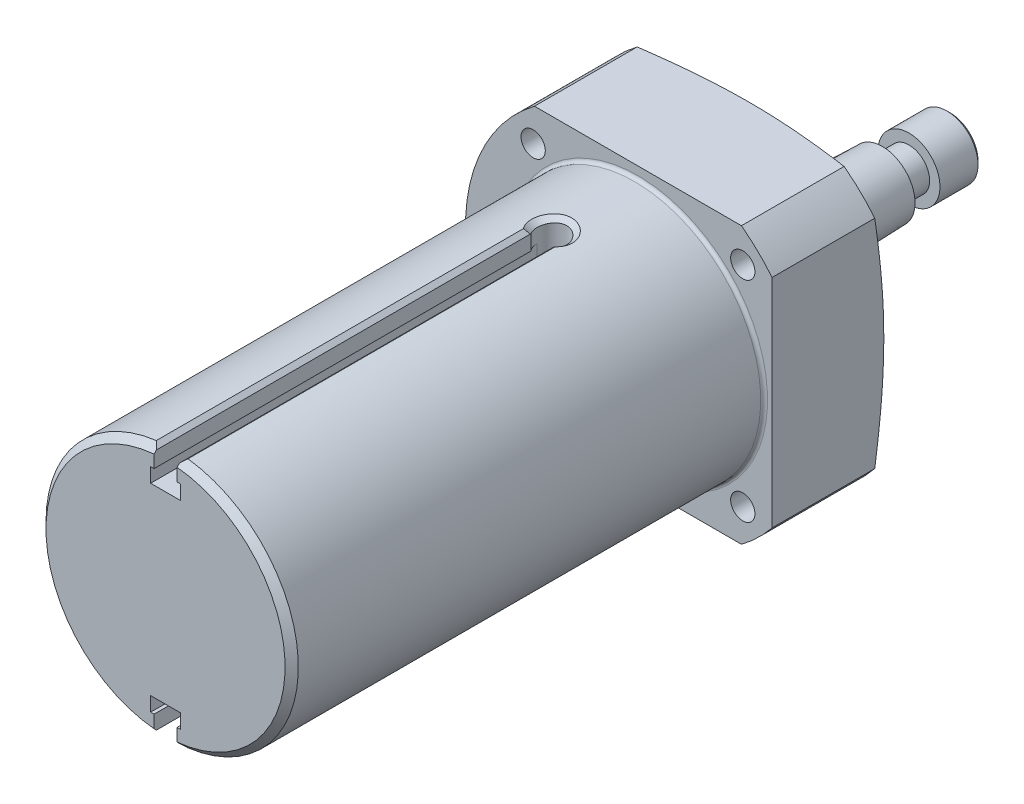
ISO-10303-21;
HEADER;
FILE_DESCRIPTION(('STEP AP214'),'2;1');
FILE_NAME('part.step','',(''),(''),'','','');
FILE_SCHEMA(('AUTOMOTIVE_DESIGN { 1 0 10303 214 1 1 1 1 }'));
ENDSEC;
DATA;
#1=APPLICATION_CONTEXT('core data for automotive mechanical design processes');
#2=APPLICATION_PROTOCOL_DEFINITION('international standard','automotive_design',2000,#1);
#3=PRODUCT_CONTEXT('',#1,'mechanical');
#4=PRODUCT('Part','Part','',(#3));
#5=PRODUCT_RELATED_PRODUCT_CATEGORY('part','',(#4));
#6=PRODUCT_DEFINITION_FORMATION('','',#4);
#7=PRODUCT_DEFINITION_CONTEXT('part definition',#1,'design');
#8=PRODUCT_DEFINITION('design','',#6,#7);
#9=PRODUCT_DEFINITION_SHAPE('','',#8);
#10=(LENGTH_UNIT() NAMED_UNIT(*) SI_UNIT(.MILLI.,.METRE.));
#11=(NAMED_UNIT(*) PLANE_ANGLE_UNIT() SI_UNIT($,.RADIAN.));
#12=(NAMED_UNIT(*) SI_UNIT($,.STERADIAN.) SOLID_ANGLE_UNIT());
#13=UNCERTAINTY_MEASURE_WITH_UNIT(LENGTH_MEASURE(1.E-05),#10,'distance_accuracy_value','');
#14=(GEOMETRIC_REPRESENTATION_CONTEXT(3) GLOBAL_UNCERTAINTY_ASSIGNED_CONTEXT((#13)) GLOBAL_UNIT_ASSIGNED_CONTEXT((#10,
#11,#12)) REPRESENTATION_CONTEXT('',''));
#15=CARTESIAN_POINT('',(0.,0.,0.));
#16=DIRECTION('',(0.,0.,1.));
#17=DIRECTION('',(1.,0.,0.));
#18=AXIS2_PLACEMENT_3D('',#15,#16,#17);
#19=CARTESIAN_POINT('',(7.52475,0.,-26.0128576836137));
#20=DIRECTION('',(0.,0.,1.));
#21=DIRECTION('',(1.,0.,0.));
#22=AXIS2_PLACEMENT_3D('',#19,#20,#21);
#23=PLANE('',#22);
#24=CARTESIAN_POINT('',(0.,0.,-26.0128576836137));
#25=DIRECTION('',(0.,0.,-1.));
#26=DIRECTION('',(-1.,0.,0.));
#27=AXIS2_PLACEMENT_3D('',#24,#25,#26);
#28=CIRCLE('',#27,7.52475);
#29=CARTESIAN_POINT('',(-7.52475,0.,-26.0128576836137));
#30=VERTEX_POINT('',#29);
#31=EDGE_CURVE('E732',#30,#30,#28,.T.);
#32=ORIENTED_EDGE('',*,*,#31,.T.);
#33=EDGE_LOOP('',(#32));
#34=FACE_BOUND('',#33,.T.);
#35=CARTESIAN_POINT('',(0.,0.,-26.0128576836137));
#36=DIRECTION('',(0.,0.,1.));
#37=DIRECTION('',(1.,0.,0.));
#38=AXIS2_PLACEMENT_3D('',#35,#36,#37);
#39=CIRCLE('',#38,4.7625);
#40=CARTESIAN_POINT('',(4.7625,0.,-26.0128576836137));
#41=VERTEX_POINT('',#40);
#42=EDGE_CURVE('E1393',#41,#41,#39,.F.);
#43=ORIENTED_EDGE('',*,*,#42,.F.);
#44=EDGE_LOOP('',(#43));
#45=FACE_BOUND('',#44,.T.);
#46=ADVANCED_FACE('F37',(#34,#45),#23,.F.);
#47=CARTESIAN_POINT('',(0.,0.,0.));
#48=DIRECTION('',(0.,0.,1.));
#49=DIRECTION('',(1.,0.,0.));
#50=AXIS2_PLACEMENT_3D('',#47,#48,#49);
#51=PLANE('',#50);
#52=CARTESIAN_POINT('',(0.,0.,0.));
#53=DIRECTION('',(0.,0.,-1.));
#54=DIRECTION('',(-1.,0.,0.));
#55=AXIS2_PLACEMENT_3D('',#52,#53,#54);
#56=CIRCLE('',#55,11.7475);
#57=CARTESIAN_POINT('',(-11.7475,0.,0.));
#58=VERTEX_POINT('',#57);
#59=EDGE_CURVE('E738',#58,#58,#56,.T.);
#60=ORIENTED_EDGE('',*,*,#59,.T.);
#61=EDGE_LOOP('',(#60));
#62=FACE_BOUND('',#61,.T.);
#63=CARTESIAN_POINT('',(0.,0.,0.));
#64=DIRECTION('',(0.,0.,1.));
#65=DIRECTION('',(1.,0.,0.));
#66=AXIS2_PLACEMENT_3D('',#63,#64,#65);
#67=CIRCLE('',#66,7.93115);
#68=CARTESIAN_POINT('',(7.93115,0.,0.));
#69=VERTEX_POINT('',#68);
#70=EDGE_CURVE('E675',#69,#69,#67,.F.);
#71=ORIENTED_EDGE('',*,*,#70,.F.);
#72=EDGE_LOOP('',(#71));
#73=FACE_BOUND('',#72,.T.);
#74=ADVANCED_FACE('F598',(#62,#73),#51,.F.);
#75=CARTESIAN_POINT('',(0.,0.,138.938));
#76=DIRECTION('',(0.,0.,-1.));
#77=DIRECTION('',(-1.,0.,0.));
#78=AXIS2_PLACEMENT_3D('',#75,#76,#77);
#79=CYLINDRICAL_SURFACE('',#78,39.6875);
#80=CARTESIAN_POINT('',(-37.5308716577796,-12.9047018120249,22.3012));
#81=CARTESIAN_POINT('',(-37.530869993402,-12.9047121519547,22.5344911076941));
#82=CARTESIAN_POINT('',(-37.5244561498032,-12.9234069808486,22.7679349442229));
#83=CARTESIAN_POINT('',(-37.4988112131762,-12.9976265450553,23.2283458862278));
#84=CARTESIAN_POINT('',(-37.4795661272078,-13.0531914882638,23.4553056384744));
#85=CARTESIAN_POINT('',(-37.4283612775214,-13.1992948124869,23.8960145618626));
#86=CARTESIAN_POINT('',(-37.3964093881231,-13.2898115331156,24.1097718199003));
#87=CARTESIAN_POINT('',(-37.3200046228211,-13.5028759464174,24.5181719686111));
#88=CARTESIAN_POINT('',(-37.2755541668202,-13.6254174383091,24.712818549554));
#89=CARTESIAN_POINT('',(-37.1743468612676,-13.8991690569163,25.0782938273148));
#90=CARTESIAN_POINT('',(-37.117546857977,-14.0504794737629,25.249035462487));
#91=CARTESIAN_POINT('',(-36.992372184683,-14.3768053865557,25.5611039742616));
#92=CARTESIAN_POINT('',(-36.9239969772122,-14.5518219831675,25.7024294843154));
#93=CARTESIAN_POINT('',(-36.7764993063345,-14.920664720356,25.9519573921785));
#94=CARTESIAN_POINT('',(-36.6973523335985,-15.1145334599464,26.0600823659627));
#95=CARTESIAN_POINT('',(-36.5298896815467,-15.5148911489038,26.2396445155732));
#96=CARTESIAN_POINT('',(-36.4415742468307,-15.7213797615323,26.311082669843));
#97=CARTESIAN_POINT('',(-36.2580816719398,-16.1400491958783,26.4149869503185));
#98=CARTESIAN_POINT('',(-36.1629311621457,-16.3522060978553,26.4475964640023));
#99=CARTESIAN_POINT('',(-35.9679394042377,-16.7767561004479,26.4733615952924));
#100=CARTESIAN_POINT('',(-35.868098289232,-16.9891491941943,26.4665183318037));
#101=CARTESIAN_POINT('',(-35.6670367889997,-17.4072906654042,26.413688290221));
#102=CARTESIAN_POINT('',(-35.5658233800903,-17.6130619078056,26.3678557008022));
#103=CARTESIAN_POINT('',(-35.364854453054,-18.013186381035,26.2385883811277));
#104=CARTESIAN_POINT('',(-35.2650989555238,-18.2075394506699,26.1551531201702));
#105=CARTESIAN_POINT('',(-35.0702778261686,-18.5800317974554,25.9528807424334));
#106=CARTESIAN_POINT('',(-34.9752216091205,-18.7581390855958,25.8339756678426));
#107=CARTESIAN_POINT('',(-34.7934752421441,-19.0931431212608,25.5641883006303));
#108=CARTESIAN_POINT('',(-34.7067853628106,-19.2500391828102,25.4133049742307));
#109=CARTESIAN_POINT('',(-34.544718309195,-19.5393906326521,25.0829776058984));
#110=CARTESIAN_POINT('',(-34.4693976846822,-19.6717245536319,24.9033993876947));
#111=CARTESIAN_POINT('',(-34.3336420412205,-19.9077189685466,24.5212442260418));
#112=CARTESIAN_POINT('',(-34.2732070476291,-20.0113794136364,24.3186672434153));
#113=CARTESIAN_POINT('',(-34.1697801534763,-20.1874778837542,23.8961590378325));
#114=CARTESIAN_POINT('',(-34.1267925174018,-20.259908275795,23.6762235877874));
#115=CARTESIAN_POINT('',(-34.0601802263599,-20.3716973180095,23.2252944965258));
#116=CARTESIAN_POINT('',(-34.0365549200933,-20.4110570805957,22.9943012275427));
#117=CARTESIAN_POINT('',(-34.009797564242,-20.4556107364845,22.5289910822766));
#118=CARTESIAN_POINT('',(-34.0065684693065,-20.460966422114,22.2946952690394));
#119=CARTESIAN_POINT('',(-34.0204909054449,-20.4378088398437,21.8283974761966));
#120=CARTESIAN_POINT('',(-34.0376421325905,-20.4092960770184,21.5963954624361));
#121=CARTESIAN_POINT('',(-34.0914888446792,-20.319221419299,21.1418206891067));
#122=CARTESIAN_POINT('',(-34.1281387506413,-20.257736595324,20.9192272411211));
#123=CARTESIAN_POINT('',(-34.2193451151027,-20.1032851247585,20.4891443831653));
#124=CARTESIAN_POINT('',(-34.273902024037,-20.0103176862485,20.281655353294));
#125=CARTESIAN_POINT('',(-34.3988387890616,-19.794773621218,19.886817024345));
#126=CARTESIAN_POINT('',(-34.4692771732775,-19.6720873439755,19.6995461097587));
#127=CARTESIAN_POINT('',(-34.6229667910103,-19.4003127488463,19.35125570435));
#128=CARTESIAN_POINT('',(-34.7062183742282,-19.2512237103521,19.1902369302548));
#129=CARTESIAN_POINT('',(-34.8826187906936,-18.929718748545,18.8983722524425));
#130=CARTESIAN_POINT('',(-34.9758056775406,-18.7572123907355,18.7676489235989));
#131=CARTESIAN_POINT('',(-35.1682954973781,-18.3937727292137,18.5409302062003));
#132=CARTESIAN_POINT('',(-35.2675983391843,-18.2028397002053,18.444934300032));
#133=CARTESIAN_POINT('',(-35.4685957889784,-17.8080123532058,18.2906021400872));
#134=CARTESIAN_POINT('',(-35.5702853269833,-17.6041441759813,18.2321924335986));
#135=CARTESIAN_POINT('',(-35.772882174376,-17.1887153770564,18.1544511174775));
#136=CARTESIAN_POINT('',(-35.8737895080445,-16.9771549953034,18.1351182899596));
#137=CARTESIAN_POINT('',(-36.071293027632,-16.5533643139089,18.1360976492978));
#138=CARTESIAN_POINT('',(-36.1679075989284,-16.3411421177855,18.1562197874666));
#139=CARTESIAN_POINT('',(-36.354754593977,-15.9211283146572,18.2351386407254));
#140=CARTESIAN_POINT('',(-36.4449870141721,-15.7133367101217,18.2939353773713));
#141=CARTESIAN_POINT('',(-36.6169634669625,-15.3083011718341,18.4484804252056));
#142=CARTESIAN_POINT('',(-36.6987089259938,-15.1110554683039,18.5442225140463));
#143=CARTESIAN_POINT('',(-36.8521450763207,-14.7329137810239,18.7699204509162));
#144=CARTESIAN_POINT('',(-36.9238357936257,-14.5520177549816,18.8998762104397));
#145=CARTESIAN_POINT('',(-37.0563482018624,-14.2112053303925,19.1910238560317));
#146=CARTESIAN_POINT('',(-37.1171181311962,-14.0513897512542,19.352357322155));
#147=CARTESIAN_POINT('',(-37.226642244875,-13.758606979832,19.7013974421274));
#148=CARTESIAN_POINT('',(-37.2753935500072,-13.625646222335,19.8891103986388));
#149=CARTESIAN_POINT('',(-37.3605206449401,-13.3904774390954,20.2861573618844));
#150=CARTESIAN_POINT('',(-37.3968617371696,-13.2883557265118,20.4955498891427));
#151=CARTESIAN_POINT('',(-37.4566922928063,-13.1187659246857,20.9294599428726));
#152=CARTESIAN_POINT('',(-37.4801961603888,-13.0512590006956,21.1539601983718));
#153=CARTESIAN_POINT('',(-37.5084408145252,-12.9697966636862,21.5332940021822));
#154=CARTESIAN_POINT('',(-37.5168490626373,-12.9454236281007,21.6857077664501));
#155=CARTESIAN_POINT('',(-37.5280650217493,-12.9128728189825,21.9924587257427));
#156=CARTESIAN_POINT('',(-37.5308727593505,-12.904694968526,22.1467959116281));
#157=CARTESIAN_POINT('',(-37.5308716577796,-12.9047018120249,22.3012));
#158=B_SPLINE_CURVE_WITH_KNOTS('',3,(#80,#81,#82,#83,#84,#85,#86,#87,#88,#89,#90,#91,#92,#93,
#94,#95,#96,#97,#98,#99,#100,#101,#102,#103,#104,#105,#106,#107,#108,#109,#110,#111,#112,#113,
#114,#115,#116,#117,#118,#119,#120,#121,#122,#123,#124,#125,#126,#127,#128,#129,#130,#131,#132,
#133,#134,#135,#136,#137,#138,#139,#140,#141,#142,#143,#144,#145,#146,#147,#148,#149,#150,#151,
#152,#153,#154,#155,#156,#157),.UNSPECIFIED.,.T.,.F.,(4,2,2,2,2,2,2,2,2,2,2,2,2,2,2,2,2,2,2,2,2,
2,2,2,2,2,2,2,2,2,2,2,2,2,2,2,2,2,4),(0.,0.699309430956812,1.39938273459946,2.09902288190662,
2.79852766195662,3.50051721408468,4.20253937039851,4.90618643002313,5.60981472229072,
6.3108364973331,7.01183839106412,7.71008089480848,8.4083332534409,9.1079321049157,
9.8075535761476,10.5105477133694,11.2135430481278,11.9167101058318,12.6198535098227,
13.3196488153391,14.0194336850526,14.7175899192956,15.4157637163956,16.1165538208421,
16.8173630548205,17.5209600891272,18.2245466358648,18.9267539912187,19.6289394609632,
20.3277509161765,21.0265627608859,21.7252569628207,22.4239493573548,23.1258707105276,
23.8279600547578,24.5319965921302,25.2352415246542,25.6980827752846,26.1609218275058),.UNSPECIFIED.);
#159=CARTESIAN_POINT('',(-37.5308716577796,-12.9047018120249,22.3012));
#160=VERTEX_POINT('',#159);
#161=EDGE_CURVE('E1377',#160,#160,#158,.T.);
#162=ORIENTED_EDGE('',*,*,#161,.T.);
#163=EDGE_LOOP('',(#162));
#164=FACE_BOUND('',#163,.T.);
#165=CARTESIAN_POINT('',(-37.5308716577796,12.9047018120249,22.3012));
#166=CARTESIAN_POINT('',(-37.530869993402,12.9047121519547,22.0679088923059));
#167=CARTESIAN_POINT('',(-37.5244561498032,12.9234069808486,21.834465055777));
#168=CARTESIAN_POINT('',(-37.4988112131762,12.9976265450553,21.3740541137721));
#169=CARTESIAN_POINT('',(-37.4795661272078,13.0531914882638,21.1470943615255));
#170=CARTESIAN_POINT('',(-37.4283612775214,13.1992948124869,20.7063854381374));
#171=CARTESIAN_POINT('',(-37.3964093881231,13.2898115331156,20.4926281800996));
#172=CARTESIAN_POINT('',(-37.3200046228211,13.5028759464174,20.0842280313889));
#173=CARTESIAN_POINT('',(-37.2755541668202,13.6254174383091,19.889581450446));
#174=CARTESIAN_POINT('',(-37.1743468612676,13.8991690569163,19.5241061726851));
#175=CARTESIAN_POINT('',(-37.117546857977,14.0504794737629,19.3533645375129));
#176=CARTESIAN_POINT('',(-36.992372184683,14.3768053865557,19.0412960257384));
#177=CARTESIAN_POINT('',(-36.9239969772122,14.5518219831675,18.8999705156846));
#178=CARTESIAN_POINT('',(-36.7764993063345,14.920664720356,18.6504426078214));
#179=CARTESIAN_POINT('',(-36.6973523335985,15.1145334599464,18.5423176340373));
#180=CARTESIAN_POINT('',(-36.5298896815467,15.5148911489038,18.3627554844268));
#181=CARTESIAN_POINT('',(-36.4415742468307,15.7213797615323,18.291317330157));
#182=CARTESIAN_POINT('',(-36.2580816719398,16.1400491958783,18.1874130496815));
#183=CARTESIAN_POINT('',(-36.1629311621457,16.3522060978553,18.1548035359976));
#184=CARTESIAN_POINT('',(-35.9679394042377,16.7767561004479,18.1290384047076));
#185=CARTESIAN_POINT('',(-35.868098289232,16.9891491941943,18.1358816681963));
#186=CARTESIAN_POINT('',(-35.6670367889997,17.4072906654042,18.188711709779));
#187=CARTESIAN_POINT('',(-35.5658233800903,17.6130619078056,18.2345442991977));
#188=CARTESIAN_POINT('',(-35.364854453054,18.013186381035,18.3638116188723));
#189=CARTESIAN_POINT('',(-35.2650989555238,18.2075394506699,18.4472468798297));
#190=CARTESIAN_POINT('',(-35.0702778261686,18.5800317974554,18.6495192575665));
#191=CARTESIAN_POINT('',(-34.9752216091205,18.7581390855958,18.7684243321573));
#192=CARTESIAN_POINT('',(-34.7934752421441,19.0931431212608,19.0382116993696));
#193=CARTESIAN_POINT('',(-34.7067853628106,19.2500391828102,19.1890950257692));
#194=CARTESIAN_POINT('',(-34.544718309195,19.5393906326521,19.5194223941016));
#195=CARTESIAN_POINT('',(-34.4693976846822,19.6717245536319,19.6990006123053));
#196=CARTESIAN_POINT('',(-34.3336420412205,19.9077189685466,20.0811557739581));
#197=CARTESIAN_POINT('',(-34.2732070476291,20.0113794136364,20.2837327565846));
#198=CARTESIAN_POINT('',(-34.1697801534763,20.1874778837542,20.7062409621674));
#199=CARTESIAN_POINT('',(-34.1267925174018,20.259908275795,20.9261764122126));
#200=CARTESIAN_POINT('',(-34.0601802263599,20.3716973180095,21.3771055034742));
#201=CARTESIAN_POINT('',(-34.0365549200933,20.4110570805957,21.6080987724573));
#202=CARTESIAN_POINT('',(-34.009797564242,20.4556107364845,22.0734089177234));
#203=CARTESIAN_POINT('',(-34.0065684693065,20.460966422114,22.3077047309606));
#204=CARTESIAN_POINT('',(-34.0204909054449,20.4378088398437,22.7740025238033));
#205=CARTESIAN_POINT('',(-34.0376421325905,20.4092960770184,23.0060045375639));
#206=CARTESIAN_POINT('',(-34.0914888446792,20.319221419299,23.4605793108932));
#207=CARTESIAN_POINT('',(-34.1281387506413,20.257736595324,23.6831727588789));
#208=CARTESIAN_POINT('',(-34.2193451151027,20.1032851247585,24.1132556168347));
#209=CARTESIAN_POINT('',(-34.273902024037,20.0103176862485,24.3207446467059));
#210=CARTESIAN_POINT('',(-34.3988387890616,19.794773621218,24.715582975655));
#211=CARTESIAN_POINT('',(-34.4692771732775,19.6720873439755,24.9028538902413));
#212=CARTESIAN_POINT('',(-34.6229667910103,19.4003127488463,25.2511442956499));
#213=CARTESIAN_POINT('',(-34.7062183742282,19.2512237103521,25.4121630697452));
#214=CARTESIAN_POINT('',(-34.8826187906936,18.929718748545,25.7040277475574));
#215=CARTESIAN_POINT('',(-34.9758056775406,18.7572123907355,25.8347510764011));
#216=CARTESIAN_POINT('',(-35.1682954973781,18.3937727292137,26.0614697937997));
#217=CARTESIAN_POINT('',(-35.2675983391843,18.2028397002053,26.1574656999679));
#218=CARTESIAN_POINT('',(-35.4685957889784,17.8080123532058,26.3117978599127));
#219=CARTESIAN_POINT('',(-35.5702853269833,17.6041441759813,26.3702075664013));
#220=CARTESIAN_POINT('',(-35.772882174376,17.1887153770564,26.4479488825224));
#221=CARTESIAN_POINT('',(-35.8737895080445,16.9771549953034,26.4672817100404));
#222=CARTESIAN_POINT('',(-36.071293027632,16.5533643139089,26.4663023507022));
#223=CARTESIAN_POINT('',(-36.1679075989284,16.3411421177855,26.4461802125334));
#224=CARTESIAN_POINT('',(-36.354754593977,15.9211283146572,26.3672613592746));
#225=CARTESIAN_POINT('',(-36.4449870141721,15.7133367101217,26.3084646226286));
#226=CARTESIAN_POINT('',(-36.6169634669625,15.3083011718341,26.1539195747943));
#227=CARTESIAN_POINT('',(-36.6987089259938,15.1110554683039,26.0581774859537));
#228=CARTESIAN_POINT('',(-36.8521450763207,14.7329137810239,25.8324795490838));
#229=CARTESIAN_POINT('',(-36.9238357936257,14.5520177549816,25.7025237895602));
#230=CARTESIAN_POINT('',(-37.0563482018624,14.2112053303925,25.4113761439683));
#231=CARTESIAN_POINT('',(-37.1171181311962,14.0513897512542,25.2500426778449));
#232=CARTESIAN_POINT('',(-37.226642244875,13.758606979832,24.9010025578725));
#233=CARTESIAN_POINT('',(-37.2753935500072,13.625646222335,24.7132896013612));
#234=CARTESIAN_POINT('',(-37.3605206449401,13.3904774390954,24.3162426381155));
#235=CARTESIAN_POINT('',(-37.3968617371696,13.2883557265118,24.1068501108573));
#236=CARTESIAN_POINT('',(-37.4566922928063,13.1187659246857,23.6729400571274));
#237=CARTESIAN_POINT('',(-37.4801961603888,13.0512590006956,23.4484398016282));
#238=CARTESIAN_POINT('',(-37.5084408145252,12.9697966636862,23.0691059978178));
#239=CARTESIAN_POINT('',(-37.5168490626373,12.9454236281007,22.9166922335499));
#240=CARTESIAN_POINT('',(-37.5280650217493,12.9128728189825,22.6099412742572));
#241=CARTESIAN_POINT('',(-37.5308727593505,12.904694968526,22.4556040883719));
#242=CARTESIAN_POINT('',(-37.5308716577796,12.9047018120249,22.3012));
#243=B_SPLINE_CURVE_WITH_KNOTS('',3,(#165,#166,#167,#168,#169,#170,#171,#172,#173,#174,#175,
#176,#177,#178,#179,#180,#181,#182,#183,#184,#185,#186,#187,#188,#189,#190,#191,#192,#193,#194,
#195,#196,#197,#198,#199,#200,#201,#202,#203,#204,#205,#206,#207,#208,#209,#210,#211,#212,#213,
#214,#215,#216,#217,#218,#219,#220,#221,#222,#223,#224,#225,#226,#227,#228,#229,#230,#231,#232,
#233,#234,#235,#236,#237,#238,#239,#240,#241,#242),.UNSPECIFIED.,.T.,.F.,(4,2,2,2,2,2,2,2,2,2,2,
2,2,2,2,2,2,2,2,2,2,2,2,2,2,2,2,2,2,2,2,2,2,2,2,2,2,2,4),(0.,0.699309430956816,1.39938273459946,
2.09902288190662,2.79852766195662,3.50051721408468,4.20253937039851,4.90618643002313,
5.60981472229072,6.3108364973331,7.01183839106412,7.71008089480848,8.4083332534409,
9.1079321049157,9.8075535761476,10.5105477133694,11.2135430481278,11.9167101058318,
12.6198535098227,13.3196488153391,14.0194336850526,14.7175899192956,15.4157637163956,
16.1165538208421,16.8173630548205,17.5209600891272,18.2245466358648,18.9267539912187,
19.6289394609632,20.3277509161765,21.0265627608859,21.7252569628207,22.4239493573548,
23.1258707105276,23.8279600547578,24.5319965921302,25.2352415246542,25.6980827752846,
26.1609218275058),.UNSPECIFIED.);
#244=CARTESIAN_POINT('',(-37.5308716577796,12.9047018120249,22.3012));
#245=VERTEX_POINT('',#244);
#246=EDGE_CURVE('E1384',#245,#245,#243,.T.);
#247=ORIENTED_EDGE('',*,*,#246,.T.);
#248=EDGE_LOOP('',(#247));
#249=FACE_BOUND('',#248,.T.);
#250=DIRECTION('',(0.,0.,-1.));
#251=VECTOR('',#250,1.);
#252=CARTESIAN_POINT('',(-23.8125,31.75,138.938));
#253=LINE('',#252,#251);
#254=CARTESIAN_POINT('',(-23.8125,31.75,30.226));
#255=VERTEX_POINT('',#254);
#256=CARTESIAN_POINT('',(-23.8125,31.75,6.604));
#257=VERTEX_POINT('',#256);
#258=EDGE_CURVE('E762',#255,#257,#253,.T.);
#259=ORIENTED_EDGE('',*,*,#258,.T.);
#260=CARTESIAN_POINT('',(0.,0.,6.604));
#261=DIRECTION('',(0.,0.,-1.));
#262=DIRECTION('',(-1.,0.,0.));
#263=AXIS2_PLACEMENT_3D('',#260,#261,#262);
#264=CIRCLE('',#263,39.6875);
#265=CARTESIAN_POINT('',(-23.8125,-31.75,6.604));
#266=VERTEX_POINT('',#265);
#267=EDGE_CURVE('E618',#266,#257,#264,.T.);
#268=ORIENTED_EDGE('',*,*,#267,.F.);
#269=DIRECTION('',(0.,0.,-1.));
#270=VECTOR('',#269,1.);
#271=CARTESIAN_POINT('',(-23.8125,-31.75,138.938));
#272=LINE('',#271,#270);
#273=CARTESIAN_POINT('',(-23.8125,-31.75,30.226));
#274=VERTEX_POINT('',#273);
#275=EDGE_CURVE('E683',#274,#266,#272,.T.);
#276=ORIENTED_EDGE('',*,*,#275,.F.);
#277=CARTESIAN_POINT('',(0.,0.,30.226));
#278=DIRECTION('',(0.,0.,-1.));
#279=DIRECTION('',(-1.,0.,0.));
#280=AXIS2_PLACEMENT_3D('',#277,#278,#279);
#281=CIRCLE('',#280,39.6875);
#282=EDGE_CURVE('E775',#274,#255,#281,.T.);
#283=ORIENTED_EDGE('',*,*,#282,.T.);
#284=EDGE_LOOP('',(#259,#268,#276,#283));
#285=FACE_BOUND('',#284,.T.);
#286=ADVANCED_FACE('F423',(#164,#249,#285),#79,.T.);
#287=CARTESIAN_POINT('',(-23.8125,-31.75,138.938));
#288=DIRECTION('',(0.,1.,0.));
#289=DIRECTION('',(0.,0.,1.));
#290=AXIS2_PLACEMENT_3D('',#287,#288,#289);
#291=PLANE('',#290);
#292=ORIENTED_EDGE('',*,*,#275,.T.);
#293=CARTESIAN_POINT('',(-53.8801925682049,-31.75,12.0052846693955));
#294=CARTESIAN_POINT('',(-53.1261250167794,-31.75,11.8517305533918));
#295=CARTESIAN_POINT('',(-52.3718961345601,-31.75,11.6989690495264));
#296=CARTESIAN_POINT('',(-50.8630830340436,-31.75,11.395204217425));
#297=CARTESIAN_POINT('',(-50.1084988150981,-31.75,11.2442008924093));
#298=CARTESIAN_POINT('',(-47.8441350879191,-31.75,10.7940818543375));
#299=CARTESIAN_POINT('',(-46.3337776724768,-31.75,10.4978638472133));
#300=CARTESIAN_POINT('',(-43.3106781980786,-31.75,9.91477674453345));
#301=CARTESIAN_POINT('',(-41.797935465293,-31.75,9.6279111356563));
#302=CARTESIAN_POINT('',(-38.7702811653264,-31.75,9.06586456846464));
#303=CARTESIAN_POINT('',(-37.2553696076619,-31.75,8.79068355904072));
#304=CARTESIAN_POINT('',(-34.2313975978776,-31.75,8.25633112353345));
#305=CARTESIAN_POINT('',(-32.7223514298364,-31.75,7.99707920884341));
#306=CARTESIAN_POINT('',(-29.7012748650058,-31.75,7.49648693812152));
#307=CARTESIAN_POINT('',(-28.1892444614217,-31.75,7.2551466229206));
#308=CARTESIAN_POINT('',(-25.1615463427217,-31.75,6.79479619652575));
#309=CARTESIAN_POINT('',(-23.6458781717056,-31.75,6.57578905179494));
#310=CARTESIAN_POINT('',(-21.3695626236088,-31.75,6.26815530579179));
#311=CARTESIAN_POINT('',(-20.6103228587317,-31.75,6.16909033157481));
#312=CARTESIAN_POINT('',(-19.0908451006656,-31.75,5.97869351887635));
#313=CARTESIAN_POINT('',(-18.3306070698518,-31.75,5.88736198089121));
#314=CARTESIAN_POINT('',(-16.0341180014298,-31.75,5.62453921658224));
#315=CARTESIAN_POINT('',(-14.4963320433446,-31.75,5.46617581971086));
#316=CARTESIAN_POINT('',(-11.4170258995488,-31.75,5.19120188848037));
#317=CARTESIAN_POINT('',(-9.87550590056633,-31.75,5.07458930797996));
#318=CARTESIAN_POINT('',(-7.5615378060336,-31.75,4.93573674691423));
#319=CARTESIAN_POINT('',(-6.79014938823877,-31.75,4.8954698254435));
#320=CARTESIAN_POINT('',(-5.24682218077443,-31.75,4.82753447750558));
#321=CARTESIAN_POINT('',(-4.47488339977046,-31.75,4.79986585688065));
#322=CARTESIAN_POINT('',(-2.93065100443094,-31.75,4.75758473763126));
#323=CARTESIAN_POINT('',(-2.1583573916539,-31.75,4.74297218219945));
#324=CARTESIAN_POINT('',(-0.613629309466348,-31.75,4.72704904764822));
#325=CARTESIAN_POINT('',(0.158805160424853,-31.75,4.72573851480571));
#326=CARTESIAN_POINT('',(1.70595983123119,-31.75,4.73645915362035));
#327=CARTESIAN_POINT('',(2.4806797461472,-31.75,4.7485314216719));
#328=CARTESIAN_POINT('',(4.02979874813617,-31.75,4.78587613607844));
#329=CARTESIAN_POINT('',(4.80419783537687,-31.75,4.81114857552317));
#330=CARTESIAN_POINT('',(6.35247636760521,-31.75,4.87447555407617));
#331=CARTESIAN_POINT('',(7.12635580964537,-31.75,4.9125301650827));
#332=CARTESIAN_POINT('',(8.67342336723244,-31.75,5.00082045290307));
#333=CARTESIAN_POINT('',(9.44661147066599,-31.75,5.05105633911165));
#334=CARTESIAN_POINT('',(11.7659620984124,-31.75,5.21903046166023));
#335=CARTESIAN_POINT('',(13.3109054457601,-31.75,5.35399226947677));
#336=CARTESIAN_POINT('',(15.6252743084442,-31.75,5.58579013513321));
#337=CARTESIAN_POINT('',(16.396229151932,-31.75,5.66794940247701));
#338=CARTESIAN_POINT('',(17.9371425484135,-31.75,5.84117919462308));
#339=CARTESIAN_POINT('',(18.7071010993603,-31.75,5.93224973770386));
#340=CARTESIAN_POINT('',(21.3088521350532,-31.75,6.25379127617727));
#341=CARTESIAN_POINT('',(23.1383305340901,-31.75,6.50305948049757));
#342=CARTESIAN_POINT('',(26.7921512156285,-31.75,7.03687723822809));
#343=CARTESIAN_POINT('',(28.6164931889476,-31.75,7.32142887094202));
#344=CARTESIAN_POINT('',(32.2611158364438,-31.75,7.91759583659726));
#345=CARTESIAN_POINT('',(34.0813955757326,-31.75,8.22921684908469));
#346=CARTESIAN_POINT('',(37.7182314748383,-31.75,8.87313784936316));
#347=CARTESIAN_POINT('',(39.5347877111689,-31.75,9.20543740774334));
#348=CARTESIAN_POINT('',(43.1661436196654,-31.75,9.88622456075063));
#349=CARTESIAN_POINT('',(44.9809412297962,-31.75,10.2347231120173));
#350=CARTESIAN_POINT('',(48.6081012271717,-31.75,10.9441691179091));
#351=CARTESIAN_POINT('',(50.4204636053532,-31.75,11.305116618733));
#352=CARTESIAN_POINT('',(54.0429741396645,-31.75,12.0367783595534));
#353=CARTESIAN_POINT('',(55.8531225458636,-31.75,12.4074913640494));
#354=CARTESIAN_POINT('',(59.4717932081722,-31.75,13.1567442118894));
#355=CARTESIAN_POINT('',(61.2803154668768,-31.75,13.5352840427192));
#356=CARTESIAN_POINT('',(64.8808078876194,-31.75,14.2954706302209));
#357=CARTESIAN_POINT('',(66.6727892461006,-31.75,14.6770644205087));
#358=CARTESIAN_POINT('',(70.2556617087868,-31.75,15.4453338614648));
#359=CARTESIAN_POINT('',(72.0465528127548,-31.75,15.832009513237));
#360=CARTESIAN_POINT('',(75.6274879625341,-31.75,16.6095739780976));
#361=CARTESIAN_POINT('',(77.4175319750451,-31.75,17.0004629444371));
#362=CARTESIAN_POINT('',(80.9968514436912,-31.75,17.7857444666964));
#363=CARTESIAN_POINT('',(82.7861268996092,-31.75,18.1801370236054));
#364=CARTESIAN_POINT('',(86.3604882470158,-31.75,18.971088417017));
#365=CARTESIAN_POINT('',(88.1455754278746,-31.75,19.3676414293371));
#366=CARTESIAN_POINT('',(91.7151939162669,-31.75,20.1632419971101));
#367=CARTESIAN_POINT('',(93.499725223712,-31.75,20.5622895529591));
#368=CARTESIAN_POINT('',(97.0682249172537,-31.75,21.362496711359));
#369=CARTESIAN_POINT('',(98.8521933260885,-31.75,21.7636562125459));
#370=CARTESIAN_POINT('',(102.419712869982,-31.75,22.5678211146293));
#371=CARTESIAN_POINT('',(104.203264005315,-31.75,22.9708265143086));
#372=CARTESIAN_POINT('',(105.98663804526,-31.75,23.3746126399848));
#373=B_SPLINE_CURVE_WITH_KNOTS('',3,(#293,#294,#295,#296,#297,#298,#299,#300,#301,#302,#303,
#304,#305,#306,#307,#308,#309,#310,#311,#312,#313,#314,#315,#316,#317,#318,#319,#320,#321,#322,
#323,#324,#325,#326,#327,#328,#329,#330,#331,#332,#333,#334,#335,#336,#337,#338,#339,#340,#341,
#342,#343,#344,#345,#346,#347,#348,#349,#350,#351,#352,#353,#354,#355,#356,#357,#358,#359,#360,
#361,#362,#363,#364,#365,#366,#367,#368,#369,#370,#371,#372),.UNSPECIFIED.,.F.,.F.,(4,2,2,2,2,2,
2,2,2,2,2,2,2,2,2,2,2,2,2,2,2,2,2,2,2,2,2,2,2,2,2,2,2,2,2,2,2,2,2,4),(0.,2.30862880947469,
4.61726184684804,9.23462946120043,13.8536992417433,18.4727488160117,23.0661228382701,
27.659507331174,32.2535011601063,34.5504922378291,36.8475725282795,41.4848452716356,
46.1218907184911,48.4391197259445,50.7563130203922,53.0734962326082,55.3906875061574,
57.7150142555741,60.0393397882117,62.3636783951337,64.688056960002,69.3398320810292,
71.6657574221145,73.9916875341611,79.5303208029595,85.0692806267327,90.6094054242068,
96.1494152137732,101.693228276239,107.237061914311,112.780197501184,118.323324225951,
123.819795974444,129.316268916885,134.812942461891,140.309617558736,145.795425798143,
151.281234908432,156.766783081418,162.252327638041),.UNSPECIFIED.);
#374=CARTESIAN_POINT('',(23.8125,-31.75,6.604));
#375=VERTEX_POINT('',#374);
#376=EDGE_CURVE('E625',#266,#375,#373,.T.);
#377=ORIENTED_EDGE('',*,*,#376,.T.);
#378=DIRECTION('',(0.,0.,-1.));
#379=VECTOR('',#378,1.);
#380=CARTESIAN_POINT('',(23.8125,-31.75,138.938));
#381=LINE('',#380,#379);
#382=CARTESIAN_POINT('',(23.8125,-31.75,30.226));
#383=VERTEX_POINT('',#382);
#384=EDGE_CURVE('E760',#383,#375,#381,.T.);
#385=ORIENTED_EDGE('',*,*,#384,.F.);
#386=DIRECTION('',(-1.,0.,0.));
#387=VECTOR('',#386,1.);
#388=CARTESIAN_POINT('',(-23.8125,-31.75,30.226));
#389=LINE('',#388,#387);
#390=EDGE_CURVE('E771',#383,#274,#389,.T.);
#391=ORIENTED_EDGE('',*,*,#390,.T.);
#392=EDGE_LOOP('',(#292,#377,#385,#391));
#393=FACE_BOUND('',#392,.T.);
#394=ADVANCED_FACE('F637',(#393),#291,.F.);
#395=CARTESIAN_POINT('',(0.,0.,138.938));
#396=DIRECTION('',(0.,0.,-1.));
#397=DIRECTION('',(-1.,0.,0.));
#398=AXIS2_PLACEMENT_3D('',#395,#396,#397);
#399=CYLINDRICAL_SURFACE('',#398,39.6875);
#400=ORIENTED_EDGE('',*,*,#384,.T.);
#401=CARTESIAN_POINT('',(30.861,-24.9538841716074,6.604));
#402=VERTEX_POINT('',#401);
#403=EDGE_CURVE('E741',#402,#375,#264,.T.);
#404=ORIENTED_EDGE('',*,*,#403,.F.);
#405=DIRECTION('',(0.,0.,-1.));
#406=VECTOR('',#405,1.);
#407=CARTESIAN_POINT('',(30.861,-24.9538841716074,138.938));
#408=LINE('',#407,#406);
#409=CARTESIAN_POINT('',(30.861,-24.9538841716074,30.226));
#410=VERTEX_POINT('',#409);
#411=EDGE_CURVE('E755',#410,#402,#408,.T.);
#412=ORIENTED_EDGE('',*,*,#411,.F.);
#413=EDGE_CURVE('E780',#410,#383,#281,.T.);
#414=ORIENTED_EDGE('',*,*,#413,.T.);
#415=EDGE_LOOP('',(#400,#404,#412,#414));
#416=FACE_BOUND('',#415,.T.);
#417=ADVANCED_FACE('F634',(#416),#399,.T.);
#418=CARTESIAN_POINT('',(30.861,24.9538841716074,138.938));
#419=DIRECTION('',(-1.,0.,0.));
#420=DIRECTION('',(0.,0.,1.));
#421=AXIS2_PLACEMENT_3D('',#418,#419,#420);
#422=PLANE('',#421);
#423=ORIENTED_EDGE('',*,*,#411,.T.);
#424=CARTESIAN_POINT('',(30.861,-54.3532406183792,11.9968511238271));
#425=CARTESIAN_POINT('',(30.861,-53.6068648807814,11.8434412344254));
#426=CARTESIAN_POINT('',(30.861,-52.8603382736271,11.6907656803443));
#427=CARTESIAN_POINT('',(30.861,-51.3669525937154,11.3870433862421));
#428=CARTESIAN_POINT('',(30.861,-50.6200935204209,11.235996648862));
#429=CARTESIAN_POINT('',(30.861,-48.3789463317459,10.7855348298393));
#430=CARTESIAN_POINT('',(30.861,-46.884117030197,10.4888040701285));
#431=CARTESIAN_POINT('',(30.861,-43.8923851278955,9.90403466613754));
#432=CARTESIAN_POINT('',(30.861,-42.3954821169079,9.61599811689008));
#433=CARTESIAN_POINT('',(30.861,-39.399632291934,9.05075677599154));
#434=CARTESIAN_POINT('',(30.861,-37.9006854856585,8.77355194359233));
#435=CARTESIAN_POINT('',(30.861,-34.9082391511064,8.234045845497));
#436=CARTESIAN_POINT('',(30.861,-33.4147524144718,7.97167388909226));
#437=CARTESIAN_POINT('',(30.861,-30.4249262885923,7.46361400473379));
#438=CARTESIAN_POINT('',(30.861,-28.9285868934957,7.2179261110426));
#439=CARTESIAN_POINT('',(30.861,-25.9322843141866,6.74742481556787));
#440=CARTESIAN_POINT('',(30.861,-24.4323204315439,6.52261583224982));
#441=CARTESIAN_POINT('',(30.861,-21.4286572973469,6.09919241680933));
#442=CARTESIAN_POINT('',(30.861,-19.9249580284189,5.90057810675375));
#443=CARTESIAN_POINT('',(30.861,-16.8992283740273,5.5340537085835));
#444=CARTESIAN_POINT('',(30.861,-15.3771599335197,5.36645451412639));
#445=CARTESIAN_POINT('',(30.861,-12.3290585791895,5.07143494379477));
#446=CARTESIAN_POINT('',(30.861,-10.8030257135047,4.94401408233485));
#447=CARTESIAN_POINT('',(30.861,-8.51212851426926,4.7881448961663));
#448=CARTESIAN_POINT('',(30.861,-7.74844230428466,4.74207497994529));
#449=CARTESIAN_POINT('',(30.861,-6.22042631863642,4.66235482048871));
#450=CARTESIAN_POINT('',(30.861,-5.45609655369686,4.62870437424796));
#451=CARTESIAN_POINT('',(30.861,-3.92697886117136,4.57438353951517));
#452=CARTESIAN_POINT('',(30.861,-3.16219093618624,4.5537130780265));
#453=CARTESIAN_POINT('',(30.861,-1.63236941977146,4.52570921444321));
#454=CARTESIAN_POINT('',(30.861,-0.867335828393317,4.51837580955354));
#455=CARTESIAN_POINT('',(30.861,0.665118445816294,4.51717520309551));
#456=CARTESIAN_POINT('',(30.861,1.43253916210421,4.52334990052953));
#457=CARTESIAN_POINT('',(30.861,2.96715315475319,4.54914011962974));
#458=CARTESIAN_POINT('',(30.861,3.73434643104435,4.5687556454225));
#459=CARTESIAN_POINT('',(30.861,5.26829556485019,4.62108569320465));
#460=CARTESIAN_POINT('',(30.861,6.03505141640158,4.653800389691));
#461=CARTESIAN_POINT('',(30.861,7.56791552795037,4.73177696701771));
#462=CARTESIAN_POINT('',(30.861,8.33402378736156,4.77703885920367));
#463=CARTESIAN_POINT('',(30.861,10.6322850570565,4.93068635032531));
#464=CARTESIAN_POINT('',(30.861,12.1632779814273,5.0568945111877));
#465=CARTESIAN_POINT('',(30.861,14.4567267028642,5.27672629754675));
#466=CARTESIAN_POINT('',(30.861,15.2207096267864,5.3550909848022));
#467=CARTESIAN_POINT('',(30.861,16.7476757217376,5.52108456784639));
#468=CARTESIAN_POINT('',(30.861,17.5106588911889,5.60871347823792));
#469=CARTESIAN_POINT('',(30.861,19.2314688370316,5.81594230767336));
#470=CARTESIAN_POINT('',(30.861,20.1890020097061,5.93797268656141));
#471=CARTESIAN_POINT('',(30.861,22.1025270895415,6.19362206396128));
#472=CARTESIAN_POINT('',(30.861,23.0585189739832,6.32724123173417));
#473=CARTESIAN_POINT('',(30.861,24.9690943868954,6.60456829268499));
#474=CARTESIAN_POINT('',(30.861,25.923677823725,6.7482768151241));
#475=CARTESIAN_POINT('',(30.861,27.8314798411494,7.04443405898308));
#476=CARTESIAN_POINT('',(30.861,28.784698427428,7.19688274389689));
#477=CARTESIAN_POINT('',(30.861,30.6901390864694,7.50938744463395));
#478=CARTESIAN_POINT('',(30.861,31.6423608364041,7.66944542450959));
#479=CARTESIAN_POINT('',(30.861,33.5456794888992,7.99612459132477));
#480=CARTESIAN_POINT('',(30.861,34.4967763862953,8.16274580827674));
#481=CARTESIAN_POINT('',(30.861,37.3484851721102,8.67109941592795));
#482=CARTESIAN_POINT('',(30.861,39.2475825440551,9.02133294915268));
#483=CARTESIAN_POINT('',(30.861,43.0441979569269,9.73923283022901));
#484=CARTESIAN_POINT('',(30.861,44.9417131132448,10.1069143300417));
#485=CARTESIAN_POINT('',(30.861,48.7341496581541,10.8554373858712));
#486=CARTESIAN_POINT('',(30.861,50.6290710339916,11.236279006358));
#487=CARTESIAN_POINT('',(30.861,54.4165258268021,12.0081240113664));
#488=CARTESIAN_POINT('',(30.861,56.3090595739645,12.3991257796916));
#489=CARTESIAN_POINT('',(30.861,60.0924386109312,13.1891835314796));
#490=CARTESIAN_POINT('',(30.861,61.9832839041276,13.5882394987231));
#491=CARTESIAN_POINT('',(30.861,65.7482749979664,14.3895227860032));
#492=CARTESIAN_POINT('',(30.861,67.6224318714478,14.7916981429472));
#493=CARTESIAN_POINT('',(30.861,71.3696373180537,15.6011776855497));
#494=CARTESIAN_POINT('',(30.861,73.242685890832,16.0084818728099));
#495=CARTESIAN_POINT('',(30.861,76.9879506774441,16.8273125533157));
#496=CARTESIAN_POINT('',(30.861,78.8601668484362,17.23883924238));
#497=CARTESIAN_POINT('',(30.861,82.6038305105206,18.0653747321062));
#498=CARTESIAN_POINT('',(30.861,84.4752780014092,18.4803835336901));
#499=CARTESIAN_POINT('',(30.861,88.2131553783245,19.312340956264));
#500=CARTESIAN_POINT('',(30.861,90.0795867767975,19.7292827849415));
#501=CARTESIAN_POINT('',(30.861,93.8119011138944,20.5656146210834));
#502=CARTESIAN_POINT('',(30.861,95.6777840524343,20.9850046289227));
#503=CARTESIAN_POINT('',(30.861,99.4089742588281,21.8258415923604));
#504=CARTESIAN_POINT('',(30.861,101.274281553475,22.247288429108));
#505=CARTESIAN_POINT('',(30.861,105.004488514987,23.0919771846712));
#506=CARTESIAN_POINT('',(30.861,106.8693881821,23.5152191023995));
#507=CARTESIAN_POINT('',(30.861,108.734115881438,23.9392159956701));
#508=B_SPLINE_CURVE_WITH_KNOTS('',3,(#424,#425,#426,#427,#428,#429,#430,#431,#432,#433,#434,
#435,#436,#437,#438,#439,#440,#441,#442,#443,#444,#445,#446,#447,#448,#449,#450,#451,#452,#453,
#454,#455,#456,#457,#458,#459,#460,#461,#462,#463,#464,#465,#466,#467,#468,#469,#470,#471,#472,
#473,#474,#475,#476,#477,#478,#479,#480,#481,#482,#483,#484,#485,#486,#487,#488,#489,#490,#491,
#492,#493,#494,#495,#496,#497,#498,#499,#500,#501,#502,#503,#504,#505,#506,#507),.UNSPECIFIED.,
.F.,.F.,(4,2,2,2,2,2,2,2,2,2,2,2,2,2,2,2,2,2,2,2,2,2,2,2,2,2,2,2,2,2,2,2,2,2,2,2,2,2,2,2,2,4),
(0.,2.28593500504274,4.57187371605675,9.14383929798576,13.7168979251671,18.289939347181,
22.8389389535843,27.3879479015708,31.9379173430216,36.4879079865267,41.0812922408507,
45.6746209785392,47.9697599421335,50.2648613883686,52.5599499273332,54.8550379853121,
57.157254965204,59.4594726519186,61.7617210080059,64.0639714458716,68.6717626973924,
70.9756993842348,73.2796397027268,76.1753905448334,79.0711836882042,81.9671575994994,
84.86311941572,87.75983281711,90.656559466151,96.4498078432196,102.248182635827,108.04658583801,
113.844072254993,119.641546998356,125.392006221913,131.142467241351,136.893196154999,
142.643926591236,148.38122890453,154.118532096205,159.855507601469,165.59247963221),.UNSPECIFIED.);
#509=CARTESIAN_POINT('',(30.861,24.9538841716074,6.604));
#510=VERTEX_POINT('',#509);
#511=EDGE_CURVE('E616',#402,#510,#508,.T.);
#512=ORIENTED_EDGE('',*,*,#511,.T.);
#513=DIRECTION('',(0.,0.,-1.));
#514=VECTOR('',#513,1.);
#515=CARTESIAN_POINT('',(30.861,24.9538841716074,138.938));
#516=LINE('',#515,#514);
#517=CARTESIAN_POINT('',(30.861,24.9538841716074,30.226));
#518=VERTEX_POINT('',#517);
#519=EDGE_CURVE('E753',#518,#510,#516,.T.);
#520=ORIENTED_EDGE('',*,*,#519,.F.);
#521=DIRECTION('',(0.,-1.,0.));
#522=VECTOR('',#521,1.);
#523=CARTESIAN_POINT('',(30.861,24.9538841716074,30.226));
#524=LINE('',#523,#522);
#525=EDGE_CURVE('E777',#518,#410,#524,.T.);
#526=ORIENTED_EDGE('',*,*,#525,.T.);
#527=EDGE_LOOP('',(#423,#512,#520,#526));
#528=FACE_BOUND('',#527,.T.);
#529=ADVANCED_FACE('F630',(#528),#422,.F.);
#530=CARTESIAN_POINT('',(0.,0.,138.938));
#531=DIRECTION('',(0.,0.,-1.));
#532=DIRECTION('',(-1.,0.,0.));
#533=AXIS2_PLACEMENT_3D('',#530,#531,#532);
#534=CYLINDRICAL_SURFACE('',#533,39.6875);
#535=ORIENTED_EDGE('',*,*,#519,.T.);
#536=CARTESIAN_POINT('',(23.8125,31.75,6.604));
#537=VERTEX_POINT('',#536);
#538=EDGE_CURVE('E617',#537,#510,#264,.T.);
#539=ORIENTED_EDGE('',*,*,#538,.F.);
#540=DIRECTION('',(0.,0.,-1.));
#541=VECTOR('',#540,1.);
#542=CARTESIAN_POINT('',(23.8125,31.75,138.938));
#543=LINE('',#542,#541);
#544=CARTESIAN_POINT('',(23.8125,31.75,30.226));
#545=VERTEX_POINT('',#544);
#546=EDGE_CURVE('E758',#545,#537,#543,.T.);
#547=ORIENTED_EDGE('',*,*,#546,.F.);
#548=EDGE_CURVE('E757',#545,#518,#281,.T.);
#549=ORIENTED_EDGE('',*,*,#548,.T.);
#550=EDGE_LOOP('',(#535,#539,#547,#549));
#551=FACE_BOUND('',#550,.T.);
#552=ADVANCED_FACE('F605',(#551),#534,.T.);
#553=CARTESIAN_POINT('',(-23.8125,31.75,138.938));
#554=DIRECTION('',(0.,-1.,0.));
#555=DIRECTION('',(0.,0.,-1.));
#556=AXIS2_PLACEMENT_3D('',#553,#554,#555);
#557=PLANE('',#556);
#558=ORIENTED_EDGE('',*,*,#546,.T.);
#559=CARTESIAN_POINT('',(-53.8801925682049,31.75,12.0052846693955));
#560=CARTESIAN_POINT('',(-53.1261250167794,31.75,11.8517305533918));
#561=CARTESIAN_POINT('',(-52.3718961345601,31.75,11.6989690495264));
#562=CARTESIAN_POINT('',(-50.8630830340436,31.75,11.395204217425));
#563=CARTESIAN_POINT('',(-50.1084988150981,31.75,11.2442008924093));
#564=CARTESIAN_POINT('',(-47.8441350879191,31.75,10.7940818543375));
#565=CARTESIAN_POINT('',(-46.3337776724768,31.75,10.4978638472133));
#566=CARTESIAN_POINT('',(-43.3106781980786,31.75,9.91477674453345));
#567=CARTESIAN_POINT('',(-41.797935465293,31.75,9.6279111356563));
#568=CARTESIAN_POINT('',(-38.7702811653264,31.75,9.06586456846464));
#569=CARTESIAN_POINT('',(-37.2553696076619,31.75,8.79068355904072));
#570=CARTESIAN_POINT('',(-34.2313975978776,31.75,8.25633112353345));
#571=CARTESIAN_POINT('',(-32.7223514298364,31.75,7.99707920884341));
#572=CARTESIAN_POINT('',(-29.7012748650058,31.75,7.49648693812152));
#573=CARTESIAN_POINT('',(-28.1892444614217,31.75,7.2551466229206));
#574=CARTESIAN_POINT('',(-25.1615463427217,31.75,6.79479619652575));
#575=CARTESIAN_POINT('',(-23.6458781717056,31.75,6.57578905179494));
#576=CARTESIAN_POINT('',(-21.3695626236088,31.75,6.26815530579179));
#577=CARTESIAN_POINT('',(-20.6103228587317,31.75,6.16909033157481));
#578=CARTESIAN_POINT('',(-19.0908451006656,31.75,5.97869351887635));
#579=CARTESIAN_POINT('',(-18.3306070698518,31.75,5.88736198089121));
#580=CARTESIAN_POINT('',(-16.0341180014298,31.75,5.62453921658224));
#581=CARTESIAN_POINT('',(-14.4963320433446,31.75,5.46617581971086));
#582=CARTESIAN_POINT('',(-11.4170258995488,31.75,5.19120188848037));
#583=CARTESIAN_POINT('',(-9.87550590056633,31.75,5.07458930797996));
#584=CARTESIAN_POINT('',(-7.5615378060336,31.75,4.93573674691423));
#585=CARTESIAN_POINT('',(-6.79014938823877,31.75,4.8954698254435));
#586=CARTESIAN_POINT('',(-5.24682218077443,31.75,4.82753447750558));
#587=CARTESIAN_POINT('',(-4.47488339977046,31.75,4.79986585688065));
#588=CARTESIAN_POINT('',(-2.93065100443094,31.75,4.75758473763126));
#589=CARTESIAN_POINT('',(-2.1583573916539,31.75,4.74297218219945));
#590=CARTESIAN_POINT('',(-0.613629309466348,31.75,4.72704904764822));
#591=CARTESIAN_POINT('',(0.158805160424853,31.75,4.72573851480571));
#592=CARTESIAN_POINT('',(1.70595983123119,31.75,4.73645915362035));
#593=CARTESIAN_POINT('',(2.4806797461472,31.75,4.7485314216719));
#594=CARTESIAN_POINT('',(4.02979874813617,31.75,4.78587613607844));
#595=CARTESIAN_POINT('',(4.80419783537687,31.75,4.81114857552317));
#596=CARTESIAN_POINT('',(6.35247636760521,31.75,4.87447555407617));
#597=CARTESIAN_POINT('',(7.12635580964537,31.75,4.9125301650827));
#598=CARTESIAN_POINT('',(8.67342336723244,31.75,5.00082045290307));
#599=CARTESIAN_POINT('',(9.44661147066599,31.75,5.05105633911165));
#600=CARTESIAN_POINT('',(11.7659620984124,31.75,5.21903046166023));
#601=CARTESIAN_POINT('',(13.3109054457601,31.75,5.35399226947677));
#602=CARTESIAN_POINT('',(15.6252743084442,31.75,5.58579013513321));
#603=CARTESIAN_POINT('',(16.396229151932,31.75,5.66794940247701));
#604=CARTESIAN_POINT('',(17.9371425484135,31.75,5.84117919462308));
#605=CARTESIAN_POINT('',(18.7071010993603,31.75,5.93224973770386));
#606=CARTESIAN_POINT('',(21.3088521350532,31.75,6.25379127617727));
#607=CARTESIAN_POINT('',(23.1383305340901,31.75,6.50305948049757));
#608=CARTESIAN_POINT('',(26.7921512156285,31.75,7.03687723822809));
#609=CARTESIAN_POINT('',(28.6164931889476,31.75,7.32142887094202));
#610=CARTESIAN_POINT('',(32.2611158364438,31.75,7.91759583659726));
#611=CARTESIAN_POINT('',(34.0813955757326,31.75,8.22921684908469));
#612=CARTESIAN_POINT('',(37.7182314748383,31.75,8.87313784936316));
#613=CARTESIAN_POINT('',(39.5347877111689,31.75,9.20543740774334));
#614=CARTESIAN_POINT('',(43.1661436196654,31.75,9.88622456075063));
#615=CARTESIAN_POINT('',(44.9809412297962,31.75,10.2347231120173));
#616=CARTESIAN_POINT('',(48.6081012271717,31.75,10.9441691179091));
#617=CARTESIAN_POINT('',(50.4204636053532,31.75,11.305116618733));
#618=CARTESIAN_POINT('',(54.0429741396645,31.75,12.0367783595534));
#619=CARTESIAN_POINT('',(55.8531225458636,31.75,12.4074913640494));
#620=CARTESIAN_POINT('',(59.4717932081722,31.75,13.1567442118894));
#621=CARTESIAN_POINT('',(61.2803154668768,31.75,13.5352840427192));
#622=CARTESIAN_POINT('',(64.8808078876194,31.75,14.2954706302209));
#623=CARTESIAN_POINT('',(66.6727892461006,31.75,14.6770644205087));
#624=CARTESIAN_POINT('',(70.2556617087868,31.75,15.4453338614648));
#625=CARTESIAN_POINT('',(72.0465528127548,31.75,15.832009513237));
#626=CARTESIAN_POINT('',(75.6274879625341,31.75,16.6095739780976));
#627=CARTESIAN_POINT('',(77.4175319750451,31.75,17.0004629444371));
#628=CARTESIAN_POINT('',(80.9968514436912,31.75,17.7857444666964));
#629=CARTESIAN_POINT('',(82.7861268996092,31.75,18.1801370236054));
#630=CARTESIAN_POINT('',(86.3604882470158,31.75,18.971088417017));
#631=CARTESIAN_POINT('',(88.1455754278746,31.75,19.3676414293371));
#632=CARTESIAN_POINT('',(91.7151939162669,31.75,20.1632419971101));
#633=CARTESIAN_POINT('',(93.499725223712,31.75,20.5622895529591));
#634=CARTESIAN_POINT('',(97.0682249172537,31.75,21.362496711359));
#635=CARTESIAN_POINT('',(98.8521933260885,31.75,21.7636562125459));
#636=CARTESIAN_POINT('',(102.419712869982,31.75,22.5678211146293));
#637=CARTESIAN_POINT('',(104.203264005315,31.75,22.9708265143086));
#638=CARTESIAN_POINT('',(105.98663804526,31.75,23.3746126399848));
#639=B_SPLINE_CURVE_WITH_KNOTS('',3,(#559,#560,#561,#562,#563,#564,#565,#566,#567,#568,#569,
#570,#571,#572,#573,#574,#575,#576,#577,#578,#579,#580,#581,#582,#583,#584,#585,#586,#587,#588,
#589,#590,#591,#592,#593,#594,#595,#596,#597,#598,#599,#600,#601,#602,#603,#604,#605,#606,#607,
#608,#609,#610,#611,#612,#613,#614,#615,#616,#617,#618,#619,#620,#621,#622,#623,#624,#625,#626,
#627,#628,#629,#630,#631,#632,#633,#634,#635,#636,#637,#638),.UNSPECIFIED.,.F.,.F.,(4,2,2,2,2,2,
2,2,2,2,2,2,2,2,2,2,2,2,2,2,2,2,2,2,2,2,2,2,2,2,2,2,2,2,2,2,2,2,2,4),(0.,2.30862880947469,
4.61726184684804,9.23462946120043,13.8536992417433,18.4727488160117,23.0661228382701,
27.659507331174,32.2535011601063,34.5504922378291,36.8475725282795,41.4848452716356,
46.1218907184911,48.4391197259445,50.7563130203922,53.0734962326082,55.3906875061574,
57.7150142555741,60.0393397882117,62.3636783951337,64.688056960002,69.3398320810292,
71.6657574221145,73.9916875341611,79.5303208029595,85.0692806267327,90.6094054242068,
96.1494152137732,101.693228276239,107.237061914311,112.780197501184,118.323324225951,
123.819795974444,129.316268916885,134.812942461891,140.309617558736,145.795425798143,
151.281234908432,156.766783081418,162.252327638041),.UNSPECIFIED.);
#640=EDGE_CURVE('E609',#537,#257,#639,.F.);
#641=ORIENTED_EDGE('',*,*,#640,.T.);
#642=ORIENTED_EDGE('',*,*,#258,.F.);
#643=DIRECTION('',(1.,0.,0.));
#644=VECTOR('',#643,1.);
#645=CARTESIAN_POINT('',(-23.8125,31.75,30.226));
#646=LINE('',#645,#644);
#647=EDGE_CURVE('E678',#255,#545,#646,.T.);
#648=ORIENTED_EDGE('',*,*,#647,.T.);
#649=EDGE_LOOP('',(#558,#641,#642,#648));
#650=FACE_BOUND('',#649,.T.);
#651=ADVANCED_FACE('F593',(#650),#557,.F.);
#652=CARTESIAN_POINT('',(-39.6875,0.,30.226));
#653=DIRECTION('',(0.,0.,-1.));
#654=DIRECTION('',(-1.,0.,0.));
#655=AXIS2_PLACEMENT_3D('',#652,#653,#654);
#656=PLANE('',#655);
#657=CARTESIAN_POINT('',(0.,0.,30.226));
#658=DIRECTION('',(0.,0.,-1.));
#659=DIRECTION('',(-1.,0.,0.));
#660=AXIS2_PLACEMENT_3D('',#657,#658,#659);
#661=CIRCLE('',#660,29.8196);
#662=CARTESIAN_POINT('',(-29.8196,0.,30.226));
#663=VERTEX_POINT('',#662);
#664=EDGE_CURVE('E1516',#663,#663,#661,.T.);
#665=ORIENTED_EDGE('',*,*,#664,.T.);
#666=EDGE_LOOP('',(#665));
#667=FACE_BOUND('',#666,.T.);
#668=CARTESIAN_POINT('',(-24.1209679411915,24.1209679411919,30.226));
#669=DIRECTION('',(0.,0.,-1.));
#670=DIRECTION('',(-1.,0.,0.));
#671=AXIS2_PLACEMENT_3D('',#668,#669,#670);
#672=CIRCLE('',#671,2.79400000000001);
#673=CARTESIAN_POINT('',(-26.9149679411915,24.1209679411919,30.226));
#674=VERTEX_POINT('',#673);
#675=EDGE_CURVE('E1567',#674,#674,#672,.T.);
#676=ORIENTED_EDGE('',*,*,#675,.T.);
#677=EDGE_LOOP('',(#676));
#678=FACE_BOUND('',#677,.T.);
#679=CARTESIAN_POINT('',(-24.1209679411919,-24.1209679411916,30.226));
#680=DIRECTION('',(0.,0.,-1.));
#681=DIRECTION('',(-1.,0.,0.));
#682=AXIS2_PLACEMENT_3D('',#679,#680,#681);
#683=CIRCLE('',#682,2.79400000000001);
#684=CARTESIAN_POINT('',(-26.9149679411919,-24.1209679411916,30.226));
#685=VERTEX_POINT('',#684);
#686=EDGE_CURVE('E1571',#685,#685,#683,.T.);
#687=ORIENTED_EDGE('',*,*,#686,.T.);
#688=EDGE_LOOP('',(#687));
#689=FACE_BOUND('',#688,.T.);
#690=CARTESIAN_POINT('',(24.1209679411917,-24.1209679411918,30.226));
#691=DIRECTION('',(0.,0.,-1.));
#692=DIRECTION('',(-1.,0.,0.));
#693=AXIS2_PLACEMENT_3D('',#690,#691,#692);
#694=CIRCLE('',#693,2.79400000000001);
#695=CARTESIAN_POINT('',(21.3269679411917,-24.1209679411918,30.226));
#696=VERTEX_POINT('',#695);
#697=EDGE_CURVE('E1575',#696,#696,#694,.T.);
#698=ORIENTED_EDGE('',*,*,#697,.T.);
#699=EDGE_LOOP('',(#698));
#700=FACE_BOUND('',#699,.T.);
#701=CARTESIAN_POINT('',(24.1209679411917,24.1209679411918,30.226));
#702=DIRECTION('',(0.,0.,-1.));
#703=DIRECTION('',(-1.,0.,0.));
#704=AXIS2_PLACEMENT_3D('',#701,#702,#703);
#705=CIRCLE('',#704,2.79400000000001);
#706=CARTESIAN_POINT('',(21.3269679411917,24.1209679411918,30.226));
#707=VERTEX_POINT('',#706);
#708=EDGE_CURVE('E694',#707,#707,#705,.T.);
#709=ORIENTED_EDGE('',*,*,#708,.T.);
#710=EDGE_LOOP('',(#709));
#711=FACE_BOUND('',#710,.T.);
#712=ORIENTED_EDGE('',*,*,#413,.F.);
#713=ORIENTED_EDGE('',*,*,#525,.F.);
#714=ORIENTED_EDGE('',*,*,#548,.F.);
#715=ORIENTED_EDGE('',*,*,#647,.F.);
#716=ORIENTED_EDGE('',*,*,#282,.F.);
#717=ORIENTED_EDGE('',*,*,#390,.F.);
#718=EDGE_LOOP('',(#712,#713,#714,#715,#716,#717));
#719=FACE_BOUND('',#718,.T.);
#720=ADVANCED_FACE('F585',(#667,#678,#689,#700,#711,#719),#656,.F.);
#721=CARTESIAN_POINT('',(0.,0.,0.));
#722=DIRECTION('',(0.,0.,-1.));
#723=DIRECTION('',(-1.,0.,0.));
#724=AXIS2_PLACEMENT_3D('',#721,#722,#723);
#725=CYLINDRICAL_SURFACE('',#724,29.0322);
#726=CARTESIAN_POINT('',(0.,0.,31.0134));
#727=DIRECTION('',(0.,0.,-1.));
#728=DIRECTION('',(-1.,0.,0.));
#729=AXIS2_PLACEMENT_3D('',#726,#727,#728);
#730=CIRCLE('',#729,29.0322);
#731=CARTESIAN_POINT('',(-29.0322,0.,31.0134));
#732=VERTEX_POINT('',#731);
#733=EDGE_CURVE('E1518',#732,#732,#730,.F.);
#734=ORIENTED_EDGE('',*,*,#733,.T.);
#735=EDGE_LOOP('',(#734));
#736=FACE_BOUND('',#735,.T.);
#737=CARTESIAN_POINT('',(0.,0.,137.414));
#738=DIRECTION('',(0.,0.,1.));
#739=DIRECTION('',(1.,0.,0.));
#740=AXIS2_PLACEMENT_3D('',#737,#738,#739);
#741=CIRCLE('',#740,29.0322);
#742=CARTESIAN_POINT('',(3.64017631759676,28.803085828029,137.414));
#743=VERTEX_POINT('',#742);
#744=CARTESIAN_POINT('',(3.64017631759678,-28.803085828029,137.414));
#745=VERTEX_POINT('',#744);
#746=EDGE_CURVE('E1396',#743,#745,#741,.F.);
#747=ORIENTED_EDGE('',*,*,#746,.T.);
#748=DIRECTION('',(0.,0.,-1.));
#749=VECTOR('',#748,1.);
#750=CARTESIAN_POINT('',(3.64017631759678,-28.803085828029,0.));
#751=LINE('',#750,#749);
#752=CARTESIAN_POINT('',(3.64016741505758,-28.8031985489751,68.6745207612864));
#753=VERTEX_POINT('',#752);
#754=EDGE_CURVE('E573',#745,#753,#751,.T.);
#755=ORIENTED_EDGE('',*,*,#754,.T.);
#756=CARTESIAN_POINT('',(-2.80668490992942,-28.8962135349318,69.4410302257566));
#757=CARTESIAN_POINT('',(-3.59874200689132,-28.8191613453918,68.8766006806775));
#758=CARTESIAN_POINT('',(-4.19186285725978,-28.7299441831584,68.0691784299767));
#759=CARTESIAN_POINT('',(-4.78886914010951,-28.6357337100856,66.2577764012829));
#760=CARTESIAN_POINT('',(-4.78222599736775,-28.6369136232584,65.2610081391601));
#761=CARTESIAN_POINT('',(-4.16509209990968,-28.7339853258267,63.4564096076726));
#762=CARTESIAN_POINT('',(-3.55804342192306,-28.8238555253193,62.6560048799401));
#763=CARTESIAN_POINT('',(-1.96691942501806,-28.9770902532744,61.5433674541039));
#764=CARTESIAN_POINT('',(-0.984300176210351,-29.0319875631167,61.2366338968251));
#765=CARTESIAN_POINT('',(0.980916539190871,-29.0324123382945,61.2340862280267));
#766=CARTESIAN_POINT('',(1.96959594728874,-28.9770090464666,61.5438571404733));
#767=CARTESIAN_POINT('',(3.55503013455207,-28.8239689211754,62.6552797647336));
#768=CARTESIAN_POINT('',(4.16525153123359,-28.7339757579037,63.4560704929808));
#769=CARTESIAN_POINT('',(4.7821273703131,-28.6369137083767,65.2615250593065));
#770=CARTESIAN_POINT('',(4.78857438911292,-28.6357725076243,66.2583128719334));
#771=CARTESIAN_POINT('',(4.19205769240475,-28.7299210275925,68.0689458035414));
#772=CARTESIAN_POINT('',(3.59843482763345,-28.8191859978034,68.8767774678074));
#773=CARTESIAN_POINT('',(2.80735641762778,-28.8961483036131,69.4405490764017));
#774=B_SPLINE_CURVE_WITH_KNOTS('',3,(#756,#757,#758,#759,#760,#761,#762,#763,#764,#765,#766,
#767,#768,#769,#770,#771,#772,#773),.UNSPECIFIED.,.F.,.F.,(4,2,2,2,2,2,2,2,4),
(0.00444823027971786,0.00728599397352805,0.0101237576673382,0.0129615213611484,
0.0157992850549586,0.0186370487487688,0.021474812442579,0.0243125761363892,0.0271503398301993),.UNSPECIFIED.);
#775=CARTESIAN_POINT('',(-3.64014857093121,-28.8031804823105,68.6745130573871));
#776=VERTEX_POINT('',#775);
#777=EDGE_CURVE('E555',#753,#776,#774,.F.);
#778=ORIENTED_EDGE('',*,*,#777,.T.);
#779=DIRECTION('',(0.,0.,-1.));
#780=VECTOR('',#779,1.);
#781=CARTESIAN_POINT('',(-3.64017631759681,-28.803085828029,0.));
#782=LINE('',#781,#780);
#783=CARTESIAN_POINT('',(-3.6401763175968,-28.803085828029,137.414));
#784=VERTEX_POINT('',#783);
#785=EDGE_CURVE('E553',#776,#784,#782,.F.);
#786=ORIENTED_EDGE('',*,*,#785,.T.);
#787=CARTESIAN_POINT('',(0.,0.,137.414));
#788=DIRECTION('',(0.,0.,1.));
#789=DIRECTION('',(1.,0.,0.));
#790=AXIS2_PLACEMENT_3D('',#787,#788,#789);
#791=CIRCLE('',#790,29.0322);
#792=CARTESIAN_POINT('',(-3.64017631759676,28.803085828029,137.414));
#793=VERTEX_POINT('',#792);
#794=EDGE_CURVE('E551',#784,#793,#791,.F.);
#795=ORIENTED_EDGE('',*,*,#794,.T.);
#796=DIRECTION('',(0.,0.,-1.));
#797=VECTOR('',#796,1.);
#798=CARTESIAN_POINT('',(-3.64017631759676,28.803085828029,0.));
#799=LINE('',#798,#797);
#800=CARTESIAN_POINT('',(-3.64010357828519,28.8032671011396,52.9262145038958));
#801=VERTEX_POINT('',#800);
#802=EDGE_CURVE('E544',#793,#801,#799,.T.);
#803=ORIENTED_EDGE('',*,*,#802,.T.);
#804=CARTESIAN_POINT('',(2.8094848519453,28.8959414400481,53.6910230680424));
#805=CARTESIAN_POINT('',(3.59597304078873,28.8193750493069,53.1286717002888));
#806=CARTESIAN_POINT('',(4.19417954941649,28.7296488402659,52.318108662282));
#807=CARTESIAN_POINT('',(4.7885144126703,28.6357218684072,50.5068736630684));
#808=CARTESIAN_POINT('',(4.78200160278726,28.636922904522,49.5110905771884));
#809=CARTESIAN_POINT('',(4.16454920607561,28.7340957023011,47.7080832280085));
#810=CARTESIAN_POINT('',(3.55775501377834,28.8238121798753,46.9083760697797));
#811=CARTESIAN_POINT('',(1.96769599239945,28.9770869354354,45.7953370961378));
#812=CARTESIAN_POINT('',(0.987210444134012,29.0320080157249,45.4886443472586));
#813=CARTESIAN_POINT('',(-0.982435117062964,29.0323917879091,45.4860759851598));
#814=CARTESIAN_POINT('',(-1.96896444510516,28.977011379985,45.7962441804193));
#815=CARTESIAN_POINT('',(-3.55571676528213,28.8239613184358,46.9069307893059));
#816=CARTESIAN_POINT('',(-4.1642354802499,28.7340880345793,47.7080492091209));
#817=CARTESIAN_POINT('',(-4.78293787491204,28.6368334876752,49.5129440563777));
#818=CARTESIAN_POINT('',(-4.78830519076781,28.635804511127,50.5100026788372));
#819=CARTESIAN_POINT('',(-4.19225244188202,28.7299006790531,52.3214836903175));
#820=CARTESIAN_POINT('',(-3.5970518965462,28.8193204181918,53.1291278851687));
#821=CARTESIAN_POINT('',(-2.8057040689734,28.8963087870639,53.6937329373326));
#822=B_SPLINE_CURVE_WITH_KNOTS('',3,(#804,#805,#806,#807,#808,#809,#810,#811,#812,#813,#814,
#815,#816,#817,#818,#819,#820,#821),.UNSPECIFIED.,.F.,.F.,(4,2,2,2,2,2,2,2,4),
(0.00393393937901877,0.00677210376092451,0.00961026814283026,0.012448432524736,
0.0152865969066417,0.0181247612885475,0.0209629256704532,0.023801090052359,0.0266392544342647),.UNSPECIFIED.);
#823=CARTESIAN_POINT('',(3.6397720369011,28.8031684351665,52.9255938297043));
#824=VERTEX_POINT('',#823);
#825=EDGE_CURVE('E540',#801,#824,#822,.F.);
#826=ORIENTED_EDGE('',*,*,#825,.T.);
#827=DIRECTION('',(0.,0.,-1.));
#828=VECTOR('',#827,1.);
#829=CARTESIAN_POINT('',(3.64017631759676,28.803085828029,0.));
#830=LINE('',#829,#828);
#831=EDGE_CURVE('E545',#824,#743,#830,.F.);
#832=ORIENTED_EDGE('',*,*,#831,.T.);
#833=EDGE_LOOP('',(#747,#755,#778,#786,#795,#803,#826,#832));
#834=FACE_BOUND('',#833,.T.);
#835=ADVANCED_FACE('F549',(#736,#834),#725,.T.);
#836=CARTESIAN_POINT('',(0.,0.,138.938));
#837=DIRECTION('',(0.,0.,1.));
#838=DIRECTION('',(1.,0.,0.));
#839=AXIS2_PLACEMENT_3D('',#836,#837,#838);
#840=PLANE('',#839);
#841=DIRECTION('',(0.,-1.,0.));
#842=VECTOR('',#841,1.);
#843=CARTESIAN_POINT('',(-2.64159999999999,0.,138.938));
#844=LINE('',#843,#842);
#845=CARTESIAN_POINT('',(-2.6416,27.3810704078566,138.938));
#846=VERTEX_POINT('',#845);
#847=CARTESIAN_POINT('',(-2.6416,24.4602,138.938));
#848=VERTEX_POINT('',#847);
#849=EDGE_CURVE('E677',#846,#848,#844,.T.);
#850=ORIENTED_EDGE('',*,*,#849,.F.);
#851=CARTESIAN_POINT('',(0.,0.,138.938));
#852=DIRECTION('',(0.,0.,1.));
#853=DIRECTION('',(1.,0.,0.));
#854=AXIS2_PLACEMENT_3D('',#851,#852,#853);
#855=CIRCLE('',#854,27.5082);
#856=CARTESIAN_POINT('',(-2.6416,-27.3810704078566,138.938));
#857=VERTEX_POINT('',#856);
#858=EDGE_CURVE('E411',#846,#857,#855,.T.);
#859=ORIENTED_EDGE('',*,*,#858,.T.);
#860=DIRECTION('',(0.,-1.,0.));
#861=VECTOR('',#860,1.);
#862=CARTESIAN_POINT('',(-2.6416,-24.4602,138.938));
#863=LINE('',#862,#861);
#864=CARTESIAN_POINT('',(-2.6416,-24.4602,138.938));
#865=VERTEX_POINT('',#864);
#866=EDGE_CURVE('E1408',#865,#857,#863,.T.);
#867=ORIENTED_EDGE('',*,*,#866,.F.);
#868=DIRECTION('',(1.,0.,0.));
#869=VECTOR('',#868,1.);
#870=CARTESIAN_POINT('',(-3.42899999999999,-24.4602,138.938));
#871=LINE('',#870,#869);
#872=CARTESIAN_POINT('',(-3.42899999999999,-24.4602,138.938));
#873=VERTEX_POINT('',#872);
#874=EDGE_CURVE('E1416',#873,#865,#871,.T.);
#875=ORIENTED_EDGE('',*,*,#874,.F.);
#876=DIRECTION('',(0.,-1.,0.));
#877=VECTOR('',#876,1.);
#878=CARTESIAN_POINT('',(-3.42899999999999,-21.1582,138.938));
#879=LINE('',#878,#877);
#880=CARTESIAN_POINT('',(-3.42899999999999,-21.1582,138.938));
#881=VERTEX_POINT('',#880);
#882=EDGE_CURVE('E1664',#881,#873,#879,.T.);
#883=ORIENTED_EDGE('',*,*,#882,.F.);
#884=DIRECTION('',(-1.,0.,0.));
#885=VECTOR('',#884,1.);
#886=CARTESIAN_POINT('',(-3.42899999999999,-21.1582,138.938));
#887=LINE('',#886,#885);
#888=CARTESIAN_POINT('',(3.429,-21.1582,138.938));
#889=VERTEX_POINT('',#888);
#890=EDGE_CURVE('E1667',#889,#881,#887,.T.);
#891=ORIENTED_EDGE('',*,*,#890,.F.);
#892=DIRECTION('',(0.,1.,0.));
#893=VECTOR('',#892,1.);
#894=CARTESIAN_POINT('',(3.429,-21.1582,138.938));
#895=LINE('',#894,#893);
#896=CARTESIAN_POINT('',(3.429,-24.4602,138.938));
#897=VERTEX_POINT('',#896);
#898=EDGE_CURVE('E1670',#897,#889,#895,.T.);
#899=ORIENTED_EDGE('',*,*,#898,.F.);
#900=DIRECTION('',(1.,0.,0.));
#901=VECTOR('',#900,1.);
#902=CARTESIAN_POINT('',(3.429,-24.4602,138.938));
#903=LINE('',#902,#901);
#904=CARTESIAN_POINT('',(2.64160000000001,-24.4602,138.938));
#905=VERTEX_POINT('',#904);
#906=EDGE_CURVE('E1415',#905,#897,#903,.T.);
#907=ORIENTED_EDGE('',*,*,#906,.F.);
#908=DIRECTION('',(0.,1.,0.));
#909=VECTOR('',#908,1.);
#910=CARTESIAN_POINT('',(2.64160000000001,0.,138.938));
#911=LINE('',#910,#909);
#912=CARTESIAN_POINT('',(2.64160000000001,-27.3810704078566,138.938));
#913=VERTEX_POINT('',#912);
#914=EDGE_CURVE('E680',#913,#905,#911,.T.);
#915=ORIENTED_EDGE('',*,*,#914,.F.);
#916=CARTESIAN_POINT('',(0.,0.,138.938));
#917=DIRECTION('',(0.,0.,1.));
#918=DIRECTION('',(1.,0.,0.));
#919=AXIS2_PLACEMENT_3D('',#916,#917,#918);
#920=CIRCLE('',#919,27.5082);
#921=CARTESIAN_POINT('',(2.6416,27.3810704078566,138.938));
#922=VERTEX_POINT('',#921);
#923=EDGE_CURVE('E1397',#913,#922,#920,.T.);
#924=ORIENTED_EDGE('',*,*,#923,.T.);
#925=DIRECTION('',(0.,1.,0.));
#926=VECTOR('',#925,1.);
#927=CARTESIAN_POINT('',(2.6416,50.8,138.938));
#928=LINE('',#927,#926);
#929=CARTESIAN_POINT('',(2.6416,24.4602,138.938));
#930=VERTEX_POINT('',#929);
#931=EDGE_CURVE('E1627',#930,#922,#928,.T.);
#932=ORIENTED_EDGE('',*,*,#931,.F.);
#933=DIRECTION('',(-1.,0.,0.));
#934=VECTOR('',#933,1.);
#935=CARTESIAN_POINT('',(2.6416,24.4602,138.938));
#936=LINE('',#935,#934);
#937=CARTESIAN_POINT('',(3.429,24.4602,138.938));
#938=VERTEX_POINT('',#937);
#939=EDGE_CURVE('E1630',#938,#930,#936,.T.);
#940=ORIENTED_EDGE('',*,*,#939,.F.);
#941=DIRECTION('',(0.,1.,0.));
#942=VECTOR('',#941,1.);
#943=CARTESIAN_POINT('',(3.429,24.4602,138.938));
#944=LINE('',#943,#942);
#945=CARTESIAN_POINT('',(3.429,21.1582,138.938));
#946=VERTEX_POINT('',#945);
#947=EDGE_CURVE('E1633',#946,#938,#944,.T.);
#948=ORIENTED_EDGE('',*,*,#947,.F.);
#949=DIRECTION('',(1.,0.,0.));
#950=VECTOR('',#949,1.);
#951=CARTESIAN_POINT('',(-3.429,21.1582,138.938));
#952=LINE('',#951,#950);
#953=CARTESIAN_POINT('',(-3.429,21.1582,138.938));
#954=VERTEX_POINT('',#953);
#955=EDGE_CURVE('E1636',#954,#946,#952,.T.);
#956=ORIENTED_EDGE('',*,*,#955,.F.);
#957=DIRECTION('',(0.,-1.,0.));
#958=VECTOR('',#957,1.);
#959=CARTESIAN_POINT('',(-3.429,24.4602,138.938));
#960=LINE('',#959,#958);
#961=CARTESIAN_POINT('',(-3.429,24.4602,138.938));
#962=VERTEX_POINT('',#961);
#963=EDGE_CURVE('E1639',#962,#954,#960,.T.);
#964=ORIENTED_EDGE('',*,*,#963,.F.);
#965=DIRECTION('',(-1.,0.,0.));
#966=VECTOR('',#965,1.);
#967=CARTESIAN_POINT('',(-2.6416,24.4602,138.938));
#968=LINE('',#967,#966);
#969=EDGE_CURVE('E1642',#848,#962,#968,.T.);
#970=ORIENTED_EDGE('',*,*,#969,.F.);
#971=EDGE_LOOP('',(#850,#859,#867,#875,#883,#891,#899,#907,#915,#924,#932,#940,#948,#956,#964,#970));
#972=FACE_BOUND('',#971,.T.);
#973=ADVANCED_FACE('F584',(#972),#840,.T.);
#974=CARTESIAN_POINT('',(0.,0.,6.604));
#975=DIRECTION('',(0.,0.,1.));
#976=DIRECTION('',(1.,0.,0.));
#977=AXIS2_PLACEMENT_3D('',#974,#975,#976);
#978=CONICAL_SURFACE('',#977,39.6875,1.33869248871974);
#979=CARTESIAN_POINT('',(-27.232000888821,20.5150172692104,5.28206281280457));
#980=CARTESIAN_POINT('',(-27.0248129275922,20.3362808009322,5.21752731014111));
#981=CARTESIAN_POINT('',(-26.8021015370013,20.175358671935,5.15259376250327));
#982=CARTESIAN_POINT('',(-26.3319205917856,19.8938715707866,5.0238028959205));
#983=CARTESIAN_POINT('',(-26.0844203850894,19.7733573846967,4.95994702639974));
#984=CARTESIAN_POINT('',(-25.571651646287,19.5764865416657,4.83533656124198));
#985=CARTESIAN_POINT('',(-25.30638266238,19.500131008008,4.77458204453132));
#986=CARTESIAN_POINT('',(-24.7656062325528,19.3942634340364,4.65828800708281));
#987=CARTESIAN_POINT('',(-24.4901018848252,19.3647373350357,4.60274692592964));
#988=CARTESIAN_POINT('',(-23.9400888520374,19.3540584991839,4.49963289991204));
#989=CARTESIAN_POINT('',(-23.665608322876,19.3723258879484,4.45197182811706));
#990=CARTESIAN_POINT('',(-23.122475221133,19.4562185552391,4.36584696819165));
#991=CARTESIAN_POINT('',(-22.8538218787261,19.5218375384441,4.32738195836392));
#992=CARTESIAN_POINT('',(-22.3386998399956,19.6964201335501,4.26248433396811));
#993=CARTESIAN_POINT('',(-22.0918044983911,19.8040012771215,4.23572063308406));
#994=CARTESIAN_POINT('',(-21.6189397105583,20.0597529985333,4.19387375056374));
#995=CARTESIAN_POINT('',(-21.3929658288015,20.2079149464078,4.17878808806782));
#996=CARTESIAN_POINT('',(-20.9754892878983,20.5354934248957,4.16134876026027));
#997=CARTESIAN_POINT('',(-20.7831460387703,20.7138199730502,4.1586211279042));
#998=CARTESIAN_POINT('',(-20.4304054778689,21.0994738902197,4.16501344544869));
#999=CARTESIAN_POINT('',(-20.2700053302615,21.306798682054,4.17413234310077));
#1000=CARTESIAN_POINT('',(-19.9871913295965,21.7419135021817,4.20359608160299));
#1001=CARTESIAN_POINT('',(-19.8643802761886,21.9694542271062,4.22381674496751));
#1002=CARTESIAN_POINT('',(-19.6574158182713,22.4404081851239,4.27445042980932));
#1003=CARTESIAN_POINT('',(-19.5732646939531,22.6838223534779,4.30486405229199));
#1004=CARTESIAN_POINT('',(-19.4443838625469,23.1836316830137,4.37510344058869));
#1005=CARTESIAN_POINT('',(-19.4002832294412,23.4401692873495,4.41506734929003));
#1006=CARTESIAN_POINT('',(-19.354301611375,23.9557197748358,4.50252249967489));
#1007=CARTESIAN_POINT('',(-19.3524267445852,24.2147330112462,4.55001483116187));
#1008=CARTESIAN_POINT('',(-19.3909548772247,24.7365374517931,4.65237092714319));
#1009=CARTESIAN_POINT('',(-19.4326754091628,24.9991953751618,4.70741809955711));
#1010=CARTESIAN_POINT('',(-19.5587923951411,25.5130852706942,4.82178369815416));
#1011=CARTESIAN_POINT('',(-19.6431954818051,25.7643154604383,4.88110278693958));
#1012=CARTESIAN_POINT('',(-19.8551535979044,26.2558967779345,5.00393720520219));
#1013=CARTESIAN_POINT('',(-19.9838872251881,26.4957223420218,5.06752430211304));
#1014=CARTESIAN_POINT('',(-20.280124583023,26.9498999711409,5.19539885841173));
#1015=CARTESIAN_POINT('',(-20.4476320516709,27.1642495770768,5.25968638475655));
#1016=CARTESIAN_POINT('',(-20.8193938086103,27.564308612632,5.38809108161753));
#1017=CARTESIAN_POINT('',(-21.0241255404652,27.749579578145,5.45219352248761));
#1018=CARTESIAN_POINT('',(-21.4630349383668,28.0823619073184,5.57761263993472));
#1019=CARTESIAN_POINT('',(-21.6972126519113,28.2298732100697,5.63892931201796));
#1020=CARTESIAN_POINT('',(-22.187358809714,28.4819506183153,5.75695195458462));
#1021=CARTESIAN_POINT('',(-22.443226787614,28.5867029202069,5.8136770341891));
#1022=CARTESIAN_POINT('',(-22.9703280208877,28.7506101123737,5.92140169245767));
#1023=CARTESIAN_POINT('',(-23.2415599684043,28.8097688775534,5.9724017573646));
#1024=CARTESIAN_POINT('',(-23.7864740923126,28.8794995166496,6.0665621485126));
#1025=CARTESIAN_POINT('',(-24.0600262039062,28.8909194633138,6.10984611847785));
#1026=CARTESIAN_POINT('',(-24.6061589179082,28.8665635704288,6.18862143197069));
#1027=CARTESIAN_POINT('',(-24.8787396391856,28.8307937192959,6.22411376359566));
#1028=CARTESIAN_POINT('',(-25.4085533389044,28.7139469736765,6.28572951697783));
#1029=CARTESIAN_POINT('',(-25.6659940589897,28.6339139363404,6.31204682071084));
#1030=CARTESIAN_POINT('',(-26.1643270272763,28.4312365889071,6.35577870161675));
#1031=CARTESIAN_POINT('',(-26.405221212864,28.3085972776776,6.37319432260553));
#1032=CARTESIAN_POINT('',(-26.8588447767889,28.0267840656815,6.39846323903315));
#1033=CARTESIAN_POINT('',(-27.0720188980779,27.8683411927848,6.40649033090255));
#1034=CARTESIAN_POINT('',(-27.4691730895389,27.5181728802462,6.41338275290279));
#1035=CARTESIAN_POINT('',(-27.6531550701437,27.3264496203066,6.4122486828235));
#1036=CARTESIAN_POINT('',(-27.9851240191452,26.9171308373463,6.40089794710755));
#1037=CARTESIAN_POINT('',(-28.1334180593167,26.6997819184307,6.39076256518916));
#1038=CARTESIAN_POINT('',(-28.3920661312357,26.2441165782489,6.3617556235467));
#1039=CARTESIAN_POINT('',(-28.5024201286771,26.0058001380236,6.34288405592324));
#1040=CARTESIAN_POINT('',(-28.6826722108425,25.5141806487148,6.29675706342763));
#1041=CARTESIAN_POINT('',(-28.7524311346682,25.2608292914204,6.26947328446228));
#1042=CARTESIAN_POINT('',(-28.8493684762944,24.7470556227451,6.20716326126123));
#1043=CARTESIAN_POINT('',(-28.8765461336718,24.4866331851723,6.1721368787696));
#1044=CARTESIAN_POINT('',(-28.8881446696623,23.9621306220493,6.09456555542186));
#1045=CARTESIAN_POINT('',(-28.8719438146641,23.6980518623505,6.05191955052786));
#1046=CARTESIAN_POINT('',(-28.7964299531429,23.1771749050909,5.96041280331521));
#1047=CARTESIAN_POINT('',(-28.7371021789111,22.9203792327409,5.91154993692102));
#1048=CARTESIAN_POINT('',(-28.5757072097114,22.415543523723,5.80759911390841));
#1049=CARTESIAN_POINT('',(-28.4727383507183,22.1678154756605,5.75239886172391));
#1050=CARTESIAN_POINT('',(-28.2273467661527,21.6940134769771,5.63799851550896));
#1051=CARTESIAN_POINT('',(-28.0849651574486,21.467917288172,5.5788026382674));
#1052=CARTESIAN_POINT('',(-27.8230275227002,21.1201367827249,5.47975065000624));
#1053=CARTESIAN_POINT('',(-27.7138559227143,20.9902758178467,5.44064759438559));
#1054=CARTESIAN_POINT('',(-27.4824374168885,20.7430091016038,5.36176809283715));
#1055=CARTESIAN_POINT('',(-27.3601903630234,20.6256034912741,5.32199163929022));
#1056=CARTESIAN_POINT('',(-27.232000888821,20.5150172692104,5.28206281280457));
#1057=B_SPLINE_CURVE_WITH_KNOTS('',3,(#979,#980,#981,#982,#983,#984,#985,#986,#987,#988,#989,
#990,#991,#992,#993,#994,#995,#996,#997,#998,#999,#1000,#1001,#1002,#1003,#1004,#1005,#1006,
#1007,#1008,#1009,#1010,#1011,#1012,#1013,#1014,#1015,#1016,#1017,#1018,#1019,#1020,#1021,#1022,
#1023,#1024,#1025,#1026,#1027,#1028,#1029,#1030,#1031,#1032,#1033,#1034,#1035,#1036,#1037,#1038,
#1039,#1040,#1041,#1042,#1043,#1044,#1045,#1046,#1047,#1048,#1049,#1050,#1051,#1052,#1053,#1054,
#1055,#1056),.UNSPECIFIED.,.T.,.F.,(4,2,2,2,2,2,2,2,2,2,2,2,2,2,2,2,2,2,2,2,2,2,2,2,2,2,2,2,2,2,
2,2,2,2,2,2,2,2,4),(0.,0.842784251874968,1.68662380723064,2.53048482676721,3.37409246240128,
4.20751227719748,5.04082131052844,5.8487247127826,6.65645643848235,7.43957459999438,
8.2226232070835,8.99708646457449,9.7715953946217,10.558069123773,11.3446568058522,
12.1557236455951,12.9669165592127,13.801595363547,14.6363546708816,15.4826918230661,
16.3290303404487,17.1716430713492,18.0141841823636,18.8416923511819,19.6690955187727,
20.477770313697,21.286350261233,22.0797125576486,22.8730229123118,23.6592415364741,
24.4454608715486,25.2343597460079,26.0232727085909,26.823553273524,27.6241080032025,
28.4420777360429,29.2591973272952,29.7806313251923,30.3020712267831),.UNSPECIFIED.);
#1058=CARTESIAN_POINT('',(-27.232000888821,20.5150172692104,5.28206281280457));
#1059=VERTEX_POINT('',#1058);
#1060=EDGE_CURVE('E1601',#1059,#1059,#1057,.T.);
#1061=ORIENTED_EDGE('',*,*,#1060,.T.);
#1062=EDGE_LOOP('',(#1061));
#1063=FACE_BOUND('',#1062,.T.);
#1064=CARTESIAN_POINT('',(-27.2320008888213,-20.5150172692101,5.28206281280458));
#1065=CARTESIAN_POINT('',(-27.4383948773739,-20.6930984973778,5.34635384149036));
#1066=CARTESIAN_POINT('',(-27.6296788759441,-20.8891157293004,5.41034237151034));
#1067=CARTESIAN_POINT('',(-27.9763350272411,-21.3116298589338,5.53598553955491));
#1068=CARTESIAN_POINT('',(-28.1316648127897,-21.5381622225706,5.59763735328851));
#1069=CARTESIAN_POINT('',(-28.4015159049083,-22.0153961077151,5.71700668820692));
#1070=CARTESIAN_POINT('',(-28.5160308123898,-22.2661014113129,5.77472359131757));
#1071=CARTESIAN_POINT('',(-28.7003663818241,-22.784491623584,5.88475609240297));
#1072=CARTESIAN_POINT('',(-28.7702003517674,-23.0521714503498,5.93707329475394));
#1073=CARTESIAN_POINT('',(-28.8619835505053,-23.593243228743,6.0343978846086));
#1074=CARTESIAN_POINT('',(-28.8845414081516,-23.8665162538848,6.07949119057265));
#1075=CARTESIAN_POINT('',(-28.882316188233,-24.4140375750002,6.16208056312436));
#1076=CARTESIAN_POINT('',(-28.8575368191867,-24.6882857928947,6.19957722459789));
#1077=CARTESIAN_POINT('',(-28.7619206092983,-25.2233064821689,6.26530096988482));
#1078=CARTESIAN_POINT('',(-28.6921339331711,-25.484243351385,6.29371784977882));
#1079=CARTESIAN_POINT('',(-28.5091296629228,-25.9912775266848,6.34173201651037));
#1080=CARTESIAN_POINT('',(-28.3959174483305,-26.2373766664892,6.36133039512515));
#1081=CARTESIAN_POINT('',(-28.1317732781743,-26.7026353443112,6.39094045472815));
#1082=CARTESIAN_POINT('',(-27.9816259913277,-26.9222291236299,6.40113289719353));
#1083=CARTESIAN_POINT('',(-27.6467652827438,-27.3335160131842,6.41234784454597));
#1084=CARTESIAN_POINT('',(-27.4620544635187,-27.5252112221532,6.41337103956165));
#1085=CARTESIAN_POINT('',(-27.0654828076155,-27.8733193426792,6.40626173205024));
#1086=CARTESIAN_POINT('',(-26.8539211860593,-28.030075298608,6.39822341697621));
#1087=CARTESIAN_POINT('',(-26.4082782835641,-28.3064623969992,6.37332969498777));
#1088=CARTESIAN_POINT('',(-26.1741972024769,-28.4260938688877,6.35647436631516));
#1089=CARTESIAN_POINT('',(-25.6897660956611,-28.625299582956,6.31429220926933));
#1090=CARTESIAN_POINT('',(-25.4393854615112,-28.7047958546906,6.28894904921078));
#1091=CARTESIAN_POINT('',(-24.9298650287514,-28.8215440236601,6.23037488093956));
#1092=CARTESIAN_POINT('',(-24.6707247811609,-28.8587937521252,6.19714346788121));
#1093=CARTESIAN_POINT('',(-24.1473809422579,-28.8907004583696,6.12304089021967));
#1094=CARTESIAN_POINT('',(-23.8831559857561,-28.8847811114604,6.08207349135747));
#1095=CARTESIAN_POINT('',(-23.3603609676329,-28.8296826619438,5.99372408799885));
#1096=CARTESIAN_POINT('',(-23.1017914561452,-28.7804993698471,5.94634146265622));
#1097=CARTESIAN_POINT('',(-22.5919464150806,-28.6392544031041,5.84517614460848));
#1098=CARTESIAN_POINT('',(-22.3409345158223,-28.5463220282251,5.79128081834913));
#1099=CARTESIAN_POINT('',(-21.858730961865,-28.3203268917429,5.67916022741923));
#1100=CARTESIAN_POINT('',(-21.6275416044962,-28.1872594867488,5.62093446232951));
#1101=CARTESIAN_POINT('',(-21.1863038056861,-27.8816484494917,5.50022719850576));
#1102=CARTESIAN_POINT('',(-20.9768224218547,-27.7083114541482,5.43768079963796));
#1103=CARTESIAN_POINT('',(-20.5905212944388,-27.3288760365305,5.31108436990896));
#1104=CARTESIAN_POINT('',(-20.4137048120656,-27.1227743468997,5.24703418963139));
#1105=CARTESIAN_POINT('',(-20.0952655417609,-26.6803560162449,5.11822107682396));
#1106=CARTESIAN_POINT('',(-19.9541859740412,-26.4436471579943,5.05346115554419));
#1107=CARTESIAN_POINT('',(-19.7146960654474,-25.9489962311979,4.92607783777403));
#1108=CARTESIAN_POINT('',(-19.6162872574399,-25.6910534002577,4.86345451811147));
#1109=CARTESIAN_POINT('',(-19.465349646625,-25.1613513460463,4.74244324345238));
#1110=CARTESIAN_POINT('',(-19.4127821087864,-24.8896039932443,4.68405175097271));
#1111=CARTESIAN_POINT('',(-19.3554810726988,-24.3398290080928,4.57358216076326));
#1112=CARTESIAN_POINT('',(-19.3507435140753,-24.0618019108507,4.52150352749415));
#1113=CARTESIAN_POINT('',(-19.3895683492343,-23.5132035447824,4.42675540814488));
#1114=CARTESIAN_POINT('',(-19.4321747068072,-23.2425937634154,4.38391980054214));
#1115=CARTESIAN_POINT('',(-19.5636348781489,-22.7113793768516,4.30829000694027));
#1116=CARTESIAN_POINT('',(-19.6524791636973,-22.4507727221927,4.27549375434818));
#1117=CARTESIAN_POINT('',(-19.8707040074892,-21.9559246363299,4.22243240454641));
#1118=CARTESIAN_POINT('',(-19.9986775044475,-21.7211024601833,4.20179563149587));
#1119=CARTESIAN_POINT('',(-20.2925299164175,-21.2756888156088,4.17246738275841));
#1120=CARTESIAN_POINT('',(-20.4584017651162,-21.0650928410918,4.16377368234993));
#1121=CARTESIAN_POINT('',(-20.8182257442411,-20.679908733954,4.15884775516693));
#1122=CARTESIAN_POINT('',(-21.0112965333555,-20.5045004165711,4.16228467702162));
#1123=CARTESIAN_POINT('',(-21.4230914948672,-20.1877326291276,4.18071466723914));
#1124=CARTESIAN_POINT('',(-21.6418145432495,-20.046371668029,4.19570722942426));
#1125=CARTESIAN_POINT('',(-22.0976134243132,-19.8019327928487,4.23643772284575));
#1126=CARTESIAN_POINT('',(-22.3346126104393,-19.6987044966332,4.26213257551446));
#1127=CARTESIAN_POINT('',(-22.8210318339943,-19.5321032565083,4.32309708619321));
#1128=CARTESIAN_POINT('',(-23.0704524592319,-19.4687322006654,4.35836719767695));
#1129=CARTESIAN_POINT('',(-23.5802657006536,-19.3820546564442,4.43784522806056));
#1130=CARTESIAN_POINT('',(-23.8407787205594,-19.3596163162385,4.48222508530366));
#1131=CARTESIAN_POINT('',(-24.3608077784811,-19.3574050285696,4.57772701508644));
#1132=CARTESIAN_POINT('',(-24.6203233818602,-19.3776489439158,4.62885174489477));
#1133=CARTESIAN_POINT('',(-25.1399785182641,-19.4610820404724,4.73780672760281));
#1134=CARTESIAN_POINT('',(-25.3998608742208,-19.5256540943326,4.79580160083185));
#1135=CARTESIAN_POINT('',(-25.9042953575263,-19.6969452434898,4.915111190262));
#1136=CARTESIAN_POINT('',(-26.1488625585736,-19.803622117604,4.97642252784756));
#1137=CARTESIAN_POINT('',(-26.5342725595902,-20.0115711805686,5.07873852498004));
#1138=CARTESIAN_POINT('',(-26.681405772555,-20.1016121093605,5.11932191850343));
#1139=CARTESIAN_POINT('',(-26.9650388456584,-20.297052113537,5.20066476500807));
#1140=CARTESIAN_POINT('',(-27.101538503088,-20.4024514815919,5.24142422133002));
#1141=CARTESIAN_POINT('',(-27.2320008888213,-20.5150172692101,5.28206281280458));
#1142=B_SPLINE_CURVE_WITH_KNOTS('',3,(#1064,#1065,#1066,#1067,#1068,#1069,#1070,#1071,#1072,
#1073,#1074,#1075,#1076,#1077,#1078,#1079,#1080,#1081,#1082,#1083,#1084,#1085,#1086,#1087,#1088,
#1089,#1090,#1091,#1092,#1093,#1094,#1095,#1096,#1097,#1098,#1099,#1100,#1101,#1102,#1103,#1104,
#1105,#1106,#1107,#1108,#1109,#1110,#1111,#1112,#1113,#1114,#1115,#1116,#1117,#1118,#1119,#1120,
#1121,#1122,#1123,#1124,#1125,#1126,#1127,#1128,#1129,#1130,#1131,#1132,#1133,#1134,#1135,#1136,
#1137,#1138,#1139,#1140,#1141),.UNSPECIFIED.,.T.,.F.,(4,2,2,2,2,2,2,2,2,2,2,2,2,2,2,2,2,2,2,2,2,
2,2,2,2,2,2,2,2,2,2,2,2,2,2,2,2,2,4),(0.,0.839603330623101,1.68019104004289,2.52091048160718,
3.36137940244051,4.190960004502,5.02047561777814,5.83130379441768,6.64203155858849,
7.43683309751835,8.2315748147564,9.01813136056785,9.80468092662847,10.592752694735,
11.3808649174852,12.179517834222,12.9782480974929,13.7935940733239,14.609034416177,
15.4421550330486,16.2753587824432,17.1205558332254,17.9657832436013,18.8102957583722,
19.6547365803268,20.4824301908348,21.3099533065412,22.1106571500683,22.9112118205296,
23.690102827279,24.4689597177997,25.244711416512,26.0204998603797,26.8125589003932,
27.6049309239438,28.4232174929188,29.2406855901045,29.7713917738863,30.3021080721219),.UNSPECIFIED.);
#1143=CARTESIAN_POINT('',(-27.2320008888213,-20.5150172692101,5.28206281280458));
#1144=VERTEX_POINT('',#1143);
#1145=EDGE_CURVE('E1593',#1144,#1144,#1142,.T.);
#1146=ORIENTED_EDGE('',*,*,#1145,.T.);
#1147=EDGE_LOOP('',(#1146));
#1148=FACE_BOUND('',#1147,.T.);
#1149=CARTESIAN_POINT('',(20.5150172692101,-27.2320008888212,5.28206281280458));
#1150=CARTESIAN_POINT('',(20.6930984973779,-27.4383948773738,5.34635384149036));
#1151=CARTESIAN_POINT('',(20.8891157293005,-27.629678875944,5.41034237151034));
#1152=CARTESIAN_POINT('',(21.3116298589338,-27.976335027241,5.53598553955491));
#1153=CARTESIAN_POINT('',(21.5381622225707,-28.1316648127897,5.5976373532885));
#1154=CARTESIAN_POINT('',(22.0153961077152,-28.4015159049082,5.71700668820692));
#1155=CARTESIAN_POINT('',(22.2661014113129,-28.5160308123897,5.77472359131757));
#1156=CARTESIAN_POINT('',(22.7844916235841,-28.700366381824,5.88475609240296));
#1157=CARTESIAN_POINT('',(23.0521714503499,-28.7702003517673,5.93707329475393));
#1158=CARTESIAN_POINT('',(23.5932432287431,-28.8619835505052,6.0343978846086));
#1159=CARTESIAN_POINT('',(23.8665162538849,-28.8845414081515,6.07949119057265));
#1160=CARTESIAN_POINT('',(24.4140375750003,-28.8823161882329,6.16208056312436));
#1161=CARTESIAN_POINT('',(24.6882857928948,-28.8575368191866,6.19957722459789));
#1162=CARTESIAN_POINT('',(25.223306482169,-28.7619206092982,6.26530096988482));
#1163=CARTESIAN_POINT('',(25.4842433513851,-28.692133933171,6.29371784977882));
#1164=CARTESIAN_POINT('',(25.9912775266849,-28.5091296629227,6.34173201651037));
#1165=CARTESIAN_POINT('',(26.2373766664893,-28.3959174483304,6.36133039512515));
#1166=CARTESIAN_POINT('',(26.7026353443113,-28.1317732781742,6.39094045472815));
#1167=CARTESIAN_POINT('',(26.92222912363,-27.9816259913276,6.40113289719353));
#1168=CARTESIAN_POINT('',(27.3335160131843,-27.6467652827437,6.41234784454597));
#1169=CARTESIAN_POINT('',(27.5252112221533,-27.4620544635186,6.41337103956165));
#1170=CARTESIAN_POINT('',(27.8733193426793,-27.0654828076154,6.40626173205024));
#1171=CARTESIAN_POINT('',(28.0300752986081,-26.8539211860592,6.39822341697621));
#1172=CARTESIAN_POINT('',(28.3064623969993,-26.4082782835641,6.37332969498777));
#1173=CARTESIAN_POINT('',(28.4260938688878,-26.1741972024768,6.35647436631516));
#1174=CARTESIAN_POINT('',(28.6252995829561,-25.689766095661,6.31429220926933));
#1175=CARTESIAN_POINT('',(28.7047958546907,-25.4393854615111,6.28894904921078));
#1176=CARTESIAN_POINT('',(28.8215440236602,-24.9298650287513,6.23037488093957));
#1177=CARTESIAN_POINT('',(28.8587937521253,-24.6707247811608,6.19714346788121));
#1178=CARTESIAN_POINT('',(28.8907004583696,-24.1473809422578,6.12304089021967));
#1179=CARTESIAN_POINT('',(28.8847811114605,-23.883155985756,6.08207349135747));
#1180=CARTESIAN_POINT('',(28.8296826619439,-23.3603609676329,5.99372408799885));
#1181=CARTESIAN_POINT('',(28.7804993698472,-23.1017914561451,5.94634146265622));
#1182=CARTESIAN_POINT('',(28.6392544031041,-22.5919464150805,5.84517614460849));
#1183=CARTESIAN_POINT('',(28.5463220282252,-22.3409345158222,5.79128081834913));
#1184=CARTESIAN_POINT('',(28.320326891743,-21.8587309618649,5.67916022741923));
#1185=CARTESIAN_POINT('',(28.1872594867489,-21.6275416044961,5.62093446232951));
#1186=CARTESIAN_POINT('',(27.8816484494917,-21.186303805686,5.50022719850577));
#1187=CARTESIAN_POINT('',(27.7083114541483,-20.9768224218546,5.43768079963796));
#1188=CARTESIAN_POINT('',(27.3288760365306,-20.5905212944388,5.31108436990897));
#1189=CARTESIAN_POINT('',(27.1227743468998,-20.4137048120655,5.2470341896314));
#1190=CARTESIAN_POINT('',(26.680356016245,-20.0952655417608,5.11822107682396));
#1191=CARTESIAN_POINT('',(26.4436471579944,-19.9541859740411,5.05346115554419));
#1192=CARTESIAN_POINT('',(25.948996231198,-19.7146960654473,4.92607783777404));
#1193=CARTESIAN_POINT('',(25.6910534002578,-19.6162872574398,4.86345451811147));
#1194=CARTESIAN_POINT('',(25.1613513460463,-19.4653496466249,4.74244324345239));
#1195=CARTESIAN_POINT('',(24.8896039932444,-19.4127821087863,4.68405175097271));
#1196=CARTESIAN_POINT('',(24.3398290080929,-19.3554810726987,4.57358216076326));
#1197=CARTESIAN_POINT('',(24.0618019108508,-19.3507435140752,4.52150352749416));
#1198=CARTESIAN_POINT('',(23.5132035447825,-19.3895683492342,4.42675540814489));
#1199=CARTESIAN_POINT('',(23.2425937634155,-19.4321747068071,4.38391980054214));
#1200=CARTESIAN_POINT('',(22.7113793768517,-19.5636348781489,4.30829000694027));
#1201=CARTESIAN_POINT('',(22.4507727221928,-19.6524791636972,4.27549375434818));
#1202=CARTESIAN_POINT('',(21.95592463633,-19.8707040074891,4.22243240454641));
#1203=CARTESIAN_POINT('',(21.7211024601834,-19.9986775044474,4.20179563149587));
#1204=CARTESIAN_POINT('',(21.2756888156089,-20.2925299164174,4.17246738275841));
#1205=CARTESIAN_POINT('',(21.0650928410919,-20.4584017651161,4.16377368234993));
#1206=CARTESIAN_POINT('',(20.6799087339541,-20.818225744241,4.15884775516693));
#1207=CARTESIAN_POINT('',(20.5045004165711,-21.0112965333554,4.16228467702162));
#1208=CARTESIAN_POINT('',(20.1877326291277,-21.4230914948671,4.18071466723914));
#1209=CARTESIAN_POINT('',(20.0463716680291,-21.6418145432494,4.19570722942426));
#1210=CARTESIAN_POINT('',(19.8019327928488,-22.0976134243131,4.23643772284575));
#1211=CARTESIAN_POINT('',(19.6987044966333,-22.3346126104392,4.26213257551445));
#1212=CARTESIAN_POINT('',(19.5321032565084,-22.8210318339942,4.32309708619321));
#1213=CARTESIAN_POINT('',(19.4687322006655,-23.0704524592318,4.35836719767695));
#1214=CARTESIAN_POINT('',(19.3820546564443,-23.5802657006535,4.43784522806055));
#1215=CARTESIAN_POINT('',(19.3596163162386,-23.8407787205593,4.48222508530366));
#1216=CARTESIAN_POINT('',(19.3574050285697,-24.3608077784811,4.57772701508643));
#1217=CARTESIAN_POINT('',(19.3776489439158,-24.6203233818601,4.62885174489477));
#1218=CARTESIAN_POINT('',(19.4610820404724,-25.139978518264,4.73780672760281));
#1219=CARTESIAN_POINT('',(19.5256540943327,-25.3998608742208,4.79580160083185));
#1220=CARTESIAN_POINT('',(19.6969452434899,-25.9042953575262,4.915111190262));
#1221=CARTESIAN_POINT('',(19.8036221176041,-26.1488625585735,4.97642252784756));
#1222=CARTESIAN_POINT('',(20.0115711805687,-26.5342725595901,5.07873852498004));
#1223=CARTESIAN_POINT('',(20.1016121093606,-26.681405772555,5.11932191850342));
#1224=CARTESIAN_POINT('',(20.2970521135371,-26.9650388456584,5.20066476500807));
#1225=CARTESIAN_POINT('',(20.4024514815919,-27.1015385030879,5.24142422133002));
#1226=CARTESIAN_POINT('',(20.5150172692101,-27.2320008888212,5.28206281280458));
#1227=B_SPLINE_CURVE_WITH_KNOTS('',3,(#1149,#1150,#1151,#1152,#1153,#1154,#1155,#1156,#1157,
#1158,#1159,#1160,#1161,#1162,#1163,#1164,#1165,#1166,#1167,#1168,#1169,#1170,#1171,#1172,#1173,
#1174,#1175,#1176,#1177,#1178,#1179,#1180,#1181,#1182,#1183,#1184,#1185,#1186,#1187,#1188,#1189,
#1190,#1191,#1192,#1193,#1194,#1195,#1196,#1197,#1198,#1199,#1200,#1201,#1202,#1203,#1204,#1205,
#1206,#1207,#1208,#1209,#1210,#1211,#1212,#1213,#1214,#1215,#1216,#1217,#1218,#1219,#1220,#1221,
#1222,#1223,#1224,#1225,#1226),.UNSPECIFIED.,.T.,.F.,(4,2,2,2,2,2,2,2,2,2,2,2,2,2,2,2,2,2,2,2,2,
2,2,2,2,2,2,2,2,2,2,2,2,2,2,2,2,2,4),(0.,0.839603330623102,1.68019104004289,2.52091048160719,
3.36137940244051,4.190960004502,5.02047561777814,5.83130379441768,6.6420315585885,
7.43683309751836,8.23157481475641,9.01813136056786,9.80468092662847,10.5927526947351,
11.3808649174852,12.179517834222,12.9782480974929,13.7935940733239,14.609034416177,
15.4421550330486,16.2753587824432,17.1205558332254,17.9657832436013,18.8102957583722,
19.6547365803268,20.4824301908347,21.3099533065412,22.1106571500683,22.9112118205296,
23.690102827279,24.4689597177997,25.244711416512,26.0204998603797,26.8125589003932,
27.6049309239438,28.4232174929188,29.2406855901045,29.7713917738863,30.3021080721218),.UNSPECIFIED.);
#1228=CARTESIAN_POINT('',(20.5150172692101,-27.2320008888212,5.28206281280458));
#1229=VERTEX_POINT('',#1228);
#1230=EDGE_CURVE('E695',#1229,#1229,#1227,.T.);
#1231=ORIENTED_EDGE('',*,*,#1230,.T.);
#1232=EDGE_LOOP('',(#1231));
#1233=FACE_BOUND('',#1232,.T.);
#1234=CARTESIAN_POINT('',(20.7533718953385,20.7533718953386,4.16052000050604));
#1235=CARTESIAN_POINT('',(20.8456042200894,20.6611380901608,4.16051963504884));
#1236=CARTESIAN_POINT('',(20.9416184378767,20.5727078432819,4.16199338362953));
#1237=CARTESIAN_POINT('',(21.1405595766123,20.4040365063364,4.16786973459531));
#1238=CARTESIAN_POINT('',(21.2434883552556,20.3237976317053,4.1722731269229));
#1239=CARTESIAN_POINT('',(21.4555647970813,20.1720375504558,4.1839602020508));
#1240=CARTESIAN_POINT('',(21.5647179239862,20.1005241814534,4.19124644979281));
#1241=CARTESIAN_POINT('',(21.7883977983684,19.9667519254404,4.20861276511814));
#1242=CARTESIAN_POINT('',(21.9029265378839,19.9044965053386,4.21869387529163));
#1243=CARTESIAN_POINT('',(22.1362811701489,19.7897671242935,4.24150850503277));
#1244=CARTESIAN_POINT('',(22.2550993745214,19.7372766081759,4.25423745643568));
#1245=CARTESIAN_POINT('',(22.4964083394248,19.6422365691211,4.28221647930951));
#1246=CARTESIAN_POINT('',(22.6189004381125,19.5996907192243,4.29746747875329));
#1247=CARTESIAN_POINT('',(22.8665824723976,19.5248117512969,4.33030917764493));
#1248=CARTESIAN_POINT('',(22.9917708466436,19.4924728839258,4.34789855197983));
#1249=CARTESIAN_POINT('',(23.2440946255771,19.4381093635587,4.38524404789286));
#1250=CARTESIAN_POINT('',(23.371230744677,19.4160885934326,4.40500098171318));
#1251=CARTESIAN_POINT('',(23.6286842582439,19.3821714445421,4.44682488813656));
#1252=CARTESIAN_POINT('',(23.7590194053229,19.3704494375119,4.46892479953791));
#1253=CARTESIAN_POINT('',(24.0199070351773,19.3577465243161,4.51493794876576));
#1254=CARTESIAN_POINT('',(24.1504595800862,19.3567695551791,4.53885184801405));
#1255=CARTESIAN_POINT('',(24.5410766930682,19.3698994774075,4.61297385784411));
#1256=CARTESIAN_POINT('',(24.8003236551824,19.4000382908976,4.66559875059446));
#1257=CARTESIAN_POINT('',(25.3176557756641,19.50347363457,4.77717892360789));
#1258=CARTESIAN_POINT('',(25.5754307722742,19.5781376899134,4.83628412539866));
#1259=CARTESIAN_POINT('',(26.0742884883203,19.7692696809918,4.95745600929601));
#1260=CARTESIAN_POINT('',(26.3153688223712,19.8857435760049,5.01952311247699));
#1261=CARTESIAN_POINT('',(26.7800485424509,20.1604992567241,5.14631674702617));
#1262=CARTESIAN_POINT('',(27.003080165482,20.3197289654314,5.21107124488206));
#1263=CARTESIAN_POINT('',(27.4187272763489,20.6741166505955,5.33994178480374));
#1264=CARTESIAN_POINT('',(27.6113409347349,20.8692767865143,5.40405778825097));
#1265=CARTESIAN_POINT('',(27.9618058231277,21.2916250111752,5.53038876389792));
#1266=CARTESIAN_POINT('',(28.1194080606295,21.5190247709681,5.59258756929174));
#1267=CARTESIAN_POINT('',(28.3932693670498,21.9984577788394,5.7130138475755));
#1268=CARTESIAN_POINT('',(28.5095297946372,22.2504902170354,5.77124145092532));
#1269=CARTESIAN_POINT('',(28.6958519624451,22.7692924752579,5.88168795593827));
#1270=CARTESIAN_POINT('',(28.7663770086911,23.0358838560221,5.93396254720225));
#1271=CARTESIAN_POINT('',(28.8604633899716,23.5784180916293,6.03190106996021));
#1272=CARTESIAN_POINT('',(28.884029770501,23.8543599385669,6.07756571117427));
#1273=CARTESIAN_POINT('',(28.8828975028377,24.4015907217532,6.16028989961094));
#1274=CARTESIAN_POINT('',(28.8591886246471,24.6728576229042,6.19750811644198));
#1275=CARTESIAN_POINT('',(28.7656239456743,25.2083616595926,6.26362750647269));
#1276=CARTESIAN_POINT('',(28.6957740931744,25.4725996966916,6.2925297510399));
#1277=CARTESIAN_POINT('',(28.5136278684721,25.9802882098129,6.34077222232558));
#1278=CARTESIAN_POINT('',(28.4023045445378,26.2240692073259,6.36030981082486));
#1279=CARTESIAN_POINT('',(28.1400773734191,26.6899348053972,6.39029476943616));
#1280=CARTESIAN_POINT('',(27.9891775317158,26.912021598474,6.40074305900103));
#1281=CARTESIAN_POINT('',(27.6547479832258,27.3245945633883,6.41221018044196));
#1282=CARTESIAN_POINT('',(27.4717659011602,27.5155208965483,6.41337402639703));
#1283=CARTESIAN_POINT('',(27.0768618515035,27.8644303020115,6.40662710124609));
#1284=CARTESIAN_POINT('',(26.8649411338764,28.0224147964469,6.39871672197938));
#1285=CARTESIAN_POINT('',(26.4192935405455,28.3004151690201,6.3740611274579));
#1286=CARTESIAN_POINT('',(26.18566695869,28.4205954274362,6.35735503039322));
#1287=CARTESIAN_POINT('',(25.7025176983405,28.6208003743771,6.31551497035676));
#1288=CARTESIAN_POINT('',(25.4529946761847,28.7008241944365,6.29038082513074));
#1289=CARTESIAN_POINT('',(24.9430995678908,28.8193243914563,6.23202273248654));
#1290=CARTESIAN_POINT('',(24.6826575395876,28.8574687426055,6.19873665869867));
#1291=CARTESIAN_POINT('',(24.1600733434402,28.8905005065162,6.12493065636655));
#1292=CARTESIAN_POINT('',(23.8979310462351,28.8853845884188,6.08441017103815));
#1293=CARTESIAN_POINT('',(23.3744684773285,28.8320800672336,5.99626113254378));
#1294=CARTESIAN_POINT('',(23.1132449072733,28.7831305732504,5.94851944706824));
#1295=CARTESIAN_POINT('',(22.6035001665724,28.6429784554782,5.84756007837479));
#1296=CARTESIAN_POINT('',(22.3549803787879,28.5517712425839,5.79434180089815));
#1297=CARTESIAN_POINT('',(21.8719097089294,28.3275871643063,5.68242038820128));
#1298=CARTESIAN_POINT('',(21.6377909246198,28.1937287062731,5.62362177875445));
#1299=CARTESIAN_POINT('',(21.1958403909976,27.8888619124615,5.50294861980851));
#1300=CARTESIAN_POINT('',(20.9880116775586,27.717849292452,5.44107371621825));
#1301=CARTESIAN_POINT('',(20.698485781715,27.4355937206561,5.34659265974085));
#1302=CARTESIAN_POINT('',(20.6048746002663,27.3361109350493,5.31449725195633));
#1303=CARTESIAN_POINT('',(20.4265671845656,27.1295215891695,5.2501363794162));
#1304=CARTESIAN_POINT('',(20.3418678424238,27.0224177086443,5.2178709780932));
#1305=CARTESIAN_POINT('',(20.1819391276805,26.801284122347,5.15337805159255));
#1306=CARTESIAN_POINT('',(20.1067139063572,26.687251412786,5.12115054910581));
#1307=CARTESIAN_POINT('',(19.9663265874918,26.453130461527,5.05698856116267));
#1308=CARTESIAN_POINT('',(19.9011607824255,26.3330444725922,5.02505397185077));
#1309=CARTESIAN_POINT('',(19.780847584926,26.0866021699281,4.96144649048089));
#1310=CARTESIAN_POINT('',(19.7257865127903,25.9602025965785,4.9297778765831));
#1311=CARTESIAN_POINT('',(19.6267925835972,25.7029846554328,4.86723530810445));
#1312=CARTESIAN_POINT('',(19.5828555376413,25.5721679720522,4.83636105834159));
#1313=CARTESIAN_POINT('',(19.5064342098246,25.3069432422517,4.77564422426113));
#1314=CARTESIAN_POINT('',(19.4739539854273,25.1725339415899,4.7458020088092));
#1315=CARTESIAN_POINT('',(19.4207779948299,24.9011781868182,4.68743865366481));
#1316=CARTESIAN_POINT('',(19.4000775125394,24.7642327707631,4.65891698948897));
#1317=CARTESIAN_POINT('',(19.3708148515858,24.4901069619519,4.60372681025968));
#1318=CARTESIAN_POINT('',(19.3621344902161,24.3529423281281,4.57704273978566));
#1319=CARTESIAN_POINT('',(19.3566786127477,24.078090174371,4.52549505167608));
#1320=CARTESIAN_POINT('',(19.3598982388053,23.940402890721,4.50063069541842));
#1321=CARTESIAN_POINT('',(19.3783042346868,23.665391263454,4.45295737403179));
#1322=CARTESIAN_POINT('',(19.3934972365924,23.5280671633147,4.43014955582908));
#1323=CARTESIAN_POINT('',(19.4358299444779,23.2549573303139,4.38686723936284));
#1324=CARTESIAN_POINT('',(19.4629645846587,23.11917097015,4.36639175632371));
#1325=CARTESIAN_POINT('',(19.5281794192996,22.8537368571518,4.32851742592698));
#1326=CARTESIAN_POINT('',(19.5659475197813,22.7240220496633,4.31105094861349));
#1327=CARTESIAN_POINT('',(19.6524724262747,22.4680310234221,4.27875694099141));
#1328=CARTESIAN_POINT('',(19.7012246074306,22.3417533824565,4.26392830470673));
#1329=CARTESIAN_POINT('',(19.8093724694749,22.0936949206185,4.23709806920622));
#1330=CARTESIAN_POINT('',(19.8687562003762,21.9719092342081,4.22509333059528));
#1331=CARTESIAN_POINT('',(19.9977840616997,21.7336874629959,4.20404586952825));
#1332=CARTESIAN_POINT('',(20.0674249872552,21.6172497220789,4.19500222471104));
#1333=CARTESIAN_POINT('',(20.2306844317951,21.3690312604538,4.17856260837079));
#1334=CARTESIAN_POINT('',(20.3263442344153,21.2385436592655,4.17180702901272));
#1335=CARTESIAN_POINT('',(20.5305230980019,20.9878799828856,4.16278599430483));
#1336=CARTESIAN_POINT('',(20.6390419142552,20.8677037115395,4.160520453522));
#1337=CARTESIAN_POINT('',(20.7533718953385,20.7533718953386,4.16052000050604));
#1338=B_SPLINE_CURVE_WITH_KNOTS('',3,(#1234,#1235,#1236,#1237,#1238,#1239,#1240,#1241,#1242,
#1243,#1244,#1245,#1246,#1247,#1248,#1249,#1250,#1251,#1252,#1253,#1254,#1255,#1256,#1257,#1258,
#1259,#1260,#1261,#1262,#1263,#1264,#1265,#1266,#1267,#1268,#1269,#1270,#1271,#1272,#1273,#1274,
#1275,#1276,#1277,#1278,#1279,#1280,#1281,#1282,#1283,#1284,#1285,#1286,#1287,#1288,#1289,#1290,
#1291,#1292,#1293,#1294,#1295,#1296,#1297,#1298,#1299,#1300,#1301,#1302,#1303,#1304,#1305,#1306,
#1307,#1308,#1309,#1310,#1311,#1312,#1313,#1314,#1315,#1316,#1317,#1318,#1319,#1320,#1321,#1322,
#1323,#1324,#1325,#1326,#1327,#1328,#1329,#1330,#1331,#1332,#1333,#1334,#1335,#1336,#1337),
.UNSPECIFIED.,.T.,.F.,(4,2,2,2,2,2,2,2,2,2,2,2,2,2,2,2,2,2,2,2,2,2,2,2,2,2,2,2,2,2,2,2,2,2,2,2,
2,2,2,2,2,2,2,2,2,2,2,2,2,2,2,4),(0.,0.391167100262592,0.78243971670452,1.17406124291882,
1.56582905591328,1.95692649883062,2.34816816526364,2.73918906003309,3.13035698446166,
3.52802690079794,3.92584252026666,4.72079873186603,5.54152799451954,6.36237428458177,
7.2031845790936,8.04404542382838,8.89070734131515,9.73734143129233,10.5752591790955,
11.4130868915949,12.2335577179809,13.0539227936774,13.8561422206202,14.6582804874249,
15.4478651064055,16.2374156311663,17.0234839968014,17.8095693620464,18.6018428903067,
19.3941774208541,20.2005382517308,21.0069866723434,21.8313223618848,22.6557531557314,
23.0763109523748,23.4967215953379,23.9173158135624,24.3377546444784,24.7616330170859,
25.1853515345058,25.6092199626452,26.0329185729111,26.4524210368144,26.8717522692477,
27.2913159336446,27.7107017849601,28.1188729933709,28.5268726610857,28.9344165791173,
29.341833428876,29.8267282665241,30.3116138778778),.UNSPECIFIED.);
#1339=CARTESIAN_POINT('',(20.7533718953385,20.7533718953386,4.16052000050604));
#1340=VERTEX_POINT('',#1339);
#1341=EDGE_CURVE('E687',#1340,#1340,#1338,.T.);
#1342=ORIENTED_EDGE('',*,*,#1341,.T.);
#1343=EDGE_LOOP('',(#1342));
#1344=FACE_BOUND('',#1343,.T.);
#1345=ORIENTED_EDGE('',*,*,#59,.F.);
#1346=EDGE_LOOP('',(#1345));
#1347=FACE_BOUND('',#1346,.T.);
#1348=ORIENTED_EDGE('',*,*,#267,.T.);
#1349=ORIENTED_EDGE('',*,*,#640,.F.);
#1350=ORIENTED_EDGE('',*,*,#538,.T.);
#1351=ORIENTED_EDGE('',*,*,#511,.F.);
#1352=ORIENTED_EDGE('',*,*,#403,.T.);
#1353=ORIENTED_EDGE('',*,*,#376,.F.);
#1354=EDGE_LOOP('',(#1348,#1349,#1350,#1351,#1352,#1353));
#1355=FACE_BOUND('',#1354,.T.);
#1356=ADVANCED_FACE('F587',(#1063,#1148,#1233,#1344,#1347,#1355),#978,.T.);
#1357=CARTESIAN_POINT('',(0.,0.,0.));
#1358=DIRECTION('',(0.,0.,-1.));
#1359=DIRECTION('',(-1.,0.,0.));
#1360=AXIS2_PLACEMENT_3D('',#1357,#1358,#1359);
#1361=CYLINDRICAL_SURFACE('',#1360,7.93115);
#1362=CARTESIAN_POINT('',(0.,0.,-13.081));
#1363=DIRECTION('',(0.,0.,-1.));
#1364=DIRECTION('',(-1.,0.,0.));
#1365=AXIS2_PLACEMENT_3D('',#1362,#1363,#1364);
#1366=CIRCLE('',#1365,7.93115);
#1367=CARTESIAN_POINT('',(-7.93115,0.,-13.081));
#1368=VERTEX_POINT('',#1367);
#1369=EDGE_CURVE('E672',#1368,#1368,#1366,.T.);
#1370=ORIENTED_EDGE('',*,*,#1369,.F.);
#1371=EDGE_LOOP('',(#1370));
#1372=FACE_BOUND('',#1371,.T.);
#1373=ORIENTED_EDGE('',*,*,#70,.T.);
#1374=EDGE_LOOP('',(#1373));
#1375=FACE_BOUND('',#1374,.T.);
#1376=ADVANCED_FACE('F661',(#1372,#1375),#1361,.T.);
#1377=CARTESIAN_POINT('',(0.,0.,-13.081));
#1378=DIRECTION('',(0.,0.,1.));
#1379=DIRECTION('',(1.,0.,0.));
#1380=AXIS2_PLACEMENT_3D('',#1377,#1378,#1379);
#1381=CONICAL_SURFACE('',#1380,7.93115,0.0314159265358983);
#1382=ORIENTED_EDGE('',*,*,#31,.F.);
#1383=EDGE_LOOP('',(#1382));
#1384=FACE_BOUND('',#1383,.T.);
#1385=ORIENTED_EDGE('',*,*,#1369,.T.);
#1386=EDGE_LOOP('',(#1385));
#1387=FACE_BOUND('',#1386,.T.);
#1388=ADVANCED_FACE('F658',(#1384,#1387),#1381,.T.);
#1389=CARTESIAN_POINT('',(24.1209679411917,24.1209679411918,0.));
#1390=DIRECTION('',(0.,0.,-1.));
#1391=DIRECTION('',(-1.,0.,0.));
#1392=AXIS2_PLACEMENT_3D('',#1389,#1390,#1391);
#1393=CYLINDRICAL_SURFACE('',#1392,4.76250000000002);
#1394=CARTESIAN_POINT('',(24.1209679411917,24.1209679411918,10.1092));
#1395=DIRECTION('',(0.,0.,-1.));
#1396=DIRECTION('',(-1.,0.,0.));
#1397=AXIS2_PLACEMENT_3D('',#1394,#1395,#1396);
#1398=CIRCLE('',#1397,4.76250000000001);
#1399=CARTESIAN_POINT('',(19.3584679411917,24.1209679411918,10.1092));
#1400=VERTEX_POINT('',#1399);
#1401=EDGE_CURVE('E1580',#1400,#1400,#1398,.T.);
#1402=ORIENTED_EDGE('',*,*,#1401,.F.);
#1403=EDGE_LOOP('',(#1402));
#1404=FACE_BOUND('',#1403,.T.);
#1405=ORIENTED_EDGE('',*,*,#1341,.F.);
#1406=EDGE_LOOP('',(#1405));
#1407=FACE_BOUND('',#1406,.T.);
#1408=ADVANCED_FACE('F660',(#1404,#1407),#1393,.F.);
#1409=CARTESIAN_POINT('',(24.1209679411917,24.1209679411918,0.));
#1410=DIRECTION('',(0.,0.,-1.));
#1411=DIRECTION('',(-1.,0.,0.));
#1412=AXIS2_PLACEMENT_3D('',#1409,#1410,#1411);
#1413=CYLINDRICAL_SURFACE('',#1412,2.79400000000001);
#1414=ORIENTED_EDGE('',*,*,#708,.F.);
#1415=EDGE_LOOP('',(#1414));
#1416=FACE_BOUND('',#1415,.T.);
#1417=CARTESIAN_POINT('',(24.1209679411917,24.1209679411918,10.1092));
#1418=DIRECTION('',(0.,0.,-1.));
#1419=DIRECTION('',(-1.,0.,0.));
#1420=AXIS2_PLACEMENT_3D('',#1417,#1418,#1419);
#1421=CIRCLE('',#1420,2.79400000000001);
#1422=CARTESIAN_POINT('',(21.3269679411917,24.1209679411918,10.1092));
#1423=VERTEX_POINT('',#1422);
#1424=EDGE_CURVE('E1578',#1423,#1423,#1421,.T.);
#1425=ORIENTED_EDGE('',*,*,#1424,.T.);
#1426=EDGE_LOOP('',(#1425));
#1427=FACE_BOUND('',#1426,.T.);
#1428=ADVANCED_FACE('F704',(#1416,#1427),#1413,.F.);
#1429=CARTESIAN_POINT('',(26.9149679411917,24.1209679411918,10.1092));
#1430=DIRECTION('',(0.,0.,1.));
#1431=DIRECTION('',(1.,0.,0.));
#1432=AXIS2_PLACEMENT_3D('',#1429,#1430,#1431);
#1433=PLANE('',#1432);
#1434=ORIENTED_EDGE('',*,*,#1424,.F.);
#1435=EDGE_LOOP('',(#1434));
#1436=FACE_BOUND('',#1435,.T.);
#1437=ORIENTED_EDGE('',*,*,#1401,.T.);
#1438=EDGE_LOOP('',(#1437));
#1439=FACE_BOUND('',#1438,.T.);
#1440=ADVANCED_FACE('F708',(#1436,#1439),#1433,.F.);
#1441=CARTESIAN_POINT('',(24.1209679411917,-24.1209679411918,0.));
#1442=DIRECTION('',(0.,0.,-1.));
#1443=DIRECTION('',(-1.,0.,0.));
#1444=AXIS2_PLACEMENT_3D('',#1441,#1442,#1443);
#1445=CYLINDRICAL_SURFACE('',#1444,4.76250000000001);
#1446=CARTESIAN_POINT('',(24.1209679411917,-24.1209679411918,10.1092));
#1447=DIRECTION('',(0.,0.,-1.));
#1448=DIRECTION('',(-1.,0.,0.));
#1449=AXIS2_PLACEMENT_3D('',#1446,#1447,#1448);
#1450=CIRCLE('',#1449,4.76250000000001);
#1451=CARTESIAN_POINT('',(19.3584679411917,-24.1209679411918,10.1092));
#1452=VERTEX_POINT('',#1451);
#1453=EDGE_CURVE('E1590',#1452,#1452,#1450,.T.);
#1454=ORIENTED_EDGE('',*,*,#1453,.F.);
#1455=EDGE_LOOP('',(#1454));
#1456=FACE_BOUND('',#1455,.T.);
#1457=ORIENTED_EDGE('',*,*,#1230,.F.);
#1458=EDGE_LOOP('',(#1457));
#1459=FACE_BOUND('',#1458,.T.);
#1460=ADVANCED_FACE('F711',(#1456,#1459),#1445,.F.);
#1461=CARTESIAN_POINT('',(24.1209679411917,-24.1209679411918,0.));
#1462=DIRECTION('',(0.,0.,-1.));
#1463=DIRECTION('',(-1.,0.,0.));
#1464=AXIS2_PLACEMENT_3D('',#1461,#1462,#1463);
#1465=CYLINDRICAL_SURFACE('',#1464,2.79400000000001);
#1466=ORIENTED_EDGE('',*,*,#697,.F.);
#1467=EDGE_LOOP('',(#1466));
#1468=FACE_BOUND('',#1467,.T.);
#1469=CARTESIAN_POINT('',(24.1209679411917,-24.1209679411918,10.1092));
#1470=DIRECTION('',(0.,0.,-1.));
#1471=DIRECTION('',(-1.,0.,0.));
#1472=AXIS2_PLACEMENT_3D('',#1469,#1470,#1471);
#1473=CIRCLE('',#1472,2.79400000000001);
#1474=CARTESIAN_POINT('',(21.3269679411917,-24.1209679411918,10.1092));
#1475=VERTEX_POINT('',#1474);
#1476=EDGE_CURVE('E1587',#1475,#1475,#1473,.T.);
#1477=ORIENTED_EDGE('',*,*,#1476,.T.);
#1478=EDGE_LOOP('',(#1477));
#1479=FACE_BOUND('',#1478,.T.);
#1480=ADVANCED_FACE('F706',(#1468,#1479),#1465,.F.);
#1481=CARTESIAN_POINT('',(26.9149679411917,-24.1209679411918,10.1092));
#1482=DIRECTION('',(0.,0.,1.));
#1483=DIRECTION('',(1.,0.,0.));
#1484=AXIS2_PLACEMENT_3D('',#1481,#1482,#1483);
#1485=PLANE('',#1484);
#1486=ORIENTED_EDGE('',*,*,#1476,.F.);
#1487=EDGE_LOOP('',(#1486));
#1488=FACE_BOUND('',#1487,.T.);
#1489=ORIENTED_EDGE('',*,*,#1453,.T.);
#1490=EDGE_LOOP('',(#1489));
#1491=FACE_BOUND('',#1490,.T.);
#1492=ADVANCED_FACE('F837',(#1488,#1491),#1485,.F.);
#1493=CARTESIAN_POINT('',(-24.1209679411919,-24.1209679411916,0.));
#1494=DIRECTION('',(0.,0.,-1.));
#1495=DIRECTION('',(-1.,0.,0.));
#1496=AXIS2_PLACEMENT_3D('',#1493,#1494,#1495);
#1497=CYLINDRICAL_SURFACE('',#1496,4.76250000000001);
#1498=CARTESIAN_POINT('',(-24.1209679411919,-24.1209679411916,10.1092));
#1499=DIRECTION('',(0.,0.,-1.));
#1500=DIRECTION('',(-1.,0.,0.));
#1501=AXIS2_PLACEMENT_3D('',#1498,#1499,#1500);
#1502=CIRCLE('',#1501,4.76250000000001);
#1503=CARTESIAN_POINT('',(-28.8834679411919,-24.1209679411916,10.1092));
#1504=VERTEX_POINT('',#1503);
#1505=EDGE_CURVE('E1598',#1504,#1504,#1502,.T.);
#1506=ORIENTED_EDGE('',*,*,#1505,.F.);
#1507=EDGE_LOOP('',(#1506));
#1508=FACE_BOUND('',#1507,.T.);
#1509=ORIENTED_EDGE('',*,*,#1145,.F.);
#1510=EDGE_LOOP('',(#1509));
#1511=FACE_BOUND('',#1510,.T.);
#1512=ADVANCED_FACE('F848',(#1508,#1511),#1497,.F.);
#1513=CARTESIAN_POINT('',(-24.1209679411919,-24.1209679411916,0.));
#1514=DIRECTION('',(0.,0.,-1.));
#1515=DIRECTION('',(-1.,0.,0.));
#1516=AXIS2_PLACEMENT_3D('',#1513,#1514,#1515);
#1517=CYLINDRICAL_SURFACE('',#1516,2.79400000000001);
#1518=ORIENTED_EDGE('',*,*,#686,.F.);
#1519=EDGE_LOOP('',(#1518));
#1520=FACE_BOUND('',#1519,.T.);
#1521=CARTESIAN_POINT('',(-24.1209679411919,-24.1209679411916,10.1092));
#1522=DIRECTION('',(0.,0.,-1.));
#1523=DIRECTION('',(-1.,0.,0.));
#1524=AXIS2_PLACEMENT_3D('',#1521,#1522,#1523);
#1525=CIRCLE('',#1524,2.79400000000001);
#1526=CARTESIAN_POINT('',(-26.9149679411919,-24.1209679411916,10.1092));
#1527=VERTEX_POINT('',#1526);
#1528=EDGE_CURVE('E1595',#1527,#1527,#1525,.T.);
#1529=ORIENTED_EDGE('',*,*,#1528,.T.);
#1530=EDGE_LOOP('',(#1529));
#1531=FACE_BOUND('',#1530,.T.);
#1532=ADVANCED_FACE('F860',(#1520,#1531),#1517,.F.);
#1533=CARTESIAN_POINT('',(-21.3269679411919,-24.1209679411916,10.1092));
#1534=DIRECTION('',(0.,0.,1.));
#1535=DIRECTION('',(1.,0.,0.));
#1536=AXIS2_PLACEMENT_3D('',#1533,#1534,#1535);
#1537=PLANE('',#1536);
#1538=ORIENTED_EDGE('',*,*,#1528,.F.);
#1539=EDGE_LOOP('',(#1538));
#1540=FACE_BOUND('',#1539,.T.);
#1541=ORIENTED_EDGE('',*,*,#1505,.T.);
#1542=EDGE_LOOP('',(#1541));
#1543=FACE_BOUND('',#1542,.T.);
#1544=ADVANCED_FACE('F871',(#1540,#1543),#1537,.F.);
#1545=CARTESIAN_POINT('',(-24.1209679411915,24.1209679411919,0.));
#1546=DIRECTION('',(0.,0.,-1.));
#1547=DIRECTION('',(-1.,0.,0.));
#1548=AXIS2_PLACEMENT_3D('',#1545,#1546,#1547);
#1549=CYLINDRICAL_SURFACE('',#1548,4.76250000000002);
#1550=CARTESIAN_POINT('',(-24.1209679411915,24.1209679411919,10.1092));
#1551=DIRECTION('',(0.,0.,-1.));
#1552=DIRECTION('',(-1.,0.,0.));
#1553=AXIS2_PLACEMENT_3D('',#1550,#1551,#1552);
#1554=CIRCLE('',#1553,4.76250000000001);
#1555=CARTESIAN_POINT('',(-28.8834679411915,24.1209679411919,10.1092));
#1556=VERTEX_POINT('',#1555);
#1557=EDGE_CURVE('E1606',#1556,#1556,#1554,.T.);
#1558=ORIENTED_EDGE('',*,*,#1557,.F.);
#1559=EDGE_LOOP('',(#1558));
#1560=FACE_BOUND('',#1559,.T.);
#1561=ORIENTED_EDGE('',*,*,#1060,.F.);
#1562=EDGE_LOOP('',(#1561));
#1563=FACE_BOUND('',#1562,.T.);
#1564=ADVANCED_FACE('F881',(#1560,#1563),#1549,.F.);
#1565=CARTESIAN_POINT('',(-24.1209679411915,24.1209679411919,0.));
#1566=DIRECTION('',(0.,0.,-1.));
#1567=DIRECTION('',(-1.,0.,0.));
#1568=AXIS2_PLACEMENT_3D('',#1565,#1566,#1567);
#1569=CYLINDRICAL_SURFACE('',#1568,2.79400000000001);
#1570=ORIENTED_EDGE('',*,*,#675,.F.);
#1571=EDGE_LOOP('',(#1570));
#1572=FACE_BOUND('',#1571,.T.);
#1573=CARTESIAN_POINT('',(-24.1209679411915,24.1209679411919,10.1092));
#1574=DIRECTION('',(0.,0.,-1.));
#1575=DIRECTION('',(-1.,0.,0.));
#1576=AXIS2_PLACEMENT_3D('',#1573,#1574,#1575);
#1577=CIRCLE('',#1576,2.79400000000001);
#1578=CARTESIAN_POINT('',(-26.9149679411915,24.1209679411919,10.1092));
#1579=VERTEX_POINT('',#1578);
#1580=EDGE_CURVE('E1603',#1579,#1579,#1577,.T.);
#1581=ORIENTED_EDGE('',*,*,#1580,.T.);
#1582=EDGE_LOOP('',(#1581));
#1583=FACE_BOUND('',#1582,.T.);
#1584=ADVANCED_FACE('F892',(#1572,#1583),#1569,.F.);
#1585=CARTESIAN_POINT('',(-21.3269679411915,24.1209679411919,10.1092));
#1586=DIRECTION('',(0.,0.,1.));
#1587=DIRECTION('',(1.,0.,0.));
#1588=AXIS2_PLACEMENT_3D('',#1585,#1586,#1587);
#1589=PLANE('',#1588);
#1590=ORIENTED_EDGE('',*,*,#1580,.F.);
#1591=EDGE_LOOP('',(#1590));
#1592=FACE_BOUND('',#1591,.T.);
#1593=ORIENTED_EDGE('',*,*,#1557,.T.);
#1594=EDGE_LOOP('',(#1593));
#1595=FACE_BOUND('',#1594,.T.);
#1596=ADVANCED_FACE('F902',(#1592,#1595),#1589,.F.);
#1597=CARTESIAN_POINT('',(0.,0.,22.3012));
#1598=DIRECTION('',(-0.90630778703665,0.4226182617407,0.));
#1599=DIRECTION('',(-0.4226182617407,-0.90630778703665,0.));
#1600=AXIS2_PLACEMENT_3D('',#1597,#1598,#1599);
#1601=CYLINDRICAL_SURFACE('',#1600,4.1656);
#1602=CARTESIAN_POINT('',(-27.4055692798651,12.7794268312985,22.3012));
#1603=DIRECTION('',(-0.90630778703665,0.4226182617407,0.));
#1604=DIRECTION('',(-0.4226182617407,-0.90630778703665,0.));
#1605=AXIS2_PLACEMENT_3D('',#1602,#1603,#1604);
#1606=CIRCLE('',#1605,4.1656);
#1607=CARTESIAN_POINT('',(-29.1660279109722,9.00411111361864,22.3012));
#1608=VERTEX_POINT('',#1607);
#1609=EDGE_CURVE('E1382',#1608,#1608,#1606,.T.);
#1610=ORIENTED_EDGE('',*,*,#1609,.F.);
#1611=EDGE_LOOP('',(#1610));
#1612=FACE_BOUND('',#1611,.T.);
#1613=ORIENTED_EDGE('',*,*,#246,.F.);
#1614=EDGE_LOOP('',(#1613));
#1615=FACE_BOUND('',#1614,.T.);
#1616=ADVANCED_FACE('F912',(#1612,#1615),#1601,.F.);
#1617=CARTESIAN_POINT('',(-29.1660279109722,9.00411111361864,22.3012));
#1618=DIRECTION('',(0.90630778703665,-0.4226182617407,0.));
#1619=DIRECTION('',(0.4226182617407,0.90630778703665,0.));
#1620=AXIS2_PLACEMENT_3D('',#1617,#1618,#1619);
#1621=PLANE('',#1620);
#1622=ORIENTED_EDGE('',*,*,#1609,.T.);
#1623=EDGE_LOOP('',(#1622));
#1624=FACE_BOUND('',#1623,.T.);
#1625=ADVANCED_FACE('F922',(#1624),#1621,.F.);
#1626=CARTESIAN_POINT('',(0.,0.,22.3012));
#1627=DIRECTION('',(-0.90630778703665,-0.4226182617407,0.));
#1628=DIRECTION('',(-0.4226182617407,0.90630778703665,0.));
#1629=AXIS2_PLACEMENT_3D('',#1626,#1627,#1628);
#1630=CYLINDRICAL_SURFACE('',#1629,4.1656);
#1631=CARTESIAN_POINT('',(-27.4055692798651,-12.7794268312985,22.3012));
#1632=DIRECTION('',(0.90630778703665,0.4226182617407,0.));
#1633=DIRECTION('',(-0.4226182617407,0.90630778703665,0.));
#1634=AXIS2_PLACEMENT_3D('',#1631,#1632,#1633);
#1635=CIRCLE('',#1634,4.1656);
#1636=CARTESIAN_POINT('',(-29.1660279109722,-9.00411111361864,22.3012));
#1637=VERTEX_POINT('',#1636);
#1638=EDGE_CURVE('E1383',#1637,#1637,#1635,.T.);
#1639=ORIENTED_EDGE('',*,*,#1638,.T.);
#1640=EDGE_LOOP('',(#1639));
#1641=FACE_BOUND('',#1640,.T.);
#1642=ORIENTED_EDGE('',*,*,#161,.F.);
#1643=EDGE_LOOP('',(#1642));
#1644=FACE_BOUND('',#1643,.T.);
#1645=ADVANCED_FACE('F932',(#1641,#1644),#1630,.F.);
#1646=CARTESIAN_POINT('',(-29.1660279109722,-9.00411111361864,22.3012));
#1647=DIRECTION('',(0.90630778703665,0.4226182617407,0.));
#1648=DIRECTION('',(0.4226182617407,-0.90630778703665,0.));
#1649=AXIS2_PLACEMENT_3D('',#1646,#1647,#1648);
#1650=PLANE('',#1649);
#1651=ORIENTED_EDGE('',*,*,#1638,.F.);
#1652=EDGE_LOOP('',(#1651));
#1653=FACE_BOUND('',#1652,.T.);
#1654=ADVANCED_FACE('F950',(#1653),#1650,.F.);
#1655=CARTESIAN_POINT('',(2.6416,50.8,50.038));
#1656=DIRECTION('',(1.,0.,0.));
#1657=DIRECTION('',(0.,1.,0.));
#1658=AXIS2_PLACEMENT_3D('',#1655,#1656,#1657);
#1659=PLANE('',#1658);
#1660=DIRECTION('',(0.,0.,-1.));
#1661=VECTOR('',#1660,1.);
#1662=CARTESIAN_POINT('',(2.6416,27.9211724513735,50.038));
#1663=LINE('',#1662,#1661);
#1664=CARTESIAN_POINT('',(2.6416,27.9211724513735,138.400346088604));
#1665=VERTEX_POINT('',#1664);
#1666=CARTESIAN_POINT('',(2.6416,27.9211724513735,52.3854867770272));
#1667=VERTEX_POINT('',#1666);
#1668=EDGE_CURVE('E57',#1665,#1667,#1663,.T.);
#1669=ORIENTED_EDGE('',*,*,#1668,.T.);
#1670=CARTESIAN_POINT('',(2.6416,27.8221400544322,52.2236233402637));
#1671=CARTESIAN_POINT('',(2.64178686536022,27.8262643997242,52.2303218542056));
#1672=CARTESIAN_POINT('',(2.64195043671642,27.83038654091,52.2370223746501));
#1673=CARTESIAN_POINT('',(2.64223122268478,27.8386321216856,52.2504364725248));
#1674=CARTESIAN_POINT('',(2.64234837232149,27.8427555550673,52.2571500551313));
#1675=CARTESIAN_POINT('',(2.64253615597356,27.8510036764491,52.2705900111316));
#1676=CARTESIAN_POINT('',(2.64260672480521,27.8551283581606,52.2773163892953));
#1677=CARTESIAN_POINT('',(2.64270118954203,27.8633789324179,52.2907816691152));
#1678=CARTESIAN_POINT('',(2.642725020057,27.8675048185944,52.2975205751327));
#1679=CARTESIAN_POINT('',(2.64272585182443,27.8757577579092,52.3110106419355));
#1680=CARTESIAN_POINT('',(2.64270278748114,27.8798848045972,52.3177618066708));
#1681=CARTESIAN_POINT('',(2.64260967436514,27.8881400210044,52.3312761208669));
#1682=CARTESIAN_POINT('',(2.64253955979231,27.8922681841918,52.3380392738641));
#1683=CARTESIAN_POINT('',(2.64235219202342,27.9005255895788,52.3515772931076));
#1684=CARTESIAN_POINT('',(2.64223487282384,27.9046548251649,52.358352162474));
#1685=CARTESIAN_POINT('',(2.64195294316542,27.912914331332,52.3719133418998));
#1686=CARTESIAN_POINT('',(2.64178826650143,27.9170445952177,52.3786996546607));
#1687=CARTESIAN_POINT('',(2.6416,27.9211724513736,52.3854867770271));
#1688=B_SPLINE_CURVE_WITH_KNOTS('',3,(#1670,#1671,#1672,#1673,#1674,#1675,#1676,#1677,#1678,
#1679,#1680,#1681,#1682,#1683,#1684,#1685,#1686,#1687),.UNSPECIFIED.,.F.,.F.,(4,2,2,2,2,2,2,2,
4),(0.,0.0236058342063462,0.047244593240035,0.0709163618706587,0.0946212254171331,
0.118359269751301,0.142130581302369,0.165935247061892,0.189773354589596),.UNSPECIFIED.);
#1689=CARTESIAN_POINT('',(2.6416,27.82188782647,52.2243189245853));
#1690=VERTEX_POINT('',#1689);
#1691=EDGE_CURVE('E50',#1667,#1690,#1688,.F.);
#1692=ORIENTED_EDGE('',*,*,#1691,.T.);
#1693=DIRECTION('',(0.,1.,0.));
#1694=VECTOR('',#1693,1.);
#1695=CARTESIAN_POINT('',(2.6416,11.4595233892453,52.2243189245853));
#1696=LINE('',#1695,#1694);
#1697=CARTESIAN_POINT('',(2.6416,24.4602,52.2243189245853));
#1698=VERTEX_POINT('',#1697);
#1699=EDGE_CURVE('E1359',#1690,#1698,#1696,.F.);
#1700=ORIENTED_EDGE('',*,*,#1699,.T.);
#1701=DIRECTION('',(0.,0.,1.));
#1702=VECTOR('',#1701,1.);
#1703=CARTESIAN_POINT('',(2.6416,24.4602,50.038));
#1704=LINE('',#1703,#1702);
#1705=EDGE_CURVE('E1613',#1698,#930,#1704,.T.);
#1706=ORIENTED_EDGE('',*,*,#1705,.T.);
#1707=ORIENTED_EDGE('',*,*,#931,.T.);
#1708=CARTESIAN_POINT('',(2.6416,27.3810704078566,138.938));
#1709=CARTESIAN_POINT('',(2.6416,27.6362175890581,138.684030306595));
#1710=CARTESIAN_POINT('',(2.6416,27.8913496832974,138.430045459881));
#1711=CARTESIAN_POINT('',(2.6416,28.401583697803,137.922045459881));
#1712=CARTESIAN_POINT('',(2.6416,28.6566856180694,137.668030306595));
#1713=CARTESIAN_POINT('',(2.6416,28.9117724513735,137.414));
#1714=B_SPLINE_CURVE_WITH_KNOTS('',3,(#1708,#1709,#1710,#1711,#1712,#1713),.UNSPECIFIED.,.F.,
.F.,(4,2,4),(0.,1.08000286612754,2.16000573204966),.UNSPECIFIED.);
#1715=EDGE_CURVE('E1515',#922,#1665,#1714,.T.);
#1716=ORIENTED_EDGE('',*,*,#1715,.T.);
#1717=EDGE_LOOP('',(#1669,#1692,#1700,#1706,#1707,#1716));
#1718=FACE_BOUND('',#1717,.T.);
#1719=ADVANCED_FACE('F960',(#1718),#1659,.F.);
#1720=CARTESIAN_POINT('',(-2.6416,50.8,50.038));
#1721=DIRECTION('',(-1.,0.,0.));
#1722=DIRECTION('',(0.,-1.,0.));
#1723=AXIS2_PLACEMENT_3D('',#1720,#1721,#1722);
#1724=PLANE('',#1723);
#1725=CARTESIAN_POINT('',(-2.64159999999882,27.9211724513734,52.3859701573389));
#1726=CARTESIAN_POINT('',(-2.64179004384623,27.9170382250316,52.3791749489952));
#1727=CARTESIAN_POINT('',(-2.64195626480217,27.9129015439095,52.3723805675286));
#1728=CARTESIAN_POINT('',(-2.64224081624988,27.9046292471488,52.3588035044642));
#1729=CARTESIAN_POINT('',(-2.64235921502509,27.9004936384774,52.3520208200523));
#1730=CARTESIAN_POINT('',(-2.64254828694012,27.8922235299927,52.3384674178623));
#1731=CARTESIAN_POINT('',(-2.64261902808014,27.8880890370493,52.331696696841));
#1732=CARTESIAN_POINT('',(-2.642712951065,27.8798212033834,52.3181674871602));
#1733=CARTESIAN_POINT('',(-2.6427362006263,27.8756878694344,52.3114089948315));
#1734=CARTESIAN_POINT('',(-2.64273530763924,27.8674223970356,52.2979045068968));
#1735=CARTESIAN_POINT('',(-2.64271123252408,27.8632902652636,52.2911585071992));
#1736=CARTESIAN_POINT('',(-2.64261585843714,27.8550272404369,52.2776792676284));
#1737=CARTESIAN_POINT('',(-2.6425446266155,27.850896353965,52.2709460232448));
#1738=CARTESIAN_POINT('',(-2.64235510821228,27.8426358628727,52.2574925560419));
#1739=CARTESIAN_POINT('',(-2.64223688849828,27.838506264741,52.2507723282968));
#1740=CARTESIAN_POINT('',(-2.64195356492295,27.8302483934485,52.2373451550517));
#1741=CARTESIAN_POINT('',(-2.64178852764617,27.8261201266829,52.2306382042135));
#1742=CARTESIAN_POINT('',(-2.6416,27.8219896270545,52.2239332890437));
#1743=B_SPLINE_CURVE_WITH_KNOTS('',3,(#1725,#1726,#1727,#1728,#1729,#1730,#1731,#1732,#1733,
#1734,#1735,#1736,#1737,#1738,#1739,#1740,#1741,#1742),.UNSPECIFIED.,.F.,.F.,(4,2,2,2,2,2,2,2,
4),(0.,0.0238688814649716,0.047703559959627,0.0715041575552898,0.0952707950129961,
0.119003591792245,0.142702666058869,0.166368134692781,0.190000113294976),.UNSPECIFIED.);
#1744=CARTESIAN_POINT('',(-2.6416,27.8218549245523,52.2243189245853));
#1745=VERTEX_POINT('',#1744);
#1746=CARTESIAN_POINT('',(-2.6416,27.9211724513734,52.3859701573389));
#1747=VERTEX_POINT('',#1746);
#1748=EDGE_CURVE('E492',#1745,#1747,#1743,.F.);
#1749=ORIENTED_EDGE('',*,*,#1748,.T.);
#1750=DIRECTION('',(0.,0.,1.));
#1751=VECTOR('',#1750,1.);
#1752=CARTESIAN_POINT('',(-2.6416,27.9211724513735,50.038));
#1753=LINE('',#1752,#1751);
#1754=CARTESIAN_POINT('',(-2.6416,27.9211724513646,138.400346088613));
#1755=VERTEX_POINT('',#1754);
#1756=EDGE_CURVE('E1366',#1747,#1755,#1753,.T.);
#1757=ORIENTED_EDGE('',*,*,#1756,.T.);
#1758=CARTESIAN_POINT('',(-2.6416,28.9117724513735,137.414));
#1759=CARTESIAN_POINT('',(-2.6416,28.6566856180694,137.668030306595));
#1760=CARTESIAN_POINT('',(-2.6416,28.401583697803,137.922045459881));
#1761=CARTESIAN_POINT('',(-2.6416,27.8913496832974,138.430045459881));
#1762=CARTESIAN_POINT('',(-2.6416,27.6362175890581,138.684030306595));
#1763=CARTESIAN_POINT('',(-2.6416,27.3810704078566,138.938));
#1764=B_SPLINE_CURVE_WITH_KNOTS('',3,(#1758,#1759,#1760,#1761,#1762,#1763),.UNSPECIFIED.,.F.,
.F.,(4,2,4),(0.,1.08000286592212,2.16000573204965),.UNSPECIFIED.);
#1765=EDGE_CURVE('E431',#1755,#846,#1764,.T.);
#1766=ORIENTED_EDGE('',*,*,#1765,.T.);
#1767=ORIENTED_EDGE('',*,*,#849,.T.);
#1768=DIRECTION('',(0.,0.,1.));
#1769=VECTOR('',#1768,1.);
#1770=CARTESIAN_POINT('',(-2.6416,24.4602,50.038));
#1771=LINE('',#1770,#1769);
#1772=CARTESIAN_POINT('',(-2.6416,24.4602,52.2243189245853));
#1773=VERTEX_POINT('',#1772);
#1774=EDGE_CURVE('E1614',#1773,#848,#1771,.T.);
#1775=ORIENTED_EDGE('',*,*,#1774,.F.);
#1776=DIRECTION('',(0.,1.,0.));
#1777=VECTOR('',#1776,1.);
#1778=CARTESIAN_POINT('',(-2.6416,11.4595233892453,52.2243189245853));
#1779=LINE('',#1778,#1777);
#1780=EDGE_CURVE('E1350',#1773,#1745,#1779,.T.);
#1781=ORIENTED_EDGE('',*,*,#1780,.T.);
#1782=EDGE_LOOP('',(#1749,#1757,#1766,#1767,#1775,#1781));
#1783=FACE_BOUND('',#1782,.T.);
#1784=ADVANCED_FACE('F973',(#1783),#1724,.F.);
#1785=CARTESIAN_POINT('',(2.6416,24.4602,50.038));
#1786=DIRECTION('',(0.,1.,0.));
#1787=DIRECTION('',(0.,0.,1.));
#1788=AXIS2_PLACEMENT_3D('',#1785,#1786,#1787);
#1789=PLANE('',#1788);
#1790=ORIENTED_EDGE('',*,*,#1705,.F.);
#1791=CARTESIAN_POINT('',(0.,24.4602,50.038));
#1792=DIRECTION('',(0.,1.,0.));
#1793=DIRECTION('',(0.,0.,1.));
#1794=AXIS2_PLACEMENT_3D('',#1791,#1792,#1793);
#1795=CIRCLE('',#1794,3.429);
#1796=CARTESIAN_POINT('',(3.429,24.4602,50.038));
#1797=VERTEX_POINT('',#1796);
#1798=EDGE_CURVE('E1672',#1698,#1797,#1795,.T.);
#1799=ORIENTED_EDGE('',*,*,#1798,.T.);
#1800=DIRECTION('',(0.,0.,1.));
#1801=VECTOR('',#1800,1.);
#1802=CARTESIAN_POINT('',(3.429,24.4602,50.038));
#1803=LINE('',#1802,#1801);
#1804=EDGE_CURVE('E1624',#1797,#938,#1803,.T.);
#1805=ORIENTED_EDGE('',*,*,#1804,.T.);
#1806=ORIENTED_EDGE('',*,*,#939,.T.);
#1807=EDGE_LOOP('',(#1790,#1799,#1805,#1806));
#1808=FACE_BOUND('',#1807,.T.);
#1809=ADVANCED_FACE('F967',(#1808),#1789,.F.);
#1810=CARTESIAN_POINT('',(3.429,24.4602,50.038));
#1811=DIRECTION('',(1.,0.,0.));
#1812=DIRECTION('',(0.,1.,0.));
#1813=AXIS2_PLACEMENT_3D('',#1810,#1811,#1812);
#1814=PLANE('',#1813);
#1815=ORIENTED_EDGE('',*,*,#947,.T.);
#1816=ORIENTED_EDGE('',*,*,#1804,.F.);
#1817=DIRECTION('',(0.,1.,0.));
#1818=VECTOR('',#1817,1.);
#1819=CARTESIAN_POINT('',(3.429,24.4602,50.038));
#1820=LINE('',#1819,#1818);
#1821=CARTESIAN_POINT('',(3.429,21.1582,50.038));
#1822=VERTEX_POINT('',#1821);
#1823=EDGE_CURVE('E1618',#1822,#1797,#1820,.T.);
#1824=ORIENTED_EDGE('',*,*,#1823,.F.);
#1825=DIRECTION('',(0.,0.,1.));
#1826=VECTOR('',#1825,1.);
#1827=CARTESIAN_POINT('',(3.429,21.1582,50.038));
#1828=LINE('',#1827,#1826);
#1829=EDGE_CURVE('E1622',#1822,#946,#1828,.T.);
#1830=ORIENTED_EDGE('',*,*,#1829,.T.);
#1831=EDGE_LOOP('',(#1815,#1816,#1824,#1830));
#1832=FACE_BOUND('',#1831,.T.);
#1833=ADVANCED_FACE('F972',(#1832),#1814,.F.);
#1834=CARTESIAN_POINT('',(-3.429,21.1582,50.038));
#1835=DIRECTION('',(0.,-1.,0.));
#1836=DIRECTION('',(0.,0.,-1.));
#1837=AXIS2_PLACEMENT_3D('',#1834,#1835,#1836);
#1838=PLANE('',#1837);
#1839=ORIENTED_EDGE('',*,*,#1829,.F.);
#1840=CARTESIAN_POINT('',(0.,21.1582,50.038));
#1841=DIRECTION('',(0.,-1.,0.));
#1842=DIRECTION('',(0.,0.,-1.));
#1843=AXIS2_PLACEMENT_3D('',#1840,#1841,#1842);
#1844=CIRCLE('',#1843,3.429);
#1845=CARTESIAN_POINT('',(-3.429,21.1582,50.038));
#1846=VERTEX_POINT('',#1845);
#1847=EDGE_CURVE('E1346',#1822,#1846,#1844,.F.);
#1848=ORIENTED_EDGE('',*,*,#1847,.T.);
#1849=DIRECTION('',(0.,0.,1.));
#1850=VECTOR('',#1849,1.);
#1851=CARTESIAN_POINT('',(-3.429,21.1582,50.038));
#1852=LINE('',#1851,#1850);
#1853=EDGE_CURVE('E1620',#1846,#954,#1852,.T.);
#1854=ORIENTED_EDGE('',*,*,#1853,.T.);
#1855=ORIENTED_EDGE('',*,*,#955,.T.);
#1856=EDGE_LOOP('',(#1839,#1848,#1854,#1855));
#1857=FACE_BOUND('',#1856,.T.);
#1858=ADVANCED_FACE('F985',(#1857),#1838,.F.);
#1859=CARTESIAN_POINT('',(-3.429,24.4602,50.038));
#1860=DIRECTION('',(-1.,0.,0.));
#1861=DIRECTION('',(0.,-1.,0.));
#1862=AXIS2_PLACEMENT_3D('',#1859,#1860,#1861);
#1863=PLANE('',#1862);
#1864=ORIENTED_EDGE('',*,*,#963,.T.);
#1865=ORIENTED_EDGE('',*,*,#1853,.F.);
#1866=DIRECTION('',(0.,-1.,0.));
#1867=VECTOR('',#1866,1.);
#1868=CARTESIAN_POINT('',(-3.429,24.4602,50.038));
#1869=LINE('',#1868,#1867);
#1870=CARTESIAN_POINT('',(-3.429,24.4602,50.038));
#1871=VERTEX_POINT('',#1870);
#1872=EDGE_CURVE('E1629',#1871,#1846,#1869,.T.);
#1873=ORIENTED_EDGE('',*,*,#1872,.F.);
#1874=DIRECTION('',(0.,0.,1.));
#1875=VECTOR('',#1874,1.);
#1876=CARTESIAN_POINT('',(-3.429,24.4602,50.038));
#1877=LINE('',#1876,#1875);
#1878=EDGE_CURVE('E1617',#1871,#962,#1877,.T.);
#1879=ORIENTED_EDGE('',*,*,#1878,.T.);
#1880=EDGE_LOOP('',(#1864,#1865,#1873,#1879));
#1881=FACE_BOUND('',#1880,.T.);
#1882=ADVANCED_FACE('F996',(#1881),#1863,.F.);
#1883=CARTESIAN_POINT('',(-2.6416,24.4602,50.038));
#1884=DIRECTION('',(0.,1.,0.));
#1885=DIRECTION('',(0.,0.,1.));
#1886=AXIS2_PLACEMENT_3D('',#1883,#1884,#1885);
#1887=PLANE('',#1886);
#1888=ORIENTED_EDGE('',*,*,#1878,.F.);
#1889=CARTESIAN_POINT('',(0.,24.4602,50.038));
#1890=DIRECTION('',(0.,1.,0.));
#1891=DIRECTION('',(0.,0.,1.));
#1892=AXIS2_PLACEMENT_3D('',#1889,#1890,#1891);
#1893=CIRCLE('',#1892,3.429);
#1894=EDGE_CURVE('E1390',#1871,#1773,#1893,.T.);
#1895=ORIENTED_EDGE('',*,*,#1894,.T.);
#1896=ORIENTED_EDGE('',*,*,#1774,.T.);
#1897=ORIENTED_EDGE('',*,*,#969,.T.);
#1898=EDGE_LOOP('',(#1888,#1895,#1896,#1897));
#1899=FACE_BOUND('',#1898,.T.);
#1900=ADVANCED_FACE('F1008',(#1899),#1887,.F.);
#1901=CARTESIAN_POINT('',(2.64160000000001,-24.4602,65.786));
#1902=DIRECTION('',(1.,0.,0.));
#1903=DIRECTION('',(0.,1.,0.));
#1904=AXIS2_PLACEMENT_3D('',#1901,#1902,#1903);
#1905=PLANE('',#1904);
#1906=CARTESIAN_POINT('',(2.64159999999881,-27.9211724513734,68.1343424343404));
#1907=CARTESIAN_POINT('',(2.64179057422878,-27.9170347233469,68.1275403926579));
#1908=CARTESIAN_POINT('',(2.64195725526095,-27.9128945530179,68.1207391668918));
#1909=CARTESIAN_POINT('',(2.64224258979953,-27.9046152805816,68.1071483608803));
#1910=CARTESIAN_POINT('',(2.64236131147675,-27.9004761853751,68.1003587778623));
#1911=CARTESIAN_POINT('',(2.64255089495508,-27.8921991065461,68.0867915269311));
#1912=CARTESIAN_POINT('',(2.64262182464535,-27.8880611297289,68.0800138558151));
#1913=CARTESIAN_POINT('',(2.64271599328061,-27.8797863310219,68.0664706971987));
#1914=CARTESIAN_POINT('',(2.64273929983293,-27.8756495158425,68.0597052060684));
#1915=CARTESIAN_POINT('',(2.642738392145,-27.8673770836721,68.0461866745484));
#1916=CARTESIAN_POINT('',(2.64271424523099,-27.8632414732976,68.0394336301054));
#1917=CARTESIAN_POINT('',(2.64261860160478,-27.8549714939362,68.0259402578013));
#1918=CARTESIAN_POINT('',(2.64254717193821,-27.8508371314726,68.0191999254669));
#1919=CARTESIAN_POINT('',(2.64235713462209,-27.8425696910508,68.0057322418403));
#1920=CARTESIAN_POINT('',(2.64223859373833,-27.8384366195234,67.9990048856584));
#1921=CARTESIAN_POINT('',(2.64195450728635,-27.8301718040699,67.9855634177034));
#1922=CARTESIAN_POINT('',(2.64178902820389,-27.8260400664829,67.9788493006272));
#1923=CARTESIAN_POINT('',(2.64160000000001,-27.821906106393,67.9721372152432));
#1924=B_SPLINE_CURVE_WITH_KNOTS('',3,(#1906,#1907,#1908,#1909,#1910,#1911,#1912,#1913,#1914,
#1915,#1916,#1917,#1918,#1919,#1920,#1921,#1922,#1923),.UNSPECIFIED.,.F.,.F.,(4,2,2,2,2,2,2,2,
4),(0.,0.0238918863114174,0.0477496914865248,0.0715735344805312,0.0953635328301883,
0.119119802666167,0.142842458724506,0.166531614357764,0.190187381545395),.UNSPECIFIED.);
#1925=CARTESIAN_POINT('',(2.64160000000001,-27.8218493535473,67.9723189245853));
#1926=VERTEX_POINT('',#1925);
#1927=CARTESIAN_POINT('',(2.64160000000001,-27.9211724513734,68.1343424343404));
#1928=VERTEX_POINT('',#1927);
#1929=EDGE_CURVE('E1321',#1926,#1928,#1924,.F.);
#1930=ORIENTED_EDGE('',*,*,#1929,.T.);
#1931=DIRECTION('',(0.,0.,1.));
#1932=VECTOR('',#1931,1.);
#1933=CARTESIAN_POINT('',(2.64160000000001,-27.9211724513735,65.786));
#1934=LINE('',#1933,#1932);
#1935=CARTESIAN_POINT('',(2.64160000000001,-27.9211724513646,138.400346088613));
#1936=VERTEX_POINT('',#1935);
#1937=EDGE_CURVE('E1320',#1928,#1936,#1934,.T.);
#1938=ORIENTED_EDGE('',*,*,#1937,.T.);
#1939=CARTESIAN_POINT('',(2.64160000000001,-28.9117724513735,137.414));
#1940=CARTESIAN_POINT('',(2.64160000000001,-28.6566856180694,137.668030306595));
#1941=CARTESIAN_POINT('',(2.64160000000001,-28.401583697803,137.922045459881));
#1942=CARTESIAN_POINT('',(2.64160000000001,-27.8913496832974,138.430045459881));
#1943=CARTESIAN_POINT('',(2.64160000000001,-27.6362175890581,138.684030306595));
#1944=CARTESIAN_POINT('',(2.64160000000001,-27.3810704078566,138.938));
#1945=B_SPLINE_CURVE_WITH_KNOTS('',3,(#1939,#1940,#1941,#1942,#1943,#1944),.UNSPECIFIED.,.F.,
.F.,(4,2,4),(0.,1.08000286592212,2.16000573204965),.UNSPECIFIED.);
#1946=EDGE_CURVE('E410',#1936,#913,#1945,.T.);
#1947=ORIENTED_EDGE('',*,*,#1946,.T.);
#1948=ORIENTED_EDGE('',*,*,#914,.T.);
#1949=DIRECTION('',(0.,0.,1.));
#1950=VECTOR('',#1949,1.);
#1951=CARTESIAN_POINT('',(2.64160000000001,-24.4602,65.786));
#1952=LINE('',#1951,#1950);
#1953=CARTESIAN_POINT('',(2.64160000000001,-24.4602,67.9723189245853));
#1954=VERTEX_POINT('',#1953);
#1955=EDGE_CURVE('E1657',#1954,#905,#1952,.T.);
#1956=ORIENTED_EDGE('',*,*,#1955,.F.);
#1957=DIRECTION('',(0.,-1.,0.));
#1958=VECTOR('',#1957,1.);
#1959=CARTESIAN_POINT('',(2.64160000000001,-11.4595233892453,67.9723189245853));
#1960=LINE('',#1959,#1958);
#1961=EDGE_CURVE('E365',#1954,#1926,#1960,.T.);
#1962=ORIENTED_EDGE('',*,*,#1961,.T.);
#1963=EDGE_LOOP('',(#1930,#1938,#1947,#1948,#1956,#1962));
#1964=FACE_BOUND('',#1963,.T.);
#1965=ADVANCED_FACE('F395',(#1964),#1905,.F.);
#1966=CARTESIAN_POINT('',(-2.6416,-24.4602,65.786));
#1967=DIRECTION('',(-1.,0.,0.));
#1968=DIRECTION('',(0.,-1.,0.));
#1969=AXIS2_PLACEMENT_3D('',#1966,#1967,#1968);
#1970=PLANE('',#1969);
#1971=DIRECTION('',(0.,0.,-1.));
#1972=VECTOR('',#1971,1.);
#1973=CARTESIAN_POINT('',(-2.6416,-27.9211724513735,65.786));
#1974=LINE('',#1973,#1972);
#1975=CARTESIAN_POINT('',(-2.6416,-27.9211724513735,138.400346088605));
#1976=VERTEX_POINT('',#1975);
#1977=CARTESIAN_POINT('',(-2.6416,-27.9211724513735,68.1343378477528));
#1978=VERTEX_POINT('',#1977);
#1979=EDGE_CURVE('E382',#1976,#1978,#1974,.T.);
#1980=ORIENTED_EDGE('',*,*,#1979,.T.);
#1981=CARTESIAN_POINT('',(-2.6416,-27.8219061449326,67.9721391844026));
#1982=CARTESIAN_POINT('',(-2.64178920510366,-27.8260400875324,67.9788508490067));
#1983=CARTESIAN_POINT('',(-2.64195484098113,-27.8301718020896,67.985564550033));
#1984=CARTESIAN_POINT('',(-2.64223920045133,-27.8384365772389,67.9990052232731));
#1985=CARTESIAN_POINT('',(-2.64235785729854,-27.8425696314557,68.0057322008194));
#1986=CARTESIAN_POINT('',(-2.64254808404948,-27.8508370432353,68.0191991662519));
#1987=CARTESIAN_POINT('',(-2.6426195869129,-27.8549713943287,68.0259391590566));
#1988=CARTESIAN_POINT('',(-2.64271533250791,-27.8632413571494,68.0394318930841));
#1989=CARTESIAN_POINT('',(-2.64273950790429,-27.8673769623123,68.0461846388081));
#1990=CARTESIAN_POINT('',(-2.64274042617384,-27.8756493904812,68.0597026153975));
#1991=CARTESIAN_POINT('',(-2.64271710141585,-27.8797862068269,68.0664678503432));
#1992=CARTESIAN_POINT('',(-2.64262284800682,-27.8880610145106,68.0800105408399));
#1993=CARTESIAN_POINT('',(-2.64255185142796,-27.8921989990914,68.0867880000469));
#1994=CARTESIAN_POINT('',(-2.64236208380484,-27.9004761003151,68.1003548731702));
#1995=CARTESIAN_POINT('',(-2.64224324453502,-27.904615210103,68.1071442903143));
#1996=CARTESIAN_POINT('',(-2.64195762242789,-27.9128945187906,68.1207348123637));
#1997=CARTESIAN_POINT('',(-2.6417907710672,-27.9170347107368,68.1275359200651));
#1998=CARTESIAN_POINT('',(-2.6416,-27.9211724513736,68.1343378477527));
#1999=B_SPLINE_CURVE_WITH_KNOTS('',3,(#1981,#1982,#1983,#1984,#1985,#1986,#1987,#1988,#1989,
#1990,#1991,#1992,#1993,#1994,#1995,#1996,#1997,#1998),.UNSPECIFIED.,.F.,.F.,(4,2,2,2,2,2,2,2,
4),(0.,0.0236546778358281,0.0473428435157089,0.0710646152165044,0.0948201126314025,
0.118609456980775,0.14243277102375,0.166290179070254,0.190181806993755),.UNSPECIFIED.);
#2000=CARTESIAN_POINT('',(-2.6416,-27.8218501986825,67.9723189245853));
#2001=VERTEX_POINT('',#2000);
#2002=EDGE_CURVE('E376',#1978,#2001,#1999,.F.);
#2003=ORIENTED_EDGE('',*,*,#2002,.T.);
#2004=DIRECTION('',(0.,-1.,0.));
#2005=VECTOR('',#2004,1.);
#2006=CARTESIAN_POINT('',(-2.6416,-11.4595233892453,67.9723189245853));
#2007=LINE('',#2006,#2005);
#2008=CARTESIAN_POINT('',(-2.6416,-24.4602,67.9723189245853));
#2009=VERTEX_POINT('',#2008);
#2010=EDGE_CURVE('E357',#2001,#2009,#2007,.F.);
#2011=ORIENTED_EDGE('',*,*,#2010,.T.);
#2012=DIRECTION('',(0.,0.,1.));
#2013=VECTOR('',#2012,1.);
#2014=CARTESIAN_POINT('',(-2.6416,-24.4602,65.786));
#2015=LINE('',#2014,#2013);
#2016=EDGE_CURVE('E1413',#2009,#865,#2015,.T.);
#2017=ORIENTED_EDGE('',*,*,#2016,.T.);
#2018=ORIENTED_EDGE('',*,*,#866,.T.);
#2019=CARTESIAN_POINT('',(-2.6416,-27.3810704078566,138.938));
#2020=CARTESIAN_POINT('',(-2.6416,-27.6362175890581,138.684030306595));
#2021=CARTESIAN_POINT('',(-2.6416,-27.8913496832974,138.430045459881));
#2022=CARTESIAN_POINT('',(-2.6416,-28.401583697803,137.922045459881));
#2023=CARTESIAN_POINT('',(-2.6416,-28.6566856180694,137.668030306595));
#2024=CARTESIAN_POINT('',(-2.6416,-28.9117724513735,137.414));
#2025=B_SPLINE_CURVE_WITH_KNOTS('',3,(#2019,#2020,#2021,#2022,#2023,#2024),.UNSPECIFIED.,.F.,
.F.,(4,2,4),(0.,1.08000286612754,2.16000573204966),.UNSPECIFIED.);
#2026=EDGE_CURVE('E402',#857,#1976,#2025,.T.);
#2027=ORIENTED_EDGE('',*,*,#2026,.T.);
#2028=EDGE_LOOP('',(#1980,#2003,#2011,#2017,#2018,#2027));
#2029=FACE_BOUND('',#2028,.T.);
#2030=ADVANCED_FACE('F384',(#2029),#1970,.F.);
#2031=CARTESIAN_POINT('',(3.429,-21.1582,65.786));
#2032=DIRECTION('',(1.,0.,0.));
#2033=DIRECTION('',(0.,1.,0.));
#2034=AXIS2_PLACEMENT_3D('',#2031,#2032,#2033);
#2035=PLANE('',#2034);
#2036=ORIENTED_EDGE('',*,*,#898,.T.);
#2037=DIRECTION('',(0.,0.,1.));
#2038=VECTOR('',#2037,1.);
#2039=CARTESIAN_POINT('',(3.429,-21.1582,65.786));
#2040=LINE('',#2039,#2038);
#2041=CARTESIAN_POINT('',(3.429,-21.1582,65.786));
#2042=VERTEX_POINT('',#2041);
#2043=EDGE_CURVE('E1648',#2042,#889,#2040,.T.);
#2044=ORIENTED_EDGE('',*,*,#2043,.F.);
#2045=DIRECTION('',(0.,1.,0.));
#2046=VECTOR('',#2045,1.);
#2047=CARTESIAN_POINT('',(3.429,-21.1582,65.786));
#2048=LINE('',#2047,#2046);
#2049=CARTESIAN_POINT('',(3.429,-24.4602,65.786));
#2050=VERTEX_POINT('',#2049);
#2051=EDGE_CURVE('E1661',#2050,#2042,#2048,.T.);
#2052=ORIENTED_EDGE('',*,*,#2051,.F.);
#2053=DIRECTION('',(0.,0.,1.));
#2054=VECTOR('',#2053,1.);
#2055=CARTESIAN_POINT('',(3.429,-24.4602,65.786));
#2056=LINE('',#2055,#2054);
#2057=EDGE_CURVE('E1645',#2050,#897,#2056,.T.);
#2058=ORIENTED_EDGE('',*,*,#2057,.T.);
#2059=EDGE_LOOP('',(#2036,#2044,#2052,#2058));
#2060=FACE_BOUND('',#2059,.T.);
#2061=ADVANCED_FACE('F394',(#2060),#2035,.F.);
#2062=CARTESIAN_POINT('',(3.429,-24.4602,65.786));
#2063=DIRECTION('',(0.,-1.,0.));
#2064=DIRECTION('',(0.,0.,-1.));
#2065=AXIS2_PLACEMENT_3D('',#2062,#2063,#2064);
#2066=PLANE('',#2065);
#2067=ORIENTED_EDGE('',*,*,#2057,.F.);
#2068=CARTESIAN_POINT('',(0.,-24.4602,65.786));
#2069=DIRECTION('',(0.,-1.,0.));
#2070=DIRECTION('',(0.,0.,-1.));
#2071=AXIS2_PLACEMENT_3D('',#2068,#2069,#2070);
#2072=CIRCLE('',#2071,3.429);
#2073=EDGE_CURVE('E1342',#2050,#1954,#2072,.T.);
#2074=ORIENTED_EDGE('',*,*,#2073,.T.);
#2075=ORIENTED_EDGE('',*,*,#1955,.T.);
#2076=ORIENTED_EDGE('',*,*,#906,.T.);
#2077=EDGE_LOOP('',(#2067,#2074,#2075,#2076));
#2078=FACE_BOUND('',#2077,.T.);
#2079=ADVANCED_FACE('F1029',(#2078),#2066,.F.);
#2080=CARTESIAN_POINT('',(-3.42899999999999,-24.4602,65.786));
#2081=DIRECTION('',(0.,-1.,0.));
#2082=DIRECTION('',(0.,0.,-1.));
#2083=AXIS2_PLACEMENT_3D('',#2080,#2081,#2082);
#2084=PLANE('',#2083);
#2085=ORIENTED_EDGE('',*,*,#2016,.F.);
#2086=CARTESIAN_POINT('',(0.,-24.4602,65.786));
#2087=DIRECTION('',(0.,-1.,0.));
#2088=DIRECTION('',(0.,0.,-1.));
#2089=AXIS2_PLACEMENT_3D('',#2086,#2087,#2088);
#2090=CIRCLE('',#2089,3.429);
#2091=CARTESIAN_POINT('',(-3.429,-24.4602,65.786));
#2092=VERTEX_POINT('',#2091);
#2093=EDGE_CURVE('E354',#2009,#2092,#2090,.T.);
#2094=ORIENTED_EDGE('',*,*,#2093,.T.);
#2095=DIRECTION('',(0.,0.,1.));
#2096=VECTOR('',#2095,1.);
#2097=CARTESIAN_POINT('',(-3.42899999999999,-24.4602,65.786));
#2098=LINE('',#2097,#2096);
#2099=EDGE_CURVE('E1654',#2092,#873,#2098,.T.);
#2100=ORIENTED_EDGE('',*,*,#2099,.T.);
#2101=ORIENTED_EDGE('',*,*,#874,.T.);
#2102=EDGE_LOOP('',(#2085,#2094,#2100,#2101));
#2103=FACE_BOUND('',#2102,.T.);
#2104=ADVANCED_FACE('F398',(#2103),#2084,.F.);
#2105=CARTESIAN_POINT('',(-3.42899999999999,-21.1582,65.786));
#2106=DIRECTION('',(-1.,0.,0.));
#2107=DIRECTION('',(0.,0.,1.));
#2108=AXIS2_PLACEMENT_3D('',#2105,#2106,#2107);
#2109=PLANE('',#2108);
#2110=ORIENTED_EDGE('',*,*,#882,.T.);
#2111=ORIENTED_EDGE('',*,*,#2099,.F.);
#2112=DIRECTION('',(0.,-1.,0.));
#2113=VECTOR('',#2112,1.);
#2114=CARTESIAN_POINT('',(-3.42899999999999,-21.1582,65.786));
#2115=LINE('',#2114,#2113);
#2116=CARTESIAN_POINT('',(-3.42899999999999,-21.1582,65.786));
#2117=VERTEX_POINT('',#2116);
#2118=EDGE_CURVE('E1652',#2117,#2092,#2115,.T.);
#2119=ORIENTED_EDGE('',*,*,#2118,.F.);
#2120=DIRECTION('',(0.,0.,1.));
#2121=VECTOR('',#2120,1.);
#2122=CARTESIAN_POINT('',(-3.42899999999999,-21.1582,65.786));
#2123=LINE('',#2122,#2121);
#2124=EDGE_CURVE('E1651',#2117,#881,#2123,.T.);
#2125=ORIENTED_EDGE('',*,*,#2124,.T.);
#2126=EDGE_LOOP('',(#2110,#2111,#2119,#2125));
#2127=FACE_BOUND('',#2126,.T.);
#2128=ADVANCED_FACE('F1048',(#2127),#2109,.F.);
#2129=CARTESIAN_POINT('',(-3.42899999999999,-21.1582,65.786));
#2130=DIRECTION('',(0.,1.,0.));
#2131=DIRECTION('',(0.,0.,1.));
#2132=AXIS2_PLACEMENT_3D('',#2129,#2130,#2131);
#2133=PLANE('',#2132);
#2134=ORIENTED_EDGE('',*,*,#2124,.F.);
#2135=CARTESIAN_POINT('',(0.,-21.1582,65.786));
#2136=DIRECTION('',(0.,1.,0.));
#2137=DIRECTION('',(0.,0.,1.));
#2138=AXIS2_PLACEMENT_3D('',#2135,#2136,#2137);
#2139=CIRCLE('',#2138,3.429);
#2140=EDGE_CURVE('E351',#2117,#2042,#2139,.F.);
#2141=ORIENTED_EDGE('',*,*,#2140,.T.);
#2142=ORIENTED_EDGE('',*,*,#2043,.T.);
#2143=ORIENTED_EDGE('',*,*,#890,.T.);
#2144=EDGE_LOOP('',(#2134,#2141,#2142,#2143));
#2145=FACE_BOUND('',#2144,.T.);
#2146=ADVANCED_FACE('F1057',(#2145),#2133,.F.);
#2147=CARTESIAN_POINT('',(0.,11.4595233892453,50.038));
#2148=DIRECTION('',(0.,1.,0.));
#2149=DIRECTION('',(0.,0.,1.));
#2150=AXIS2_PLACEMENT_3D('',#2147,#2148,#2149);
#2151=CYLINDRICAL_SURFACE('',#2150,3.429);
#2152=ORIENTED_EDGE('',*,*,#1699,.F.);
#2153=CARTESIAN_POINT('',(-2.04201849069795,27.9103455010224,52.7926690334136));
#2154=CARTESIAN_POINT('',(-2.61796907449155,27.8359840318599,52.3672276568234));
#2155=CARTESIAN_POINT('',(-3.05116172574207,27.7496153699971,51.758651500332));
#2156=CARTESIAN_POINT('',(-3.48497476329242,27.6587298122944,50.3936634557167));
#2157=CARTESIAN_POINT('',(-3.48106838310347,27.6597236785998,49.6423598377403));
#2158=CARTESIAN_POINT('',(-3.03077070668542,27.7536598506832,48.2823345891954));
#2159=CARTESIAN_POINT('',(-2.58788505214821,27.8404665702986,47.6786758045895));
#2160=CARTESIAN_POINT('',(-1.43303123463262,27.9882944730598,46.8417507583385));
#2161=CARTESIAN_POINT('',(-0.715026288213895,28.0417852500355,46.6080327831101));
#2162=CARTESIAN_POINT('',(0.718501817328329,28.0414145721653,46.6099680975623));
#2163=CARTESIAN_POINT('',(1.43210806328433,27.9883674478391,46.8410672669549));
#2164=CARTESIAN_POINT('',(2.58936848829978,27.840322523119,47.6797648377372));
#2165=CARTESIAN_POINT('',(3.03099905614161,27.7536672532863,48.2823602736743));
#2166=CARTESIAN_POINT('',(3.48038693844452,27.6598100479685,49.6409631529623));
#2167=CARTESIAN_POINT('',(3.48512702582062,27.6586499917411,50.3913057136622));
#2168=CARTESIAN_POINT('',(3.0525643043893,27.7493721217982,51.7561083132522));
#2169=CARTESIAN_POINT('',(2.61718387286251,27.8360367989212,52.3668839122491));
#2170=CARTESIAN_POINT('',(2.04477018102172,27.9099906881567,52.7906270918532));
#2171=B_SPLINE_CURVE_WITH_KNOTS('',3,(#2153,#2154,#2155,#2156,#2157,#2158,#2159,#2160,#2161,
#2162,#2163,#2164,#2165,#2166,#2167,#2168,#2169,#2170),.UNSPECIFIED.,.F.,.F.,(4,2,2,2,2,2,2,2,
4),(0.00393393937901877,0.00677210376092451,0.00961026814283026,0.012448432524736,
0.0152865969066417,0.0181247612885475,0.0209629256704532,0.023801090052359,0.0266392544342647),.UNSPECIFIED.);
#2172=EDGE_CURVE('E12',#1690,#1745,#2171,.F.);
#2173=ORIENTED_EDGE('',*,*,#2172,.T.);
#2174=ORIENTED_EDGE('',*,*,#1780,.F.);
#2175=ORIENTED_EDGE('',*,*,#1894,.F.);
#2176=ORIENTED_EDGE('',*,*,#1872,.T.);
#2177=ORIENTED_EDGE('',*,*,#1847,.F.);
#2178=ORIENTED_EDGE('',*,*,#1823,.T.);
#2179=ORIENTED_EDGE('',*,*,#1798,.F.);
#2180=EDGE_LOOP('',(#2152,#2173,#2174,#2175,#2176,#2177,#2178,#2179));
#2181=FACE_BOUND('',#2180,.T.);
#2182=ADVANCED_FACE('F1065',(#2181),#2151,.F.);
#2183=CARTESIAN_POINT('',(0.,-11.4595233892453,65.786));
#2184=DIRECTION('',(0.,-1.,0.));
#2185=DIRECTION('',(0.,0.,-1.));
#2186=AXIS2_PLACEMENT_3D('',#2183,#2184,#2185);
#2187=CYLINDRICAL_SURFACE('',#2186,3.429);
#2188=ORIENTED_EDGE('',*,*,#2010,.F.);
#2189=CARTESIAN_POINT('',(2.04322117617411,-27.9101905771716,68.5397770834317));
#2190=CARTESIAN_POINT('',(2.61897570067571,-27.8358542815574,68.1149637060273));
#2191=CARTESIAN_POINT('',(3.05102011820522,-27.7496351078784,67.5062462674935));
#2192=CARTESIAN_POINT('',(3.48517084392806,-27.6586989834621,66.1418972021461));
#2193=CARTESIAN_POINT('',(3.48047863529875,-27.659801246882,65.3907975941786));
#2194=CARTESIAN_POINT('',(3.03151034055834,-27.7535514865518,64.0303505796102));
#2195=CARTESIAN_POINT('',(2.58738543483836,-27.8404739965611,63.4269386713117));
#2196=CARTESIAN_POINT('',(1.43349090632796,-27.9882923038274,62.5894589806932));
#2197=CARTESIAN_POINT('',(0.713921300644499,-28.0418051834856,62.3560403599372));
#2198=CARTESIAN_POINT('',(-0.71638394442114,-28.0413949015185,62.357960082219));
#2199=CARTESIAN_POINT('',(-1.43154295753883,-27.9883707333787,62.5890900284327));
#2200=CARTESIAN_POINT('',(-2.5895784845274,-27.8403644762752,63.4274850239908));
#2201=CARTESIAN_POINT('',(-3.03139430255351,-27.7535607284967,64.0306061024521));
#2202=CARTESIAN_POINT('',(-3.48055041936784,-27.6598011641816,65.3904080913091));
#2203=CARTESIAN_POINT('',(-3.48538536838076,-27.6586615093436,66.1414929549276));
#2204=CARTESIAN_POINT('',(-3.05087831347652,-27.7496574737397,67.5064215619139));
#2205=CARTESIAN_POINT('',(-2.61919926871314,-27.8358304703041,68.1148304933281));
#2206=CARTESIAN_POINT('',(-2.042732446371,-27.9102535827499,68.54013963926));
#2207=B_SPLINE_CURVE_WITH_KNOTS('',3,(#2189,#2190,#2191,#2192,#2193,#2194,#2195,#2196,#2197,
#2198,#2199,#2200,#2201,#2202,#2203,#2204,#2205,#2206),.UNSPECIFIED.,.F.,.F.,(4,2,2,2,2,2,2,2,
4),(0.00444823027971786,0.00728599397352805,0.0101237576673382,0.0129615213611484,
0.0157992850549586,0.0186370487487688,0.021474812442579,0.0243125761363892,0.0271503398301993),.UNSPECIFIED.);
#2208=EDGE_CURVE('E446',#2001,#1926,#2207,.F.);
#2209=ORIENTED_EDGE('',*,*,#2208,.T.);
#2210=ORIENTED_EDGE('',*,*,#1961,.F.);
#2211=ORIENTED_EDGE('',*,*,#2073,.F.);
#2212=ORIENTED_EDGE('',*,*,#2051,.T.);
#2213=ORIENTED_EDGE('',*,*,#2140,.F.);
#2214=ORIENTED_EDGE('',*,*,#2118,.T.);
#2215=ORIENTED_EDGE('',*,*,#2093,.F.);
#2216=EDGE_LOOP('',(#2188,#2209,#2210,#2211,#2212,#2213,#2214,#2215));
#2217=FACE_BOUND('',#2216,.T.);
#2218=ADVANCED_FACE('F1131',(#2217),#2187,.F.);
#2219=CARTESIAN_POINT('',(6.37539999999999,0.,-41.656));
#2220=DIRECTION('',(0.,0.,1.));
#2221=DIRECTION('',(1.,0.,0.));
#2222=AXIS2_PLACEMENT_3D('',#2219,#2220,#2221);
#2223=PLANE('',#2222);
#2224=DIRECTION('',(0.,1.,0.));
#2225=VECTOR('',#2224,1.);
#2226=CARTESIAN_POINT('',(-3.9624,-2.28769270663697,-41.656));
#2227=LINE('',#2226,#2225);
#2228=CARTESIAN_POINT('',(-3.9624,-2.28769270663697,-41.656));
#2229=VERTEX_POINT('',#2228);
#2230=CARTESIAN_POINT('',(-3.9624,2.28769270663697,-41.656));
#2231=VERTEX_POINT('',#2230);
#2232=EDGE_CURVE('E316',#2229,#2231,#2227,.T.);
#2233=ORIENTED_EDGE('',*,*,#2232,.F.);
#2234=DIRECTION('',(-0.866025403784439,0.5,0.));
#2235=VECTOR('',#2234,1.);
#2236=CARTESIAN_POINT('',(0.,-4.57538541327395,-41.656));
#2237=LINE('',#2236,#2235);
#2238=CARTESIAN_POINT('',(0.,-4.57538541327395,-41.656));
#2239=VERTEX_POINT('',#2238);
#2240=EDGE_CURVE('E284',#2239,#2229,#2237,.T.);
#2241=ORIENTED_EDGE('',*,*,#2240,.F.);
#2242=DIRECTION('',(-0.866025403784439,-0.5,0.));
#2243=VECTOR('',#2242,1.);
#2244=CARTESIAN_POINT('',(3.9624,-2.28769270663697,-41.656));
#2245=LINE('',#2244,#2243);
#2246=CARTESIAN_POINT('',(3.9624,-2.28769270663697,-41.656));
#2247=VERTEX_POINT('',#2246);
#2248=EDGE_CURVE('E302',#2247,#2239,#2245,.T.);
#2249=ORIENTED_EDGE('',*,*,#2248,.F.);
#2250=DIRECTION('',(0.,-1.,0.));
#2251=VECTOR('',#2250,1.);
#2252=CARTESIAN_POINT('',(3.9624,2.28769270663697,-41.656));
#2253=LINE('',#2252,#2251);
#2254=CARTESIAN_POINT('',(3.9624,2.28769270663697,-41.656));
#2255=VERTEX_POINT('',#2254);
#2256=EDGE_CURVE('E305',#2255,#2247,#2253,.T.);
#2257=ORIENTED_EDGE('',*,*,#2256,.F.);
#2258=DIRECTION('',(0.866025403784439,-0.5,0.));
#2259=VECTOR('',#2258,1.);
#2260=CARTESIAN_POINT('',(0.,4.57538541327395,-41.656));
#2261=LINE('',#2260,#2259);
#2262=CARTESIAN_POINT('',(0.,4.57538541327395,-41.656));
#2263=VERTEX_POINT('',#2262);
#2264=EDGE_CURVE('E322',#2263,#2255,#2261,.T.);
#2265=ORIENTED_EDGE('',*,*,#2264,.F.);
#2266=DIRECTION('',(0.866025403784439,0.5,0.));
#2267=VECTOR('',#2266,1.);
#2268=CARTESIAN_POINT('',(-3.9624,2.28769270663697,-41.656));
#2269=LINE('',#2268,#2267);
#2270=EDGE_CURVE('E319',#2231,#2263,#2269,.T.);
#2271=ORIENTED_EDGE('',*,*,#2270,.F.);
#2272=EDGE_LOOP('',(#2233,#2241,#2249,#2257,#2265,#2271));
#2273=FACE_BOUND('',#2272,.T.);
#2274=CARTESIAN_POINT('',(0.,0.,-41.656));
#2275=DIRECTION('',(0.,0.,-1.));
#2276=DIRECTION('',(-1.,0.,0.));
#2277=AXIS2_PLACEMENT_3D('',#2274,#2275,#2276);
#2278=CIRCLE('',#2277,6.37539999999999);
#2279=CARTESIAN_POINT('',(-6.37539999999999,0.,-41.656));
#2280=VERTEX_POINT('',#2279);
#2281=EDGE_CURVE('E345',#2280,#2280,#2278,.T.);
#2282=ORIENTED_EDGE('',*,*,#2281,.T.);
#2283=EDGE_LOOP('',(#2282));
#2284=FACE_BOUND('',#2283,.T.);
#2285=ADVANCED_FACE('F1085',(#2273,#2284),#2223,.F.);
#2286=CARTESIAN_POINT('',(0.,0.,-40.894));
#2287=DIRECTION('',(0.,0.,1.));
#2288=DIRECTION('',(1.,0.,0.));
#2289=AXIS2_PLACEMENT_3D('',#2286,#2287,#2288);
#2290=CONICAL_SURFACE('',#2289,7.13739999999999,0.785398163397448);
#2291=ORIENTED_EDGE('',*,*,#2281,.F.);
#2292=EDGE_LOOP('',(#2291));
#2293=FACE_BOUND('',#2292,.T.);
#2294=CARTESIAN_POINT('',(0.,0.,-40.894));
#2295=DIRECTION('',(0.,0.,-1.));
#2296=DIRECTION('',(-1.,0.,0.));
#2297=AXIS2_PLACEMENT_3D('',#2294,#2295,#2296);
#2298=CIRCLE('',#2297,7.13739999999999);
#2299=CARTESIAN_POINT('',(-7.13739999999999,0.,-40.894));
#2300=VERTEX_POINT('',#2299);
#2301=EDGE_CURVE('E342',#2300,#2300,#2298,.T.);
#2302=ORIENTED_EDGE('',*,*,#2301,.T.);
#2303=EDGE_LOOP('',(#2302));
#2304=FACE_BOUND('',#2303,.T.);
#2305=ADVANCED_FACE('F1079',(#2293,#2304),#2290,.T.);
#2306=CARTESIAN_POINT('',(0.,0.,0.));
#2307=DIRECTION('',(0.,0.,-1.));
#2308=DIRECTION('',(-1.,0.,0.));
#2309=AXIS2_PLACEMENT_3D('',#2306,#2307,#2308);
#2310=CYLINDRICAL_SURFACE('',#2309,7.1374);
#2311=ORIENTED_EDGE('',*,*,#2301,.F.);
#2312=EDGE_LOOP('',(#2311));
#2313=FACE_BOUND('',#2312,.T.);
#2314=CARTESIAN_POINT('',(0.,0.,-32.131));
#2315=DIRECTION('',(0.,0.,-1.));
#2316=DIRECTION('',(-1.,0.,0.));
#2317=AXIS2_PLACEMENT_3D('',#2314,#2315,#2316);
#2318=CIRCLE('',#2317,7.1374);
#2319=CARTESIAN_POINT('',(-7.1374,0.,-32.131));
#2320=VERTEX_POINT('',#2319);
#2321=EDGE_CURVE('E339',#2320,#2320,#2318,.T.);
#2322=ORIENTED_EDGE('',*,*,#2321,.T.);
#2323=EDGE_LOOP('',(#2322));
#2324=FACE_BOUND('',#2323,.T.);
#2325=ADVANCED_FACE('F1084',(#2313,#2324),#2310,.T.);
#2326=CARTESIAN_POINT('',(4.76249999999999,0.,-32.131));
#2327=DIRECTION('',(0.,0.,-1.));
#2328=DIRECTION('',(-1.,0.,0.));
#2329=AXIS2_PLACEMENT_3D('',#2326,#2327,#2328);
#2330=PLANE('',#2329);
#2331=ORIENTED_EDGE('',*,*,#2321,.F.);
#2332=EDGE_LOOP('',(#2331));
#2333=FACE_BOUND('',#2332,.T.);
#2334=CARTESIAN_POINT('',(0.,0.,-32.131));
#2335=DIRECTION('',(0.,0.,-1.));
#2336=DIRECTION('',(-1.,0.,0.));
#2337=AXIS2_PLACEMENT_3D('',#2334,#2335,#2336);
#2338=CIRCLE('',#2337,4.76249999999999);
#2339=CARTESIAN_POINT('',(-4.76249999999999,0.,-32.131));
#2340=VERTEX_POINT('',#2339);
#2341=EDGE_CURVE('E329',#2340,#2340,#2338,.T.);
#2342=ORIENTED_EDGE('',*,*,#2341,.T.);
#2343=EDGE_LOOP('',(#2342));
#2344=FACE_BOUND('',#2343,.T.);
#2345=ADVANCED_FACE('F1096',(#2333,#2344),#2330,.F.);
#2346=CARTESIAN_POINT('',(0.,0.,0.));
#2347=DIRECTION('',(0.,0.,-1.));
#2348=DIRECTION('',(-1.,0.,0.));
#2349=AXIS2_PLACEMENT_3D('',#2346,#2347,#2348);
#2350=CYLINDRICAL_SURFACE('',#2349,4.7625);
#2351=ORIENTED_EDGE('',*,*,#2341,.F.);
#2352=EDGE_LOOP('',(#2351));
#2353=FACE_BOUND('',#2352,.T.);
#2354=ORIENTED_EDGE('',*,*,#42,.T.);
#2355=EDGE_LOOP('',(#2354));
#2356=FACE_BOUND('',#2355,.T.);
#2357=ADVANCED_FACE('F1106',(#2353,#2356),#2350,.T.);
#2358=CARTESIAN_POINT('',(0.,-4.57538541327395,-35.306));
#2359=DIRECTION('',(-0.5,-0.866025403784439,0.));
#2360=DIRECTION('',(0.866025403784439,-0.5,0.));
#2361=AXIS2_PLACEMENT_3D('',#2358,#2359,#2360);
#2362=PLANE('',#2361);
#2363=ORIENTED_EDGE('',*,*,#2240,.T.);
#2364=DIRECTION('',(0.,0.,-1.));
#2365=VECTOR('',#2364,1.);
#2366=CARTESIAN_POINT('',(-3.9624,-2.28769270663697,-35.306));
#2367=LINE('',#2366,#2365);
#2368=CARTESIAN_POINT('',(-3.9624,-2.28769270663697,-35.306));
#2369=VERTEX_POINT('',#2368);
#2370=EDGE_CURVE('E277',#2369,#2229,#2367,.T.);
#2371=ORIENTED_EDGE('',*,*,#2370,.F.);
#2372=DIRECTION('',(-0.866025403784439,0.5,0.));
#2373=VECTOR('',#2372,1.);
#2374=CARTESIAN_POINT('',(0.,-4.57538541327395,-35.306));
#2375=LINE('',#2374,#2373);
#2376=CARTESIAN_POINT('',(0.,-4.57538541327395,-35.306));
#2377=VERTEX_POINT('',#2376);
#2378=EDGE_CURVE('E281',#2377,#2369,#2375,.T.);
#2379=ORIENTED_EDGE('',*,*,#2378,.F.);
#2380=DIRECTION('',(0.,0.,-1.));
#2381=VECTOR('',#2380,1.);
#2382=CARTESIAN_POINT('',(0.,-4.57538541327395,-35.306));
#2383=LINE('',#2382,#2381);
#2384=EDGE_CURVE('E327',#2377,#2239,#2383,.T.);
#2385=ORIENTED_EDGE('',*,*,#2384,.T.);
#2386=EDGE_LOOP('',(#2363,#2371,#2379,#2385));
#2387=FACE_BOUND('',#2386,.T.);
#2388=ADVANCED_FACE('F279',(#2387),#2362,.F.);
#2389=CARTESIAN_POINT('',(3.9624,-2.28769270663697,-35.306));
#2390=DIRECTION('',(0.5,-0.866025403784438,0.));
#2391=DIRECTION('',(0.866025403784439,0.5,0.));
#2392=AXIS2_PLACEMENT_3D('',#2389,#2390,#2391);
#2393=PLANE('',#2392);
#2394=ORIENTED_EDGE('',*,*,#2248,.T.);
#2395=ORIENTED_EDGE('',*,*,#2384,.F.);
#2396=DIRECTION('',(-0.866025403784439,-0.5,0.));
#2397=VECTOR('',#2396,1.);
#2398=CARTESIAN_POINT('',(3.9624,-2.28769270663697,-35.306));
#2399=LINE('',#2398,#2397);
#2400=CARTESIAN_POINT('',(3.9624,-2.28769270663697,-35.306));
#2401=VERTEX_POINT('',#2400);
#2402=EDGE_CURVE('E289',#2401,#2377,#2399,.T.);
#2403=ORIENTED_EDGE('',*,*,#2402,.F.);
#2404=DIRECTION('',(0.,0.,-1.));
#2405=VECTOR('',#2404,1.);
#2406=CARTESIAN_POINT('',(3.9624,-2.28769270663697,-35.306));
#2407=LINE('',#2406,#2405);
#2408=EDGE_CURVE('E330',#2401,#2247,#2407,.T.);
#2409=ORIENTED_EDGE('',*,*,#2408,.T.);
#2410=EDGE_LOOP('',(#2394,#2395,#2403,#2409));
#2411=FACE_BOUND('',#2410,.T.);
#2412=ADVANCED_FACE('F1140',(#2411),#2393,.F.);
#2413=CARTESIAN_POINT('',(3.9624,2.28769270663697,-35.306));
#2414=DIRECTION('',(1.,0.,0.));
#2415=DIRECTION('',(0.,1.,0.));
#2416=AXIS2_PLACEMENT_3D('',#2413,#2414,#2415);
#2417=PLANE('',#2416);
#2418=ORIENTED_EDGE('',*,*,#2256,.T.);
#2419=ORIENTED_EDGE('',*,*,#2408,.F.);
#2420=DIRECTION('',(0.,-1.,0.));
#2421=VECTOR('',#2420,1.);
#2422=CARTESIAN_POINT('',(3.9624,2.28769270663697,-35.306));
#2423=LINE('',#2422,#2421);
#2424=CARTESIAN_POINT('',(3.9624,2.28769270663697,-35.306));
#2425=VERTEX_POINT('',#2424);
#2426=EDGE_CURVE('E312',#2425,#2401,#2423,.T.);
#2427=ORIENTED_EDGE('',*,*,#2426,.F.);
#2428=DIRECTION('',(0.,0.,-1.));
#2429=VECTOR('',#2428,1.);
#2430=CARTESIAN_POINT('',(3.9624,2.28769270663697,-35.306));
#2431=LINE('',#2430,#2429);
#2432=EDGE_CURVE('E332',#2425,#2255,#2431,.T.);
#2433=ORIENTED_EDGE('',*,*,#2432,.T.);
#2434=EDGE_LOOP('',(#2418,#2419,#2427,#2433));
#2435=FACE_BOUND('',#2434,.T.);
#2436=ADVANCED_FACE('F1149',(#2435),#2417,.F.);
#2437=CARTESIAN_POINT('',(0.,4.57538541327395,-35.306));
#2438=DIRECTION('',(0.5,0.866025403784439,0.));
#2439=DIRECTION('',(-0.866025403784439,0.5,0.));
#2440=AXIS2_PLACEMENT_3D('',#2437,#2438,#2439);
#2441=PLANE('',#2440);
#2442=ORIENTED_EDGE('',*,*,#2264,.T.);
#2443=ORIENTED_EDGE('',*,*,#2432,.F.);
#2444=DIRECTION('',(0.866025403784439,-0.5,0.));
#2445=VECTOR('',#2444,1.);
#2446=CARTESIAN_POINT('',(0.,4.57538541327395,-35.306));
#2447=LINE('',#2446,#2445);
#2448=CARTESIAN_POINT('',(0.,4.57538541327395,-35.306));
#2449=VERTEX_POINT('',#2448);
#2450=EDGE_CURVE('E309',#2449,#2425,#2447,.T.);
#2451=ORIENTED_EDGE('',*,*,#2450,.F.);
#2452=DIRECTION('',(0.,0.,-1.));
#2453=VECTOR('',#2452,1.);
#2454=CARTESIAN_POINT('',(0.,4.57538541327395,-35.306));
#2455=LINE('',#2454,#2453);
#2456=EDGE_CURVE('E334',#2449,#2263,#2455,.T.);
#2457=ORIENTED_EDGE('',*,*,#2456,.T.);
#2458=EDGE_LOOP('',(#2442,#2443,#2451,#2457));
#2459=FACE_BOUND('',#2458,.T.);
#2460=ADVANCED_FACE('F1159',(#2459),#2441,.F.);
#2461=CARTESIAN_POINT('',(-3.9624,2.28769270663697,-35.306));
#2462=DIRECTION('',(-0.5,0.866025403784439,0.));
#2463=DIRECTION('',(-0.866025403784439,-0.5,0.));
#2464=AXIS2_PLACEMENT_3D('',#2461,#2462,#2463);
#2465=PLANE('',#2464);
#2466=ORIENTED_EDGE('',*,*,#2270,.T.);
#2467=ORIENTED_EDGE('',*,*,#2456,.F.);
#2468=DIRECTION('',(0.866025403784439,0.5,0.));
#2469=VECTOR('',#2468,1.);
#2470=CARTESIAN_POINT('',(-3.9624,2.28769270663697,-35.306));
#2471=LINE('',#2470,#2469);
#2472=CARTESIAN_POINT('',(-3.9624,2.28769270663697,-35.306));
#2473=VERTEX_POINT('',#2472);
#2474=EDGE_CURVE('E297',#2473,#2449,#2471,.T.);
#2475=ORIENTED_EDGE('',*,*,#2474,.F.);
#2476=DIRECTION('',(0.,0.,-1.));
#2477=VECTOR('',#2476,1.);
#2478=CARTESIAN_POINT('',(-3.9624,2.28769270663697,-35.306));
#2479=LINE('',#2478,#2477);
#2480=EDGE_CURVE('E288',#2473,#2231,#2479,.T.);
#2481=ORIENTED_EDGE('',*,*,#2480,.T.);
#2482=EDGE_LOOP('',(#2466,#2467,#2475,#2481));
#2483=FACE_BOUND('',#2482,.T.);
#2484=ADVANCED_FACE('F1169',(#2483),#2465,.F.);
#2485=CARTESIAN_POINT('',(-3.9624,-2.28769270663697,-35.306));
#2486=DIRECTION('',(-1.,0.,0.));
#2487=DIRECTION('',(0.,0.,1.));
#2488=AXIS2_PLACEMENT_3D('',#2485,#2486,#2487);
#2489=PLANE('',#2488);
#2490=ORIENTED_EDGE('',*,*,#2232,.T.);
#2491=ORIENTED_EDGE('',*,*,#2480,.F.);
#2492=DIRECTION('',(0.,1.,0.));
#2493=VECTOR('',#2492,1.);
#2494=CARTESIAN_POINT('',(-3.9624,-2.28769270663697,-35.306));
#2495=LINE('',#2494,#2493);
#2496=EDGE_CURVE('E292',#2369,#2473,#2495,.T.);
#2497=ORIENTED_EDGE('',*,*,#2496,.F.);
#2498=ORIENTED_EDGE('',*,*,#2370,.T.);
#2499=EDGE_LOOP('',(#2490,#2491,#2497,#2498));
#2500=FACE_BOUND('',#2499,.T.);
#2501=ADVANCED_FACE('F293',(#2500),#2489,.F.);
#2502=CARTESIAN_POINT('',(0.,-4.57538541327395,-35.306));
#2503=DIRECTION('',(0.,0.,1.));
#2504=DIRECTION('',(1.,0.,0.));
#2505=AXIS2_PLACEMENT_3D('',#2502,#2503,#2504);
#2506=PLANE('',#2505);
#2507=ORIENTED_EDGE('',*,*,#2378,.T.);
#2508=ORIENTED_EDGE('',*,*,#2496,.T.);
#2509=ORIENTED_EDGE('',*,*,#2474,.T.);
#2510=ORIENTED_EDGE('',*,*,#2450,.T.);
#2511=ORIENTED_EDGE('',*,*,#2426,.T.);
#2512=ORIENTED_EDGE('',*,*,#2402,.T.);
#2513=EDGE_LOOP('',(#2507,#2508,#2509,#2510,#2511,#2512));
#2514=FACE_BOUND('',#2513,.T.);
#2515=ADVANCED_FACE('F299',(#2514),#2506,.F.);
#2516=CARTESIAN_POINT('',(0.,0.,137.414));
#2517=DIRECTION('',(0.,0.,-1.));
#2518=DIRECTION('',(-1.,0.,0.));
#2519=AXIS2_PLACEMENT_3D('',#2516,#2517,#2518);
#2520=CONICAL_SURFACE('',#2519,29.0322,0.785398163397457);
#2521=ORIENTED_EDGE('',*,*,#794,.F.);
#2522=CARTESIAN_POINT('',(-3.64017631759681,-28.803085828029,137.414));
#2523=CARTESIAN_POINT('',(-3.55737290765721,-28.7299562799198,137.4969345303));
#2524=CARTESIAN_POINT('',(-3.47447052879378,-28.6567393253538,137.579693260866));
#2525=CARTESIAN_POINT('',(-3.30846288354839,-28.5101262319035,137.744845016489));
#2526=CARTESIAN_POINT('',(-3.22535761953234,-28.4367300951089,137.82723804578));
#2527=CARTESIAN_POINT('',(-3.05893728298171,-28.2897525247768,137.991646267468));
#2528=CARTESIAN_POINT('',(-2.97562221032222,-28.2161710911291,138.073661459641));
#2529=CARTESIAN_POINT('',(-2.80877512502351,-28.0688166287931,138.237300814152));
#2530=CARTESIAN_POINT('',(-2.72524310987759,-27.995043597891,138.31892497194));
#2531=CARTESIAN_POINT('',(-2.6416,-27.9211724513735,138.400346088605));
#2532=B_SPLINE_CURVE_WITH_KNOTS('',3,(#2522,#2523,#2524,#2525,#2526,#2527,#2528,#2529,#2530,
#2531),.UNSPECIFIED.,.F.,.F.,(4,2,2,2,4),(0.,0.414417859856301,0.828830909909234,
1.24324420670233,1.65766231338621),.UNSPECIFIED.);
#2533=EDGE_CURVE('E445',#784,#1976,#2532,.T.);
#2534=ORIENTED_EDGE('',*,*,#2533,.T.);
#2535=ORIENTED_EDGE('',*,*,#2026,.F.);
#2536=ORIENTED_EDGE('',*,*,#858,.F.);
#2537=ORIENTED_EDGE('',*,*,#1765,.F.);
#2538=CARTESIAN_POINT('',(-2.6416,27.9211724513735,138.400346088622));
#2539=CARTESIAN_POINT('',(-2.72524310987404,27.9950435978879,138.318924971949));
#2540=CARTESIAN_POINT('',(-2.80877512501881,28.068816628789,138.237300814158));
#2541=CARTESIAN_POINT('',(-2.97562221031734,28.2161710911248,138.073661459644));
#2542=CARTESIAN_POINT('',(-3.05893728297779,28.2897525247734,137.991646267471));
#2543=CARTESIAN_POINT('',(-3.22535761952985,28.4367300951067,137.827238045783));
#2544=CARTESIAN_POINT('',(-3.30846288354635,28.5101262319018,137.744845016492));
#2545=CARTESIAN_POINT('',(-3.47447052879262,28.6567393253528,137.579693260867));
#2546=CARTESIAN_POINT('',(-3.55737290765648,28.7299562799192,137.4969345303));
#2547=CARTESIAN_POINT('',(-3.64017631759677,28.803085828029,137.414));
#2548=B_SPLINE_CURVE_WITH_KNOTS('',3,(#2538,#2539,#2540,#2541,#2542,#2543,#2544,#2545,#2546,
#2547),.UNSPECIFIED.,.F.,.F.,(4,2,2,2,4),(0.,0.414418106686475,0.828831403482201,
1.24324445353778,1.65766231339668),.UNSPECIFIED.);
#2549=EDGE_CURVE('E440',#1755,#793,#2548,.T.);
#2550=ORIENTED_EDGE('',*,*,#2549,.T.);
#2551=EDGE_LOOP('',(#2521,#2534,#2535,#2536,#2537,#2550));
#2552=FACE_BOUND('',#2551,.T.);
#2553=ADVANCED_FACE('F417',(#2552),#2520,.T.);
#2554=CARTESIAN_POINT('',(0.,0.,137.414));
#2555=DIRECTION('',(0.,0.,-1.));
#2556=DIRECTION('',(-1.,0.,0.));
#2557=AXIS2_PLACEMENT_3D('',#2554,#2555,#2556);
#2558=CONICAL_SURFACE('',#2557,29.0322,0.785398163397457);
#2559=ORIENTED_EDGE('',*,*,#1946,.F.);
#2560=CARTESIAN_POINT('',(2.64160000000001,-27.9211724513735,138.400346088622));
#2561=CARTESIAN_POINT('',(2.72524310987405,-27.9950435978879,138.31892497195));
#2562=CARTESIAN_POINT('',(2.80877512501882,-28.068816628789,138.237300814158));
#2563=CARTESIAN_POINT('',(2.97562221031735,-28.2161710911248,138.073661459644));
#2564=CARTESIAN_POINT('',(3.05893728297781,-28.2897525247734,137.991646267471));
#2565=CARTESIAN_POINT('',(3.22535761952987,-28.4367300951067,137.827238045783));
#2566=CARTESIAN_POINT('',(3.30846288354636,-28.5101262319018,137.744845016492));
#2567=CARTESIAN_POINT('',(3.47447052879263,-28.6567393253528,137.579693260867));
#2568=CARTESIAN_POINT('',(3.5573729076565,-28.7299562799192,137.4969345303));
#2569=CARTESIAN_POINT('',(3.64017631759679,-28.803085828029,137.414));
#2570=B_SPLINE_CURVE_WITH_KNOTS('',3,(#2560,#2561,#2562,#2563,#2564,#2565,#2566,#2567,#2568,
#2569),.UNSPECIFIED.,.F.,.F.,(4,2,2,2,4),(0.,0.414418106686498,0.828831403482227,
1.2432444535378,1.65766231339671),.UNSPECIFIED.);
#2571=EDGE_CURVE('E366',#1936,#745,#2570,.T.);
#2572=ORIENTED_EDGE('',*,*,#2571,.T.);
#2573=ORIENTED_EDGE('',*,*,#746,.F.);
#2574=CARTESIAN_POINT('',(3.64017631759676,28.803085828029,137.414));
#2575=CARTESIAN_POINT('',(3.55737290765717,28.7299562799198,137.4969345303));
#2576=CARTESIAN_POINT('',(3.47447052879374,28.6567393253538,137.579693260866));
#2577=CARTESIAN_POINT('',(3.30846288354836,28.5101262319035,137.744845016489));
#2578=CARTESIAN_POINT('',(3.22535761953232,28.4367300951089,137.82723804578));
#2579=CARTESIAN_POINT('',(3.05893728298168,28.2897525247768,137.991646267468));
#2580=CARTESIAN_POINT('',(2.9756222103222,28.2161710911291,138.073661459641));
#2581=CARTESIAN_POINT('',(2.80877512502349,28.0688166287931,138.237300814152));
#2582=CARTESIAN_POINT('',(2.72524310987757,27.995043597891,138.31892497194));
#2583=CARTESIAN_POINT('',(2.6416,27.9211724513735,138.400346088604));
#2584=B_SPLINE_CURVE_WITH_KNOTS('',3,(#2574,#2575,#2576,#2577,#2578,#2579,#2580,#2581,#2582,
#2583),.UNSPECIFIED.,.F.,.F.,(4,2,2,2,4),(0.,0.414417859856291,0.828830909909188,
1.24324420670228,1.65766231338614),.UNSPECIFIED.);
#2585=EDGE_CURVE('E1317',#743,#1665,#2584,.T.);
#2586=ORIENTED_EDGE('',*,*,#2585,.T.);
#2587=ORIENTED_EDGE('',*,*,#1715,.F.);
#2588=ORIENTED_EDGE('',*,*,#923,.F.);
#2589=EDGE_LOOP('',(#2559,#2572,#2573,#2586,#2587,#2588));
#2590=FACE_BOUND('',#2589,.T.);
#2591=ADVANCED_FACE('F421',(#2590),#2558,.T.);
#2592=CARTESIAN_POINT('',(0.,0.,31.0134));
#2593=DIRECTION('',(0.,0.,-1.));
#2594=DIRECTION('',(-1.,0.,0.));
#2595=AXIS2_PLACEMENT_3D('',#2592,#2593,#2594);
#2596=TOROIDAL_SURFACE('',#2595,29.8196,0.7874);
#2597=ORIENTED_EDGE('',*,*,#733,.F.);
#2598=EDGE_LOOP('',(#2597));
#2599=FACE_BOUND('',#2598,.T.);
#2600=ORIENTED_EDGE('',*,*,#664,.F.);
#2601=EDGE_LOOP('',(#2600));
#2602=FACE_BOUND('',#2601,.T.);
#2603=ADVANCED_FACE('F1207',(#2599,#2602),#2596,.F.);
#2604=CARTESIAN_POINT('',(-3.64017631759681,-28.803085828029,0.));
#2605=DIRECTION('',(0.661966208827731,-0.749533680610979,0.));
#2606=DIRECTION('',(0.749533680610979,0.661966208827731,0.));
#2607=AXIS2_PLACEMENT_3D('',#2604,#2605,#2606);
#2608=PLANE('',#2607);
#2609=ORIENTED_EDGE('',*,*,#2533,.F.);
#2610=ORIENTED_EDGE('',*,*,#785,.F.);
#2611=CARTESIAN_POINT('',(-2.64159999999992,-27.9211724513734,68.1343378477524));
#2612=CARTESIAN_POINT('',(-2.67881746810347,-27.9540420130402,68.1547592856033));
#2613=CARTESIAN_POINT('',(-2.71604475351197,-27.986921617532,68.1751466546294));
#2614=CARTESIAN_POINT('',(-2.79175057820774,-28.0537870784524,68.2165296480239));
#2615=CARTESIAN_POINT('',(-2.83022977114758,-28.087773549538,68.2375230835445));
#2616=CARTESIAN_POINT('',(-2.90844126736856,-28.1568526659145,68.2801150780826));
#2617=CARTESIAN_POINT('',(-2.94817423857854,-28.1919458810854,68.3017114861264));
#2618=CARTESIAN_POINT('',(-3.02889427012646,-28.2632385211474,68.3455072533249));
#2619=CARTESIAN_POINT('',(-3.06988198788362,-28.2994384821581,68.3677045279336));
#2620=CARTESIAN_POINT('',(-3.15311184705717,-28.3729446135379,68.4127006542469));
#2621=CARTESIAN_POINT('',(-3.19535462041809,-28.4102512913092,68.4354975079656));
#2622=CARTESIAN_POINT('',(-3.28109422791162,-28.4859708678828,68.4816922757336));
#2623=CARTESIAN_POINT('',(-3.32459165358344,-28.5243842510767,68.5050882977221));
#2624=CARTESIAN_POINT('',(-3.41283954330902,-28.6023172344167,68.5524817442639));
#2625=CARTESIAN_POINT('',(-3.45759054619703,-28.6418373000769,68.5764773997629));
#2626=CARTESIAN_POINT('',(-3.54834387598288,-28.7219837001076,68.6250713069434));
#2627=CARTESIAN_POINT('',(-3.59434667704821,-28.7626104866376,68.64966792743));
#2628=CARTESIAN_POINT('',(-3.64035688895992,-28.8032453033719,68.6742373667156));
#2629=B_SPLINE_CURVE_WITH_KNOTS('',3,(#2611,#2612,#2613,#2614,#2615,#2616,#2617,#2618,#2619,
#2620,#2621,#2622,#2623,#2624,#2625,#2626,#2627,#2628),.UNSPECIFIED.,.F.,.F.,(4,2,2,2,2,2,2,2,
4),(0.,0.16106905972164,0.327466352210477,0.499192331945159,0.676246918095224,0.858629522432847,
1.04633907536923,1.23937405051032,1.43773248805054),.UNSPECIFIED.);
#2630=EDGE_CURVE('E317',#1978,#776,#2629,.T.);
#2631=ORIENTED_EDGE('',*,*,#2630,.F.);
#2632=ORIENTED_EDGE('',*,*,#1979,.F.);
#2633=EDGE_LOOP('',(#2609,#2610,#2631,#2632));
#2634=FACE_BOUND('',#2633,.T.);
#2635=ADVANCED_FACE('F1214',(#2634),#2608,.T.);
#2636=CARTESIAN_POINT('',(2.80735641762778,-28.8961483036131,69.4405490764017));
#2637=CARTESIAN_POINT('',(3.59843482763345,-28.8191859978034,68.8767774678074));
#2638=CARTESIAN_POINT('',(4.19205769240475,-28.7299210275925,68.0689458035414));
#2639=CARTESIAN_POINT('',(4.78857438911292,-28.6357725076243,66.2583128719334));
#2640=CARTESIAN_POINT('',(4.7821273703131,-28.6369137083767,65.2615250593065));
#2641=CARTESIAN_POINT('',(4.16525153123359,-28.7339757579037,63.4560704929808));
#2642=CARTESIAN_POINT('',(3.55503013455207,-28.8239689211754,62.6552797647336));
#2643=CARTESIAN_POINT('',(1.96959594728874,-28.9770090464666,61.5438571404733));
#2644=CARTESIAN_POINT('',(0.980916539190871,-29.0324123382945,61.2340862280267));
#2645=CARTESIAN_POINT('',(-0.984300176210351,-29.0319875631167,61.2366338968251));
#2646=CARTESIAN_POINT('',(-1.96691942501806,-28.9770902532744,61.5433674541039));
#2647=CARTESIAN_POINT('',(-3.55804342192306,-28.8238555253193,62.6560048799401));
#2648=CARTESIAN_POINT('',(-4.16509209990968,-28.7339853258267,63.4564096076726));
#2649=CARTESIAN_POINT('',(-4.78222599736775,-28.6369136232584,65.2610081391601));
#2650=CARTESIAN_POINT('',(-4.78886914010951,-28.6357337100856,66.2577764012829));
#2651=CARTESIAN_POINT('',(-4.19186285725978,-28.7299441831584,68.0691784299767));
#2652=CARTESIAN_POINT('',(-3.59874200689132,-28.8191613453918,68.8766006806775));
#2653=CARTESIAN_POINT('',(-2.80668490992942,-28.8962135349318,69.4410302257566));
#2654=CARTESIAN_POINT('',(2.04322117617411,-27.9101905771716,68.5397770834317));
#2655=CARTESIAN_POINT('',(2.61897570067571,-27.8358542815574,68.1149637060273));
#2656=CARTESIAN_POINT('',(3.05102011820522,-27.7496351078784,67.5062462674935));
#2657=CARTESIAN_POINT('',(3.48517084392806,-27.6586989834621,66.1418972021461));
#2658=CARTESIAN_POINT('',(3.48047863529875,-27.659801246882,65.3907975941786));
#2659=CARTESIAN_POINT('',(3.03151034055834,-27.7535514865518,64.0303505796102));
#2660=CARTESIAN_POINT('',(2.58738543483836,-27.8404739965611,63.4269386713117));
#2661=CARTESIAN_POINT('',(1.43349090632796,-27.9882923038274,62.5894589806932));
#2662=CARTESIAN_POINT('',(0.713921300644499,-28.0418051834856,62.3560403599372));
#2663=CARTESIAN_POINT('',(-0.71638394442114,-28.0413949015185,62.357960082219));
#2664=CARTESIAN_POINT('',(-1.43154295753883,-27.9883707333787,62.5890900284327));
#2665=CARTESIAN_POINT('',(-2.5895784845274,-27.8403644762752,63.4274850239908));
#2666=CARTESIAN_POINT('',(-3.03139430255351,-27.7535607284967,64.0306061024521));
#2667=CARTESIAN_POINT('',(-3.48055041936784,-27.6598011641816,65.3904080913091));
#2668=CARTESIAN_POINT('',(-3.48538536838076,-27.6586615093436,66.1414929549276));
#2669=CARTESIAN_POINT('',(-3.05087831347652,-27.7496574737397,67.5064215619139));
#2670=CARTESIAN_POINT('',(-2.61919926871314,-27.8358304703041,68.1148304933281));
#2671=CARTESIAN_POINT('',(-2.042732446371,-27.9102535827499,68.54013963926));
#2672=B_SPLINE_SURFACE_WITH_KNOTS('',1,3,((#2636,#2637,#2638,#2639,#2640,#2641,#2642,#2643,
#2644,#2645,#2646,#2647,#2648,#2649,#2650,#2651,#2652,#2653),(#2654,#2655,#2656,#2657,#2658,
#2659,#2660,#2661,#2662,#2663,#2664,#2665,#2666,#2667,#2668,#2669,#2670,#2671)),.UNSPECIFIED.,
.F.,.F.,.F.,(2,2),(4,2,2,2,2,2,2,2,4),(0.,1.),(0.00444823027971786,0.00728599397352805,
0.0101237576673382,0.0129615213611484,0.0157992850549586,0.0186370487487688,0.021474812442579,
0.0243125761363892,0.0271503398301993),.UNSPECIFIED.);
#2673=CARTESIAN_POINT('',(3.64039739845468,-28.803281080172,68.6742551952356));
#2674=CARTESIAN_POINT('',(3.59438399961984,-28.7626434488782,68.6496844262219));
#2675=CARTESIAN_POINT('',(3.54837800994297,-28.7220138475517,68.6250864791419));
#2676=CARTESIAN_POINT('',(3.45761873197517,-28.6418621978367,68.5764901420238));
#2677=CARTESIAN_POINT('',(3.41286496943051,-28.6023396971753,68.5524933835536));
#2678=CARTESIAN_POINT('',(3.32461199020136,-28.5244022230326,68.5050979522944));
#2679=CARTESIAN_POINT('',(3.28111223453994,-28.4859867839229,68.4817010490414));
#2680=CARTESIAN_POINT('',(3.19536839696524,-28.4102634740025,68.4355047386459));
#2681=CARTESIAN_POINT('',(3.15312372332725,-28.3729551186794,68.4127072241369));
#2682=CARTESIAN_POINT('',(3.06989049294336,-28.2994460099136,68.3677099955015));
#2683=CARTESIAN_POINT('',(3.02890130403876,-28.2632447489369,68.3455122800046));
#2684=CARTESIAN_POINT('',(2.94817875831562,-28.1919498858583,68.3017158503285));
#2685=CARTESIAN_POINT('',(2.90844474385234,-28.1568557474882,68.2801192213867));
#2686=CARTESIAN_POINT('',(2.83023158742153,-28.0877751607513,68.2375270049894));
#2687=CARTESIAN_POINT('',(2.79175177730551,-28.0537881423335,68.2165335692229));
#2688=CARTESIAN_POINT('',(2.71604514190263,-27.9869219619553,68.1751507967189));
#2689=CARTESIAN_POINT('',(2.67881766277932,-27.9540421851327,68.1547636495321));
#2690=CARTESIAN_POINT('',(2.64159999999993,-27.9211724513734,68.1343424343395));
#2691=B_SPLINE_CURVE_WITH_KNOTS('',3,(#2673,#2674,#2675,#2676,#2677,#2678,#2679,#2680,#2681,
#2682,#2683,#2684,#2685,#2686,#2687,#2688,#2689,#2690),.UNSPECIFIED.,.F.,.F.,(4,2,2,2,2,2,2,2,
4),(0.,0.198371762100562,0.39141821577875,0.579137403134,0.76152780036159,0.938588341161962,
1.1103184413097,1.27671802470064,1.43778755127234),.UNSPECIFIED.);
#2692=EDGE_CURVE('E1511',#1928,#753,#2691,.F.);
#2693=ORIENTED_EDGE('',*,*,#2630,.T.);
#2694=ORIENTED_EDGE('',*,*,#777,.F.);
#2695=ORIENTED_EDGE('',*,*,#2692,.F.);
#2696=ORIENTED_EDGE('',*,*,#1929,.F.);
#2697=ORIENTED_EDGE('',*,*,#2208,.F.);
#2698=ORIENTED_EDGE('',*,*,#2002,.F.);
#2699=EDGE_LOOP('',(#2693,#2694,#2695,#2696,#2697,#2698));
#2700=FACE_BOUND('',#2699,.T.);
#2701=ADVANCED_FACE('F1220',(#2700),#2672,.T.);
#2702=CARTESIAN_POINT('',(3.64017631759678,-28.803085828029,0.));
#2703=DIRECTION('',(0.661966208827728,0.749533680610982,0.));
#2704=DIRECTION('',(-0.749533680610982,0.661966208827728,0.));
#2705=AXIS2_PLACEMENT_3D('',#2702,#2703,#2704);
#2706=PLANE('',#2705);
#2707=ORIENTED_EDGE('',*,*,#2571,.F.);
#2708=ORIENTED_EDGE('',*,*,#1937,.F.);
#2709=ORIENTED_EDGE('',*,*,#2692,.T.);
#2710=ORIENTED_EDGE('',*,*,#754,.F.);
#2711=EDGE_LOOP('',(#2707,#2708,#2709,#2710));
#2712=FACE_BOUND('',#2711,.T.);
#2713=ADVANCED_FACE('F1227',(#2712),#2706,.F.);
#2714=CARTESIAN_POINT('',(3.64017631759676,28.803085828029,0.));
#2715=DIRECTION('',(-0.661966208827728,0.749533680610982,0.));
#2716=DIRECTION('',(-0.749533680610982,-0.661966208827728,0.));
#2717=AXIS2_PLACEMENT_3D('',#2714,#2715,#2716);
#2718=PLANE('',#2717);
#2719=ORIENTED_EDGE('',*,*,#2585,.F.);
#2720=ORIENTED_EDGE('',*,*,#831,.F.);
#2721=CARTESIAN_POINT('',(2.64159999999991,27.9211724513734,52.3854867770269));
#2722=CARTESIAN_POINT('',(2.67880469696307,27.9540307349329,52.4058861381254));
#2723=CARTESIAN_POINT('',(2.71601915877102,27.9868990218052,52.4262515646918));
#2724=CARTESIAN_POINT('',(2.79170157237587,28.0537438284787,52.4675917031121));
#2725=CARTESIAN_POINT('',(2.83017017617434,28.087720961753,52.4885642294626));
#2726=CARTESIAN_POINT('',(2.9083627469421,28.1567833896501,52.531115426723));
#2727=CARTESIAN_POINT('',(2.94808738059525,28.1918692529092,52.5526919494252));
#2728=CARTESIAN_POINT('',(3.02879300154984,28.2631491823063,52.596448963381));
#2729=CARTESIAN_POINT('',(3.06977464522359,28.2993437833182,52.6186273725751));
#2730=CARTESIAN_POINT('',(3.15299462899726,28.3728411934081,52.6635867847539));
#2731=CARTESIAN_POINT('',(3.1952336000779,28.4101445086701,52.6863657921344));
#2732=CARTESIAN_POINT('',(3.28096787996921,28.4858593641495,52.7325258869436));
#2733=CARTESIAN_POINT('',(3.32446377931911,28.5242713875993,52.7559050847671));
#2734=CARTESIAN_POINT('',(3.41271089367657,28.6022036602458,52.803265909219));
#2735=CARTESIAN_POINT('',(3.45746264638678,28.6417243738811,52.8272457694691));
#2736=CARTESIAN_POINT('',(3.54821974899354,28.7218740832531,52.8758091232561));
#2737=CARTESIAN_POINT('',(3.59422557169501,28.7625035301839,52.9003909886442));
#2738=CARTESIAN_POINT('',(3.64023876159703,28.8031409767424,52.9249457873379));
#2739=B_SPLINE_CURVE_WITH_KNOTS('',3,(#2721,#2722,#2723,#2724,#2725,#2726,#2727,#2728,#2729,
#2730,#2731,#2732,#2733,#2734,#2735,#2736,#2737,#2738),.UNSPECIFIED.,.F.,.F.,(4,2,2,2,2,2,2,2,
4),(0.,0.160996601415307,0.327330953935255,0.499003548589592,0.67601433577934,0.85836275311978,
1.04604775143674,1.23906781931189,1.43742100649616),.UNSPECIFIED.);
#2740=EDGE_CURVE('E521',#1667,#824,#2739,.T.);
#2741=ORIENTED_EDGE('',*,*,#2740,.F.);
#2742=ORIENTED_EDGE('',*,*,#1668,.F.);
#2743=EDGE_LOOP('',(#2719,#2720,#2741,#2742));
#2744=FACE_BOUND('',#2743,.T.);
#2745=ADVANCED_FACE('F39',(#2744),#2718,.T.);
#2746=CARTESIAN_POINT('',(-2.8057040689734,28.8963087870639,53.6937329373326));
#2747=CARTESIAN_POINT('',(-3.5970518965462,28.8193204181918,53.1291278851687));
#2748=CARTESIAN_POINT('',(-4.19225244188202,28.7299006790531,52.3214836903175));
#2749=CARTESIAN_POINT('',(-4.78830519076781,28.635804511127,50.5100026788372));
#2750=CARTESIAN_POINT('',(-4.78293787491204,28.6368334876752,49.5129440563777));
#2751=CARTESIAN_POINT('',(-4.1642354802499,28.7340880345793,47.7080492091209));
#2752=CARTESIAN_POINT('',(-3.55571676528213,28.8239613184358,46.9069307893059));
#2753=CARTESIAN_POINT('',(-1.96896444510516,28.977011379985,45.7962441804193));
#2754=CARTESIAN_POINT('',(-0.982435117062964,29.0323917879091,45.4860759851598));
#2755=CARTESIAN_POINT('',(0.987210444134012,29.0320080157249,45.4886443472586));
#2756=CARTESIAN_POINT('',(1.96769599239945,28.9770869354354,45.7953370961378));
#2757=CARTESIAN_POINT('',(3.55775501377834,28.8238121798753,46.9083760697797));
#2758=CARTESIAN_POINT('',(4.16454920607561,28.7340957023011,47.7080832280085));
#2759=CARTESIAN_POINT('',(4.78200160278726,28.636922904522,49.5110905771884));
#2760=CARTESIAN_POINT('',(4.7885144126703,28.6357218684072,50.5068736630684));
#2761=CARTESIAN_POINT('',(4.19417954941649,28.7296488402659,52.318108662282));
#2762=CARTESIAN_POINT('',(3.59597304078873,28.8193750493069,53.1286717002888));
#2763=CARTESIAN_POINT('',(2.8094848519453,28.8959414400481,53.6910230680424));
#2764=CARTESIAN_POINT('',(-2.04201849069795,27.9103455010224,52.7926690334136));
#2765=CARTESIAN_POINT('',(-2.61796907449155,27.8359840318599,52.3672276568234));
#2766=CARTESIAN_POINT('',(-3.05116172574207,27.7496153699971,51.758651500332));
#2767=CARTESIAN_POINT('',(-3.48497476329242,27.6587298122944,50.3936634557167));
#2768=CARTESIAN_POINT('',(-3.48106838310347,27.6597236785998,49.6423598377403));
#2769=CARTESIAN_POINT('',(-3.03077070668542,27.7536598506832,48.2823345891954));
#2770=CARTESIAN_POINT('',(-2.58788505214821,27.8404665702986,47.6786758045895));
#2771=CARTESIAN_POINT('',(-1.43303123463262,27.9882944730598,46.8417507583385));
#2772=CARTESIAN_POINT('',(-0.715026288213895,28.0417852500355,46.6080327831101));
#2773=CARTESIAN_POINT('',(0.718501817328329,28.0414145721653,46.6099680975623));
#2774=CARTESIAN_POINT('',(1.43210806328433,27.9883674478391,46.8410672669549));
#2775=CARTESIAN_POINT('',(2.58936848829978,27.840322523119,47.6797648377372));
#2776=CARTESIAN_POINT('',(3.03099905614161,27.7536672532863,48.2823602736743));
#2777=CARTESIAN_POINT('',(3.48038693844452,27.6598100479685,49.6409631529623));
#2778=CARTESIAN_POINT('',(3.48512702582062,27.6586499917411,50.3913057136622));
#2779=CARTESIAN_POINT('',(3.0525643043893,27.7493721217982,51.7561083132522));
#2780=CARTESIAN_POINT('',(2.61718387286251,27.8360367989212,52.3668839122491));
#2781=CARTESIAN_POINT('',(2.04477018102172,27.9099906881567,52.7906270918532));
#2782=B_SPLINE_SURFACE_WITH_KNOTS('',1,3,((#2746,#2747,#2748,#2749,#2750,#2751,#2752,#2753,
#2754,#2755,#2756,#2757,#2758,#2759,#2760,#2761,#2762,#2763),(#2764,#2765,#2766,#2767,#2768,
#2769,#2770,#2771,#2772,#2773,#2774,#2775,#2776,#2777,#2778,#2779,#2780,#2781)),.UNSPECIFIED.,
.F.,.F.,.F.,(2,2),(4,2,2,2,2,2,2,2,4),(0.,1.),(0.00393393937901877,0.00677210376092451,
0.00961026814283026,0.012448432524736,0.0152865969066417,0.0181247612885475,0.0209629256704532,
0.023801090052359,0.0266392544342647),.UNSPECIFIED.);
#2783=CARTESIAN_POINT('',(-3.64039761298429,28.8032682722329,52.9257699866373));
#2784=CARTESIAN_POINT('',(-3.59440428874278,28.7626482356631,52.9012133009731));
#2785=CARTESIAN_POINT('',(-3.54841814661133,28.7220362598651,52.8766298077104));
#2786=CARTESIAN_POINT('',(-3.45769262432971,28.6419149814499,52.8280599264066));
#2787=CARTESIAN_POINT('',(-3.41295278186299,28.6024052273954,52.8040751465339));
#2788=CARTESIAN_POINT('',(-3.32472182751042,28.524488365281,52.7567010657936));
#2789=CARTESIAN_POINT('',(-3.2812301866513,28.4860807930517,52.7333135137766));
#2790=CARTESIAN_POINT('',(-3.19549689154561,28.4103683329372,52.6871331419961));
#2791=CARTESIAN_POINT('',(-3.15325465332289,28.3730629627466,52.664342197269));
#2792=CARTESIAN_POINT('',(-3.07002073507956,28.2995549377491,52.6193551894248));
#2793=CARTESIAN_POINT('',(-3.02902842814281,28.2633517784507,52.597161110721));
#2794=CARTESIAN_POINT('',(-2.94829421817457,28.1920482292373,52.5533688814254));
#2795=CARTESIAN_POINT('',(-2.90855165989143,28.1569473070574,52.5317728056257));
#2796=CARTESIAN_POINT('',(-2.83031611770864,28.0878482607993,52.4891784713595));
#2797=CARTESIAN_POINT('',(-2.79182246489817,28.0538495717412,52.4681823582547));
#2798=CARTESIAN_POINT('',(-2.71608298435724,27.9869551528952,52.4267908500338));
#2799=CARTESIAN_POINT('',(-2.67883649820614,27.9540588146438,52.4063976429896));
#2800=CARTESIAN_POINT('',(-2.64159999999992,27.9211724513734,52.3859701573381));
#2801=B_SPLINE_CURVE_WITH_KNOTS('',3,(#2783,#2784,#2785,#2786,#2787,#2788,#2789,#2790,#2791,
#2792,#2793,#2794,#2795,#2796,#2797,#2798,#2799,#2800),.UNSPECIFIED.,.F.,.F.,(4,2,2,2,2,2,2,2,
4),(0.,0.198281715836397,0.391262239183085,0.578939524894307,0.761311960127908,
0.938378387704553,1.11013813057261,1.27659101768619,1.43773741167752),.UNSPECIFIED.);
#2802=EDGE_CURVE('E481',#1747,#801,#2801,.F.);
#2803=ORIENTED_EDGE('',*,*,#2740,.T.);
#2804=ORIENTED_EDGE('',*,*,#825,.F.);
#2805=ORIENTED_EDGE('',*,*,#2802,.F.);
#2806=ORIENTED_EDGE('',*,*,#1748,.F.);
#2807=ORIENTED_EDGE('',*,*,#2172,.F.);
#2808=ORIENTED_EDGE('',*,*,#1691,.F.);
#2809=EDGE_LOOP('',(#2803,#2804,#2805,#2806,#2807,#2808));
#2810=FACE_BOUND('',#2809,.T.);
#2811=ADVANCED_FACE('F459',(#2810),#2782,.T.);
#2812=CARTESIAN_POINT('',(-3.64017631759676,28.803085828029,0.));
#2813=DIRECTION('',(-0.661966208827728,-0.749533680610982,0.));
#2814=DIRECTION('',(0.749533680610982,-0.661966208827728,0.));
#2815=AXIS2_PLACEMENT_3D('',#2812,#2813,#2814);
#2816=PLANE('',#2815);
#2817=ORIENTED_EDGE('',*,*,#2549,.F.);
#2818=ORIENTED_EDGE('',*,*,#1756,.F.);
#2819=ORIENTED_EDGE('',*,*,#2802,.T.);
#2820=ORIENTED_EDGE('',*,*,#802,.F.);
#2821=EDGE_LOOP('',(#2817,#2818,#2819,#2820));
#2822=FACE_BOUND('',#2821,.T.);
#2823=ADVANCED_FACE('F456',(#2822),#2816,.F.);
#2824=CLOSED_SHELL('',(#46,#74,#286,#394,#417,#529,#552,#651,#720,#835,#973,#1356,#1376,#1388,
#1408,#1428,#1440,#1460,#1480,#1492,#1512,#1532,#1544,#1564,#1584,#1596,#1616,#1625,#1645,#1654,
#1719,#1784,#1809,#1833,#1858,#1882,#1900,#1965,#2030,#2061,#2079,#2104,#2128,#2146,#2182,#2218,
#2285,#2305,#2325,#2345,#2357,#2388,#2412,#2436,#2460,#2484,#2501,#2515,#2553,#2591,#2603,#2635,
#2701,#2713,#2745,#2811,#2823));
#2825=CARTESIAN_POINT('',(0.,0.,-6.96285768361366));
#2826=DIRECTION('',(0.,0.,-1.));
#2827=DIRECTION('',(-1.,0.,0.));
#2828=AXIS2_PLACEMENT_3D('',#2825,#2826,#2827);
#2829=CONICAL_SURFACE('',#2828,3.96875,1.02974425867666);
#2830=CARTESIAN_POINT('',(0.,0.,-4.57819210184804));
#2831=VERTEX_POINT('',#2830);
#2832=VERTEX_LOOP('',#2831);
#2833=FACE_BOUND('',#2832,.T.);
#2834=CARTESIAN_POINT('',(0.,0.,-6.96285768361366));
#2835=DIRECTION('',(0.,0.,-1.));
#2836=DIRECTION('',(-1.,0.,0.));
#2837=AXIS2_PLACEMENT_3D('',#2834,#2835,#2836);
#2838=CIRCLE('',#2837,3.96875);
#2839=CARTESIAN_POINT('',(-3.96875,0.,-6.96285768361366));
#2840=VERTEX_POINT('',#2839);
#2841=EDGE_CURVE('E693',#2840,#2840,#2838,.T.);
#2842=ORIENTED_EDGE('',*,*,#2841,.T.);
#2843=EDGE_LOOP('',(#2842));
#2844=FACE_BOUND('',#2843,.T.);
#2845=ADVANCED_FACE('F656',(#2833,#2844),#2829,.F.);
#2846=CARTESIAN_POINT('',(0.,0.,-26.0128576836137));
#2847=DIRECTION('',(0.,0.,-1.));
#2848=DIRECTION('',(-1.,0.,0.));
#2849=AXIS2_PLACEMENT_3D('',#2846,#2847,#2848);
#2850=CYLINDRICAL_SURFACE('',#2849,3.96875);
#2851=ORIENTED_EDGE('',*,*,#2841,.F.);
#2852=EDGE_LOOP('',(#2851));
#2853=FACE_BOUND('',#2852,.T.);
#2854=CARTESIAN_POINT('',(0.,0.,-26.0128576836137));
#2855=DIRECTION('',(0.,0.,-1.));
#2856=DIRECTION('',(-1.,0.,0.));
#2857=AXIS2_PLACEMENT_3D('',#2854,#2855,#2856);
#2858=CIRCLE('',#2857,3.96875);
#2859=CARTESIAN_POINT('',(-3.96875,0.,-26.0128576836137));
#2860=VERTEX_POINT('',#2859);
#2861=EDGE_CURVE('E348',#2860,#2860,#2858,.F.);
#2862=ORIENTED_EDGE('',*,*,#2861,.F.);
#2863=EDGE_LOOP('',(#2862));
#2864=FACE_BOUND('',#2863,.T.);
#2865=ADVANCED_FACE('F715',(#2853,#2864),#2850,.F.);
#2866=CARTESIAN_POINT('',(0.,0.,-26.0128576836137));
#2867=DIRECTION('',(0.,0.,-1.));
#2868=DIRECTION('',(-1.,0.,0.));
#2869=AXIS2_PLACEMENT_3D('',#2866,#2867,#2868);
#2870=PLANE('',#2869);
#2871=ORIENTED_EDGE('',*,*,#2861,.T.);
#2872=EDGE_LOOP('',(#2871));
#2873=FACE_BOUND('',#2872,.T.);
#2874=ADVANCED_FACE('F717',(#2873),#2870,.F.);
#2875=CLOSED_SHELL('',(#2845,#2865,#2874));
#2876=ORIENTED_CLOSED_SHELL('',*,#2875,.T.);
#2877=BREP_WITH_VOIDS('B2',#2824,(#2876));
#2878=ADVANCED_BREP_SHAPE_REPRESENTATION('',(#18,#2877),#14);
#2879=SHAPE_DEFINITION_REPRESENTATION(#9,#2878);
ENDSEC;
END-ISO-10303-21;
